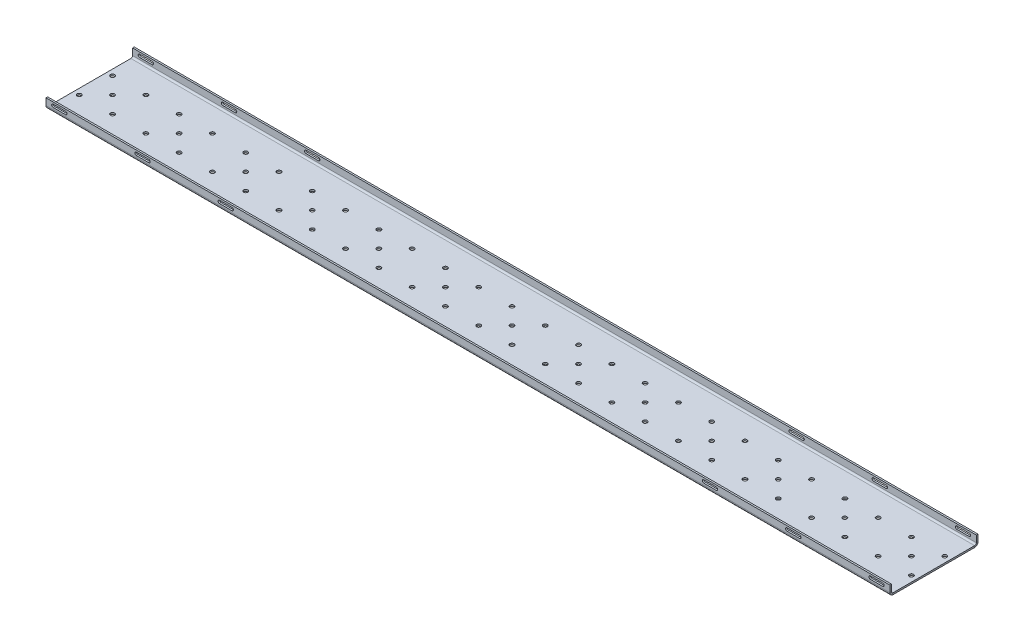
ISO-10303-21;
HEADER;
FILE_DESCRIPTION(('STEP AP214'),'2;1');
FILE_NAME('part.step','',(''),(''),'','','');
FILE_SCHEMA(('AUTOMOTIVE_DESIGN { 1 0 10303 214 1 1 1 1 }'));
ENDSEC;
DATA;
#1=APPLICATION_CONTEXT('core data for automotive mechanical design processes');
#2=APPLICATION_PROTOCOL_DEFINITION('international standard','automotive_design',2000,#1);
#3=PRODUCT_CONTEXT('',#1,'mechanical');
#4=PRODUCT('Part','Part','',(#3));
#5=PRODUCT_RELATED_PRODUCT_CATEGORY('part','',(#4));
#6=PRODUCT_DEFINITION_FORMATION('','',#4);
#7=PRODUCT_DEFINITION_CONTEXT('part definition',#1,'design');
#8=PRODUCT_DEFINITION('design','',#6,#7);
#9=PRODUCT_DEFINITION_SHAPE('','',#8);
#10=(LENGTH_UNIT() NAMED_UNIT(*) SI_UNIT(.MILLI.,.METRE.));
#11=(NAMED_UNIT(*) PLANE_ANGLE_UNIT() SI_UNIT($,.RADIAN.));
#12=(NAMED_UNIT(*) SI_UNIT($,.STERADIAN.) SOLID_ANGLE_UNIT());
#13=UNCERTAINTY_MEASURE_WITH_UNIT(LENGTH_MEASURE(1.E-05),#10,'distance_accuracy_value','');
#14=(GEOMETRIC_REPRESENTATION_CONTEXT(3) GLOBAL_UNCERTAINTY_ASSIGNED_CONTEXT((#13)) GLOBAL_UNIT_ASSIGNED_CONTEXT((#10,
#11,#12)) REPRESENTATION_CONTEXT('',''));
#15=CARTESIAN_POINT('',(0.,0.,0.));
#16=DIRECTION('',(0.,0.,1.));
#17=DIRECTION('',(1.,0.,0.));
#18=AXIS2_PLACEMENT_3D('',#15,#16,#17);
#19=CARTESIAN_POINT('',(0.,-2.,0.));
#20=DIRECTION('',(0.,-1.,0.));
#21=DIRECTION('',(0.,0.,-1.));
#22=AXIS2_PLACEMENT_3D('',#19,#20,#21);
#23=PLANE('',#22);
#24=CARTESIAN_POINT('',(-340.,-2.,-19.9999999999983));
#25=DIRECTION('',(0.,-1.,0.));
#26=DIRECTION('',(0.,0.,-1.));
#27=AXIS2_PLACEMENT_3D('',#24,#25,#26);
#28=CIRCLE('',#27,2.49999999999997);
#29=CARTESIAN_POINT('',(-340.,-2.,-22.4999999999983));
#30=VERTEX_POINT('',#29);
#31=EDGE_CURVE('E567',#30,#30,#28,.T.);
#32=ORIENTED_EDGE('',*,*,#31,.F.);
#33=EDGE_LOOP('',(#32));
#34=FACE_BOUND('',#33,.T.);
#35=CARTESIAN_POINT('',(-300.,-2.,-19.9999999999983));
#36=DIRECTION('',(0.,-1.,0.));
#37=DIRECTION('',(0.,0.,-1.));
#38=AXIS2_PLACEMENT_3D('',#35,#36,#37);
#39=CIRCLE('',#38,2.49999999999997);
#40=CARTESIAN_POINT('',(-300.,-2.,-22.4999999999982));
#41=VERTEX_POINT('',#40);
#42=EDGE_CURVE('E2786',#41,#41,#39,.T.);
#43=ORIENTED_EDGE('',*,*,#42,.F.);
#44=EDGE_LOOP('',(#43));
#45=FACE_BOUND('',#44,.T.);
#46=CARTESIAN_POINT('',(-340.,-2.,20.0000000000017));
#47=DIRECTION('',(0.,-1.,0.));
#48=DIRECTION('',(0.,0.,-1.));
#49=AXIS2_PLACEMENT_3D('',#46,#47,#48);
#50=CIRCLE('',#49,2.49999999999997);
#51=CARTESIAN_POINT('',(-340.,-2.,17.5000000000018));
#52=VERTEX_POINT('',#51);
#53=EDGE_CURVE('E2783',#52,#52,#50,.T.);
#54=ORIENTED_EDGE('',*,*,#53,.F.);
#55=EDGE_LOOP('',(#54));
#56=FACE_BOUND('',#55,.T.);
#57=CARTESIAN_POINT('',(-300.,-2.,20.0000000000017));
#58=DIRECTION('',(0.,-1.,0.));
#59=DIRECTION('',(0.,0.,-1.));
#60=AXIS2_PLACEMENT_3D('',#57,#58,#59);
#61=CIRCLE('',#60,2.49999999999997);
#62=CARTESIAN_POINT('',(-300.,-2.,17.5000000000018));
#63=VERTEX_POINT('',#62);
#64=EDGE_CURVE('E2780',#63,#63,#61,.T.);
#65=ORIENTED_EDGE('',*,*,#64,.F.);
#66=EDGE_LOOP('',(#65));
#67=FACE_BOUND('',#66,.T.);
#68=CARTESIAN_POINT('',(-420.,-2.,20.0000000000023));
#69=DIRECTION('',(0.,-1.,0.));
#70=DIRECTION('',(0.,0.,-1.));
#71=AXIS2_PLACEMENT_3D('',#68,#69,#70);
#72=CIRCLE('',#71,2.50000000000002);
#73=CARTESIAN_POINT('',(-420.,-2.,17.5000000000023));
#74=VERTEX_POINT('',#73);
#75=EDGE_CURVE('E2777',#74,#74,#72,.T.);
#76=ORIENTED_EDGE('',*,*,#75,.F.);
#77=EDGE_LOOP('',(#76));
#78=FACE_BOUND('',#77,.T.);
#79=CARTESIAN_POINT('',(-380.,-2.,-19.9999999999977));
#80=DIRECTION('',(0.,-1.,0.));
#81=DIRECTION('',(0.,0.,-1.));
#82=AXIS2_PLACEMENT_3D('',#79,#80,#81);
#83=CIRCLE('',#82,2.49999999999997);
#84=CARTESIAN_POINT('',(-380.,-2.,-22.4999999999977));
#85=VERTEX_POINT('',#84);
#86=EDGE_CURVE('E2774',#85,#85,#83,.T.);
#87=ORIENTED_EDGE('',*,*,#86,.F.);
#88=EDGE_LOOP('',(#87));
#89=FACE_BOUND('',#88,.T.);
#90=CARTESIAN_POINT('',(-420.,-2.,-19.9999999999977));
#91=DIRECTION('',(0.,-1.,0.));
#92=DIRECTION('',(0.,0.,-1.));
#93=AXIS2_PLACEMENT_3D('',#90,#91,#92);
#94=CIRCLE('',#93,2.50000000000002);
#95=CARTESIAN_POINT('',(-420.,-2.,-22.4999999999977));
#96=VERTEX_POINT('',#95);
#97=EDGE_CURVE('E2771',#96,#96,#94,.T.);
#98=ORIENTED_EDGE('',*,*,#97,.F.);
#99=EDGE_LOOP('',(#98));
#100=FACE_BOUND('',#99,.T.);
#101=CARTESIAN_POINT('',(-320.,-2.,1.71856058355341E-12));
#102=DIRECTION('',(0.,-1.,0.));
#103=DIRECTION('',(0.,0.,-1.));
#104=AXIS2_PLACEMENT_3D('',#101,#102,#103);
#105=CIRCLE('',#104,2.50000000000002);
#106=CARTESIAN_POINT('',(-320.,-2.,-2.4999999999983));
#107=VERTEX_POINT('',#106);
#108=EDGE_CURVE('E2768',#107,#107,#105,.T.);
#109=ORIENTED_EDGE('',*,*,#108,.F.);
#110=EDGE_LOOP('',(#109));
#111=FACE_BOUND('',#110,.T.);
#112=CARTESIAN_POINT('',(-180.,-2.,20.0000000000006));
#113=DIRECTION('',(0.,-1.,0.));
#114=DIRECTION('',(0.,0.,-1.));
#115=AXIS2_PLACEMENT_3D('',#112,#113,#114);
#116=CIRCLE('',#115,2.49999999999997);
#117=CARTESIAN_POINT('',(-180.,-2.,17.5000000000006));
#118=VERTEX_POINT('',#117);
#119=EDGE_CURVE('E2765',#118,#118,#116,.T.);
#120=ORIENTED_EDGE('',*,*,#119,.F.);
#121=EDGE_LOOP('',(#120));
#122=FACE_BOUND('',#121,.T.);
#123=CARTESIAN_POINT('',(-140.,-2.,20.0000000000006));
#124=DIRECTION('',(0.,-1.,0.));
#125=DIRECTION('',(0.,0.,-1.));
#126=AXIS2_PLACEMENT_3D('',#123,#124,#125);
#127=CIRCLE('',#126,2.49999999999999);
#128=CARTESIAN_POINT('',(-140.,-2.,17.5000000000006));
#129=VERTEX_POINT('',#128);
#130=EDGE_CURVE('E2762',#129,#129,#127,.T.);
#131=ORIENTED_EDGE('',*,*,#130,.F.);
#132=EDGE_LOOP('',(#131));
#133=FACE_BOUND('',#132,.T.);
#134=CARTESIAN_POINT('',(-160.,-2.,6.01286555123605E-13));
#135=DIRECTION('',(0.,-1.,0.));
#136=DIRECTION('',(0.,0.,-1.));
#137=AXIS2_PLACEMENT_3D('',#134,#135,#136);
#138=CIRCLE('',#137,2.5);
#139=CARTESIAN_POINT('',(-160.,-2.,-2.49999999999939));
#140=VERTEX_POINT('',#139);
#141=EDGE_CURVE('E2759',#140,#140,#138,.T.);
#142=ORIENTED_EDGE('',*,*,#141,.F.);
#143=EDGE_LOOP('',(#142));
#144=FACE_BOUND('',#143,.T.);
#145=CARTESIAN_POINT('',(-260.,-2.,-19.9999999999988));
#146=DIRECTION('',(0.,-1.,0.));
#147=DIRECTION('',(0.,0.,-1.));
#148=AXIS2_PLACEMENT_3D('',#145,#146,#147);
#149=CIRCLE('',#148,2.50000000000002);
#150=CARTESIAN_POINT('',(-260.,-2.,-22.4999999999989));
#151=VERTEX_POINT('',#150);
#152=EDGE_CURVE('E2756',#151,#151,#149,.T.);
#153=ORIENTED_EDGE('',*,*,#152,.F.);
#154=EDGE_LOOP('',(#153));
#155=FACE_BOUND('',#154,.T.);
#156=CARTESIAN_POINT('',(-240.,-2.,1.15992356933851E-12));
#157=DIRECTION('',(0.,-1.,0.));
#158=DIRECTION('',(0.,0.,-1.));
#159=AXIS2_PLACEMENT_3D('',#156,#157,#158);
#160=CIRCLE('',#159,2.5);
#161=CARTESIAN_POINT('',(-240.,-2.,-2.49999999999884));
#162=VERTEX_POINT('',#161);
#163=EDGE_CURVE('E2753',#162,#162,#160,.T.);
#164=ORIENTED_EDGE('',*,*,#163,.F.);
#165=EDGE_LOOP('',(#164));
#166=FACE_BOUND('',#165,.T.);
#167=CARTESIAN_POINT('',(-220.,-2.,20.0000000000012));
#168=DIRECTION('',(0.,-1.,0.));
#169=DIRECTION('',(0.,0.,-1.));
#170=AXIS2_PLACEMENT_3D('',#167,#168,#169);
#171=CIRCLE('',#170,2.49999999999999);
#172=CARTESIAN_POINT('',(-220.,-2.,17.5000000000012));
#173=VERTEX_POINT('',#172);
#174=EDGE_CURVE('E2750',#173,#173,#171,.T.);
#175=ORIENTED_EDGE('',*,*,#174,.F.);
#176=EDGE_LOOP('',(#175));
#177=FACE_BOUND('',#176,.T.);
#178=CARTESIAN_POINT('',(-260.,-2.,20.0000000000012));
#179=DIRECTION('',(0.,-1.,0.));
#180=DIRECTION('',(0.,0.,-1.));
#181=AXIS2_PLACEMENT_3D('',#178,#179,#180);
#182=CIRCLE('',#181,2.50000000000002);
#183=CARTESIAN_POINT('',(-260.,-2.,17.5000000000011));
#184=VERTEX_POINT('',#183);
#185=EDGE_CURVE('E2747',#184,#184,#182,.T.);
#186=ORIENTED_EDGE('',*,*,#185,.F.);
#187=EDGE_LOOP('',(#186));
#188=FACE_BOUND('',#187,.T.);
#189=CARTESIAN_POINT('',(-220.,-2.,-19.9999999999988));
#190=DIRECTION('',(0.,-1.,0.));
#191=DIRECTION('',(0.,0.,-1.));
#192=AXIS2_PLACEMENT_3D('',#189,#190,#191);
#193=CIRCLE('',#192,2.49999999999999);
#194=CARTESIAN_POINT('',(-220.,-2.,-22.4999999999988));
#195=VERTEX_POINT('',#194);
#196=EDGE_CURVE('E2744',#195,#195,#193,.T.);
#197=ORIENTED_EDGE('',*,*,#196,.F.);
#198=EDGE_LOOP('',(#197));
#199=FACE_BOUND('',#198,.T.);
#200=CARTESIAN_POINT('',(-20.,-2.,-20.));
#201=DIRECTION('',(0.,-1.,0.));
#202=DIRECTION('',(0.,0.,-1.));
#203=AXIS2_PLACEMENT_3D('',#200,#201,#202);
#204=CIRCLE('',#203,2.5);
#205=CARTESIAN_POINT('',(-20.,-2.,-22.5));
#206=VERTEX_POINT('',#205);
#207=EDGE_CURVE('E2741',#206,#206,#204,.T.);
#208=ORIENTED_EDGE('',*,*,#207,.F.);
#209=EDGE_LOOP('',(#208));
#210=FACE_BOUND('',#209,.T.);
#211=CARTESIAN_POINT('',(20.,-2.,-20.));
#212=DIRECTION('',(0.,-1.,0.));
#213=DIRECTION('',(0.,0.,-1.));
#214=AXIS2_PLACEMENT_3D('',#211,#212,#213);
#215=CIRCLE('',#214,2.5);
#216=CARTESIAN_POINT('',(20.,-2.,-22.5));
#217=VERTEX_POINT('',#216);
#218=EDGE_CURVE('E2738',#217,#217,#215,.T.);
#219=ORIENTED_EDGE('',*,*,#218,.F.);
#220=EDGE_LOOP('',(#219));
#221=FACE_BOUND('',#220,.T.);
#222=CARTESIAN_POINT('',(20.,-2.,20.));
#223=DIRECTION('',(0.,-1.,0.));
#224=DIRECTION('',(0.,0.,-1.));
#225=AXIS2_PLACEMENT_3D('',#222,#223,#224);
#226=CIRCLE('',#225,2.5);
#227=CARTESIAN_POINT('',(20.,-2.,17.5));
#228=VERTEX_POINT('',#227);
#229=EDGE_CURVE('E2735',#228,#228,#226,.T.);
#230=ORIENTED_EDGE('',*,*,#229,.F.);
#231=EDGE_LOOP('',(#230));
#232=FACE_BOUND('',#231,.T.);
#233=CARTESIAN_POINT('',(-20.,-2.,20.));
#234=DIRECTION('',(0.,-1.,0.));
#235=DIRECTION('',(0.,0.,-1.));
#236=AXIS2_PLACEMENT_3D('',#233,#234,#235);
#237=CIRCLE('',#236,2.5);
#238=CARTESIAN_POINT('',(-20.,-2.,17.5));
#239=VERTEX_POINT('',#238);
#240=EDGE_CURVE('E2732',#239,#239,#237,.T.);
#241=ORIENTED_EDGE('',*,*,#240,.F.);
#242=EDGE_LOOP('',(#241));
#243=FACE_BOUND('',#242,.T.);
#244=CARTESIAN_POINT('',(-100.,-2.,-20.));
#245=DIRECTION('',(0.,-1.,0.));
#246=DIRECTION('',(0.,0.,-1.));
#247=AXIS2_PLACEMENT_3D('',#244,#245,#246);
#248=CIRCLE('',#247,2.5);
#249=CARTESIAN_POINT('',(-100.,-2.,-22.5));
#250=VERTEX_POINT('',#249);
#251=EDGE_CURVE('E2729',#250,#250,#248,.T.);
#252=ORIENTED_EDGE('',*,*,#251,.F.);
#253=EDGE_LOOP('',(#252));
#254=FACE_BOUND('',#253,.T.);
#255=CARTESIAN_POINT('',(-60.,-2.,-20.));
#256=DIRECTION('',(0.,-1.,0.));
#257=DIRECTION('',(0.,0.,-1.));
#258=AXIS2_PLACEMENT_3D('',#255,#256,#257);
#259=CIRCLE('',#258,2.49999999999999);
#260=CARTESIAN_POINT('',(-60.,-2.,-22.5));
#261=VERTEX_POINT('',#260);
#262=EDGE_CURVE('E2726',#261,#261,#259,.T.);
#263=ORIENTED_EDGE('',*,*,#262,.F.);
#264=EDGE_LOOP('',(#263));
#265=FACE_BOUND('',#264,.T.);
#266=CARTESIAN_POINT('',(-100.,-2.,20.));
#267=DIRECTION('',(0.,-1.,0.));
#268=DIRECTION('',(0.,0.,-1.));
#269=AXIS2_PLACEMENT_3D('',#266,#267,#268);
#270=CIRCLE('',#269,2.5);
#271=CARTESIAN_POINT('',(-100.,-2.,17.5));
#272=VERTEX_POINT('',#271);
#273=EDGE_CURVE('E2723',#272,#272,#270,.T.);
#274=ORIENTED_EDGE('',*,*,#273,.F.);
#275=EDGE_LOOP('',(#274));
#276=FACE_BOUND('',#275,.T.);
#277=CARTESIAN_POINT('',(-60.,-2.,20.));
#278=DIRECTION('',(0.,-1.,0.));
#279=DIRECTION('',(0.,0.,-1.));
#280=AXIS2_PLACEMENT_3D('',#277,#278,#279);
#281=CIRCLE('',#280,2.49999999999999);
#282=CARTESIAN_POINT('',(-60.,-2.,17.5));
#283=VERTEX_POINT('',#282);
#284=EDGE_CURVE('E2720',#283,#283,#281,.T.);
#285=ORIENTED_EDGE('',*,*,#284,.F.);
#286=EDGE_LOOP('',(#285));
#287=FACE_BOUND('',#286,.T.);
#288=CARTESIAN_POINT('',(-80.,-2.,0.));
#289=DIRECTION('',(0.,-1.,0.));
#290=DIRECTION('',(0.,0.,-1.));
#291=AXIS2_PLACEMENT_3D('',#288,#289,#290);
#292=CIRCLE('',#291,2.50000000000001);
#293=CARTESIAN_POINT('',(-80.,-2.,-2.49999999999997));
#294=VERTEX_POINT('',#293);
#295=EDGE_CURVE('E2717',#294,#294,#292,.T.);
#296=ORIENTED_EDGE('',*,*,#295,.F.);
#297=EDGE_LOOP('',(#296));
#298=FACE_BOUND('',#297,.T.);
#299=CARTESIAN_POINT('',(80.,-2.,0.));
#300=DIRECTION('',(0.,-1.,0.));
#301=DIRECTION('',(0.,0.,-1.));
#302=AXIS2_PLACEMENT_3D('',#299,#300,#301);
#303=CIRCLE('',#302,2.50000000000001);
#304=CARTESIAN_POINT('',(80.,-2.,-2.49999999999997));
#305=VERTEX_POINT('',#304);
#306=EDGE_CURVE('E2714',#305,#305,#303,.T.);
#307=ORIENTED_EDGE('',*,*,#306,.F.);
#308=EDGE_LOOP('',(#307));
#309=FACE_BOUND('',#308,.T.);
#310=CARTESIAN_POINT('',(60.,-2.,20.));
#311=DIRECTION('',(0.,-1.,0.));
#312=DIRECTION('',(0.,0.,-1.));
#313=AXIS2_PLACEMENT_3D('',#310,#311,#312);
#314=CIRCLE('',#313,2.49999999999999);
#315=CARTESIAN_POINT('',(60.,-2.,17.5));
#316=VERTEX_POINT('',#315);
#317=EDGE_CURVE('E2711',#316,#316,#314,.T.);
#318=ORIENTED_EDGE('',*,*,#317,.F.);
#319=EDGE_LOOP('',(#318));
#320=FACE_BOUND('',#319,.T.);
#321=CARTESIAN_POINT('',(100.,-2.,20.));
#322=DIRECTION('',(0.,-1.,0.));
#323=DIRECTION('',(0.,0.,-1.));
#324=AXIS2_PLACEMENT_3D('',#321,#322,#323);
#325=CIRCLE('',#324,2.5);
#326=CARTESIAN_POINT('',(100.,-2.,17.5));
#327=VERTEX_POINT('',#326);
#328=EDGE_CURVE('E2708',#327,#327,#325,.T.);
#329=ORIENTED_EDGE('',*,*,#328,.F.);
#330=EDGE_LOOP('',(#329));
#331=FACE_BOUND('',#330,.T.);
#332=CARTESIAN_POINT('',(60.,-2.,-20.));
#333=DIRECTION('',(0.,-1.,0.));
#334=DIRECTION('',(0.,0.,-1.));
#335=AXIS2_PLACEMENT_3D('',#332,#333,#334);
#336=CIRCLE('',#335,2.49999999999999);
#337=CARTESIAN_POINT('',(60.,-2.,-22.5));
#338=VERTEX_POINT('',#337);
#339=EDGE_CURVE('E2705',#338,#338,#336,.T.);
#340=ORIENTED_EDGE('',*,*,#339,.F.);
#341=EDGE_LOOP('',(#340));
#342=FACE_BOUND('',#341,.T.);
#343=CARTESIAN_POINT('',(100.,-2.,-20.));
#344=DIRECTION('',(0.,-1.,0.));
#345=DIRECTION('',(0.,0.,-1.));
#346=AXIS2_PLACEMENT_3D('',#343,#344,#345);
#347=CIRCLE('',#346,2.5);
#348=CARTESIAN_POINT('',(100.,-2.,-22.5));
#349=VERTEX_POINT('',#348);
#350=EDGE_CURVE('E2702',#349,#349,#347,.T.);
#351=ORIENTED_EDGE('',*,*,#350,.F.);
#352=EDGE_LOOP('',(#351));
#353=FACE_BOUND('',#352,.T.);
#354=CARTESIAN_POINT('',(-180.,-2.,-19.9999999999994));
#355=DIRECTION('',(0.,-1.,0.));
#356=DIRECTION('',(0.,0.,-1.));
#357=AXIS2_PLACEMENT_3D('',#354,#355,#356);
#358=CIRCLE('',#357,2.49999999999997);
#359=CARTESIAN_POINT('',(-180.,-2.,-22.4999999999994));
#360=VERTEX_POINT('',#359);
#361=EDGE_CURVE('E2699',#360,#360,#358,.T.);
#362=ORIENTED_EDGE('',*,*,#361,.F.);
#363=EDGE_LOOP('',(#362));
#364=FACE_BOUND('',#363,.T.);
#365=CARTESIAN_POINT('',(-140.,-2.,-19.9999999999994));
#366=DIRECTION('',(0.,-1.,0.));
#367=DIRECTION('',(0.,0.,-1.));
#368=AXIS2_PLACEMENT_3D('',#365,#366,#367);
#369=CIRCLE('',#368,2.49999999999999);
#370=CARTESIAN_POINT('',(-140.,-2.,-22.4999999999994));
#371=VERTEX_POINT('',#370);
#372=EDGE_CURVE('E2696',#371,#371,#369,.T.);
#373=ORIENTED_EDGE('',*,*,#372,.F.);
#374=EDGE_LOOP('',(#373));
#375=FACE_BOUND('',#374,.T.);
#376=CARTESIAN_POINT('',(220.,-2.,20.0000000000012));
#377=DIRECTION('',(0.,-1.,0.));
#378=DIRECTION('',(0.,0.,-1.));
#379=AXIS2_PLACEMENT_3D('',#376,#377,#378);
#380=CIRCLE('',#379,2.49999999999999);
#381=CARTESIAN_POINT('',(220.,-2.,17.5000000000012));
#382=VERTEX_POINT('',#381);
#383=EDGE_CURVE('E2693',#382,#382,#380,.T.);
#384=ORIENTED_EDGE('',*,*,#383,.F.);
#385=EDGE_LOOP('',(#384));
#386=FACE_BOUND('',#385,.T.);
#387=CARTESIAN_POINT('',(240.,-2.,1.15992356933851E-12));
#388=DIRECTION('',(0.,-1.,0.));
#389=DIRECTION('',(0.,0.,-1.));
#390=AXIS2_PLACEMENT_3D('',#387,#388,#389);
#391=CIRCLE('',#390,2.5);
#392=CARTESIAN_POINT('',(240.,-2.,-2.49999999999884));
#393=VERTEX_POINT('',#392);
#394=EDGE_CURVE('E2690',#393,#393,#391,.T.);
#395=ORIENTED_EDGE('',*,*,#394,.F.);
#396=EDGE_LOOP('',(#395));
#397=FACE_BOUND('',#396,.T.);
#398=CARTESIAN_POINT('',(340.,-2.,-19.9999999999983));
#399=DIRECTION('',(0.,-1.,0.));
#400=DIRECTION('',(0.,0.,-1.));
#401=AXIS2_PLACEMENT_3D('',#398,#399,#400);
#402=CIRCLE('',#401,2.49999999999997);
#403=CARTESIAN_POINT('',(340.,-2.,-22.4999999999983));
#404=VERTEX_POINT('',#403);
#405=EDGE_CURVE('E2687',#404,#404,#402,.T.);
#406=ORIENTED_EDGE('',*,*,#405,.F.);
#407=EDGE_LOOP('',(#406));
#408=FACE_BOUND('',#407,.T.);
#409=CARTESIAN_POINT('',(300.,-2.,-19.9999999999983));
#410=DIRECTION('',(0.,-1.,0.));
#411=DIRECTION('',(0.,0.,-1.));
#412=AXIS2_PLACEMENT_3D('',#409,#410,#411);
#413=CIRCLE('',#412,2.49999999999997);
#414=CARTESIAN_POINT('',(300.,-2.,-22.4999999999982));
#415=VERTEX_POINT('',#414);
#416=EDGE_CURVE('E2684',#415,#415,#413,.T.);
#417=ORIENTED_EDGE('',*,*,#416,.F.);
#418=EDGE_LOOP('',(#417));
#419=FACE_BOUND('',#418,.T.);
#420=CARTESIAN_POINT('',(340.,-2.,20.0000000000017));
#421=DIRECTION('',(0.,-1.,0.));
#422=DIRECTION('',(0.,0.,-1.));
#423=AXIS2_PLACEMENT_3D('',#420,#421,#422);
#424=CIRCLE('',#423,2.49999999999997);
#425=CARTESIAN_POINT('',(340.,-2.,17.5000000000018));
#426=VERTEX_POINT('',#425);
#427=EDGE_CURVE('E2681',#426,#426,#424,.T.);
#428=ORIENTED_EDGE('',*,*,#427,.F.);
#429=EDGE_LOOP('',(#428));
#430=FACE_BOUND('',#429,.T.);
#431=CARTESIAN_POINT('',(300.,-2.,20.0000000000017));
#432=DIRECTION('',(0.,-1.,0.));
#433=DIRECTION('',(0.,0.,-1.));
#434=AXIS2_PLACEMENT_3D('',#431,#432,#433);
#435=CIRCLE('',#434,2.49999999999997);
#436=CARTESIAN_POINT('',(300.,-2.,17.5000000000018));
#437=VERTEX_POINT('',#436);
#438=EDGE_CURVE('E2678',#437,#437,#435,.T.);
#439=ORIENTED_EDGE('',*,*,#438,.F.);
#440=EDGE_LOOP('',(#439));
#441=FACE_BOUND('',#440,.T.);
#442=CARTESIAN_POINT('',(320.,-2.,1.71856058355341E-12));
#443=DIRECTION('',(0.,-1.,0.));
#444=DIRECTION('',(0.,0.,-1.));
#445=AXIS2_PLACEMENT_3D('',#442,#443,#444);
#446=CIRCLE('',#445,2.50000000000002);
#447=CARTESIAN_POINT('',(320.,-2.,-2.4999999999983));
#448=VERTEX_POINT('',#447);
#449=EDGE_CURVE('E2675',#448,#448,#446,.T.);
#450=ORIENTED_EDGE('',*,*,#449,.F.);
#451=EDGE_LOOP('',(#450));
#452=FACE_BOUND('',#451,.T.);
#453=CARTESIAN_POINT('',(420.,-2.,-19.9999999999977));
#454=DIRECTION('',(0.,-1.,0.));
#455=DIRECTION('',(0.,0.,-1.));
#456=AXIS2_PLACEMENT_3D('',#453,#454,#455);
#457=CIRCLE('',#456,2.50000000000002);
#458=CARTESIAN_POINT('',(420.,-2.,-22.4999999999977));
#459=VERTEX_POINT('',#458);
#460=EDGE_CURVE('E2672',#459,#459,#457,.T.);
#461=ORIENTED_EDGE('',*,*,#460,.F.);
#462=EDGE_LOOP('',(#461));
#463=FACE_BOUND('',#462,.T.);
#464=CARTESIAN_POINT('',(180.,-2.,-19.9999999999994));
#465=DIRECTION('',(0.,-1.,0.));
#466=DIRECTION('',(0.,0.,-1.));
#467=AXIS2_PLACEMENT_3D('',#464,#465,#466);
#468=CIRCLE('',#467,2.49999999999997);
#469=CARTESIAN_POINT('',(180.,-2.,-22.4999999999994));
#470=VERTEX_POINT('',#469);
#471=EDGE_CURVE('E2669',#470,#470,#468,.T.);
#472=ORIENTED_EDGE('',*,*,#471,.F.);
#473=EDGE_LOOP('',(#472));
#474=FACE_BOUND('',#473,.T.);
#475=CARTESIAN_POINT('',(140.,-2.,-19.9999999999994));
#476=DIRECTION('',(0.,-1.,0.));
#477=DIRECTION('',(0.,0.,-1.));
#478=AXIS2_PLACEMENT_3D('',#475,#476,#477);
#479=CIRCLE('',#478,2.49999999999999);
#480=CARTESIAN_POINT('',(140.,-2.,-22.4999999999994));
#481=VERTEX_POINT('',#480);
#482=EDGE_CURVE('E2666',#481,#481,#479,.T.);
#483=ORIENTED_EDGE('',*,*,#482,.F.);
#484=EDGE_LOOP('',(#483));
#485=FACE_BOUND('',#484,.T.);
#486=CARTESIAN_POINT('',(180.,-2.,20.0000000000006));
#487=DIRECTION('',(0.,-1.,0.));
#488=DIRECTION('',(0.,0.,-1.));
#489=AXIS2_PLACEMENT_3D('',#486,#487,#488);
#490=CIRCLE('',#489,2.49999999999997);
#491=CARTESIAN_POINT('',(180.,-2.,17.5000000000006));
#492=VERTEX_POINT('',#491);
#493=EDGE_CURVE('E2663',#492,#492,#490,.T.);
#494=ORIENTED_EDGE('',*,*,#493,.F.);
#495=EDGE_LOOP('',(#494));
#496=FACE_BOUND('',#495,.T.);
#497=CARTESIAN_POINT('',(140.,-2.,20.0000000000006));
#498=DIRECTION('',(0.,-1.,0.));
#499=DIRECTION('',(0.,0.,-1.));
#500=AXIS2_PLACEMENT_3D('',#497,#498,#499);
#501=CIRCLE('',#500,2.49999999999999);
#502=CARTESIAN_POINT('',(140.,-2.,17.5000000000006));
#503=VERTEX_POINT('',#502);
#504=EDGE_CURVE('E2660',#503,#503,#501,.T.);
#505=ORIENTED_EDGE('',*,*,#504,.F.);
#506=EDGE_LOOP('',(#505));
#507=FACE_BOUND('',#506,.T.);
#508=CARTESIAN_POINT('',(260.,-2.,20.0000000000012));
#509=DIRECTION('',(0.,-1.,0.));
#510=DIRECTION('',(0.,0.,-1.));
#511=AXIS2_PLACEMENT_3D('',#508,#509,#510);
#512=CIRCLE('',#511,2.50000000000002);
#513=CARTESIAN_POINT('',(260.,-2.,17.5000000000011));
#514=VERTEX_POINT('',#513);
#515=EDGE_CURVE('E2657',#514,#514,#512,.T.);
#516=ORIENTED_EDGE('',*,*,#515,.F.);
#517=EDGE_LOOP('',(#516));
#518=FACE_BOUND('',#517,.T.);
#519=CARTESIAN_POINT('',(220.,-2.,-19.9999999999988));
#520=DIRECTION('',(0.,-1.,0.));
#521=DIRECTION('',(0.,0.,-1.));
#522=AXIS2_PLACEMENT_3D('',#519,#520,#521);
#523=CIRCLE('',#522,2.49999999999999);
#524=CARTESIAN_POINT('',(220.,-2.,-22.4999999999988));
#525=VERTEX_POINT('',#524);
#526=EDGE_CURVE('E2654',#525,#525,#523,.T.);
#527=ORIENTED_EDGE('',*,*,#526,.F.);
#528=EDGE_LOOP('',(#527));
#529=FACE_BOUND('',#528,.T.);
#530=CARTESIAN_POINT('',(260.,-2.,-19.9999999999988));
#531=DIRECTION('',(0.,-1.,0.));
#532=DIRECTION('',(0.,0.,-1.));
#533=AXIS2_PLACEMENT_3D('',#530,#531,#532);
#534=CIRCLE('',#533,2.50000000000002);
#535=CARTESIAN_POINT('',(260.,-2.,-22.4999999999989));
#536=VERTEX_POINT('',#535);
#537=EDGE_CURVE('E2651',#536,#536,#534,.T.);
#538=ORIENTED_EDGE('',*,*,#537,.F.);
#539=EDGE_LOOP('',(#538));
#540=FACE_BOUND('',#539,.T.);
#541=CARTESIAN_POINT('',(160.,-2.,6.01286555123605E-13));
#542=DIRECTION('',(0.,-1.,0.));
#543=DIRECTION('',(0.,0.,-1.));
#544=AXIS2_PLACEMENT_3D('',#541,#542,#543);
#545=CIRCLE('',#544,2.5);
#546=CARTESIAN_POINT('',(160.,-2.,-2.49999999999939));
#547=VERTEX_POINT('',#546);
#548=EDGE_CURVE('E2648',#547,#547,#545,.T.);
#549=ORIENTED_EDGE('',*,*,#548,.F.);
#550=EDGE_LOOP('',(#549));
#551=FACE_BOUND('',#550,.T.);
#552=CARTESIAN_POINT('',(480.,-2.,2.83583461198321E-12));
#553=DIRECTION('',(0.,-1.,0.));
#554=DIRECTION('',(0.,0.,-1.));
#555=AXIS2_PLACEMENT_3D('',#552,#553,#554);
#556=CIRCLE('',#555,2.50000000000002);
#557=CARTESIAN_POINT('',(480.,-2.,-2.49999999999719));
#558=VERTEX_POINT('',#557);
#559=EDGE_CURVE('E2645',#558,#558,#556,.T.);
#560=ORIENTED_EDGE('',*,*,#559,.F.);
#561=EDGE_LOOP('',(#560));
#562=FACE_BOUND('',#561,.T.);
#563=CARTESIAN_POINT('',(-480.,-2.,2.83583461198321E-12));
#564=DIRECTION('',(0.,-1.,0.));
#565=DIRECTION('',(0.,0.,-1.));
#566=AXIS2_PLACEMENT_3D('',#563,#564,#565);
#567=CIRCLE('',#566,2.50000000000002);
#568=CARTESIAN_POINT('',(-480.,-2.,-2.49999999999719));
#569=VERTEX_POINT('',#568);
#570=EDGE_CURVE('E2642',#569,#569,#567,.T.);
#571=ORIENTED_EDGE('',*,*,#570,.F.);
#572=EDGE_LOOP('',(#571));
#573=FACE_BOUND('',#572,.T.);
#574=CARTESIAN_POINT('',(-460.,-2.,20.0000000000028));
#575=DIRECTION('',(0.,-1.,0.));
#576=DIRECTION('',(0.,0.,-1.));
#577=AXIS2_PLACEMENT_3D('',#574,#575,#576);
#578=CIRCLE('',#577,2.49999999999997);
#579=CARTESIAN_POINT('',(-460.,-2.,17.5000000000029));
#580=VERTEX_POINT('',#579);
#581=EDGE_CURVE('E2639',#580,#580,#578,.T.);
#582=ORIENTED_EDGE('',*,*,#581,.F.);
#583=EDGE_LOOP('',(#582));
#584=FACE_BOUND('',#583,.T.);
#585=CARTESIAN_POINT('',(-500.,-2.,20.0000000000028));
#586=DIRECTION('',(0.,-1.,0.));
#587=DIRECTION('',(0.,0.,-1.));
#588=AXIS2_PLACEMENT_3D('',#585,#586,#587);
#589=CIRCLE('',#588,2.49999999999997);
#590=CARTESIAN_POINT('',(-500.,-2.,17.5000000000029));
#591=VERTEX_POINT('',#590);
#592=EDGE_CURVE('E2636',#591,#591,#589,.T.);
#593=ORIENTED_EDGE('',*,*,#592,.F.);
#594=EDGE_LOOP('',(#593));
#595=FACE_BOUND('',#594,.T.);
#596=CARTESIAN_POINT('',(-460.,-2.,-19.9999999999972));
#597=DIRECTION('',(0.,-1.,0.));
#598=DIRECTION('',(0.,0.,-1.));
#599=AXIS2_PLACEMENT_3D('',#596,#597,#598);
#600=CIRCLE('',#599,2.49999999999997);
#601=CARTESIAN_POINT('',(-460.,-2.,-22.4999999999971));
#602=VERTEX_POINT('',#601);
#603=EDGE_CURVE('E2633',#602,#602,#600,.T.);
#604=ORIENTED_EDGE('',*,*,#603,.F.);
#605=EDGE_LOOP('',(#604));
#606=FACE_BOUND('',#605,.T.);
#607=CARTESIAN_POINT('',(-500.,-2.,-19.9999999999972));
#608=DIRECTION('',(0.,-1.,0.));
#609=DIRECTION('',(0.,0.,-1.));
#610=AXIS2_PLACEMENT_3D('',#607,#608,#609);
#611=CIRCLE('',#610,2.49999999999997);
#612=CARTESIAN_POINT('',(-500.,-2.,-22.4999999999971));
#613=VERTEX_POINT('',#612);
#614=EDGE_CURVE('E2630',#613,#613,#611,.T.);
#615=ORIENTED_EDGE('',*,*,#614,.F.);
#616=EDGE_LOOP('',(#615));
#617=FACE_BOUND('',#616,.T.);
#618=CARTESIAN_POINT('',(-400.,-2.,2.27719759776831E-12));
#619=DIRECTION('',(0.,-1.,0.));
#620=DIRECTION('',(0.,0.,-1.));
#621=AXIS2_PLACEMENT_3D('',#618,#619,#620);
#622=CIRCLE('',#621,2.50000000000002);
#623=CARTESIAN_POINT('',(-400.,-2.,-2.49999999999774));
#624=VERTEX_POINT('',#623);
#625=EDGE_CURVE('E2627',#624,#624,#622,.T.);
#626=ORIENTED_EDGE('',*,*,#625,.F.);
#627=EDGE_LOOP('',(#626));
#628=FACE_BOUND('',#627,.T.);
#629=CARTESIAN_POINT('',(-380.,-2.,20.0000000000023));
#630=DIRECTION('',(0.,-1.,0.));
#631=DIRECTION('',(0.,0.,-1.));
#632=AXIS2_PLACEMENT_3D('',#629,#630,#631);
#633=CIRCLE('',#632,2.49999999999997);
#634=CARTESIAN_POINT('',(-380.,-2.,17.5000000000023));
#635=VERTEX_POINT('',#634);
#636=EDGE_CURVE('E2624',#635,#635,#633,.T.);
#637=ORIENTED_EDGE('',*,*,#636,.F.);
#638=EDGE_LOOP('',(#637));
#639=FACE_BOUND('',#638,.T.);
#640=CARTESIAN_POINT('',(460.,-2.,20.0000000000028));
#641=DIRECTION('',(0.,-1.,0.));
#642=DIRECTION('',(0.,0.,-1.));
#643=AXIS2_PLACEMENT_3D('',#640,#641,#642);
#644=CIRCLE('',#643,2.49999999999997);
#645=CARTESIAN_POINT('',(460.,-2.,17.5000000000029));
#646=VERTEX_POINT('',#645);
#647=EDGE_CURVE('E2621',#646,#646,#644,.T.);
#648=ORIENTED_EDGE('',*,*,#647,.F.);
#649=EDGE_LOOP('',(#648));
#650=FACE_BOUND('',#649,.T.);
#651=CARTESIAN_POINT('',(500.,-2.,20.0000000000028));
#652=DIRECTION('',(0.,-1.,0.));
#653=DIRECTION('',(0.,0.,-1.));
#654=AXIS2_PLACEMENT_3D('',#651,#652,#653);
#655=CIRCLE('',#654,2.49999999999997);
#656=CARTESIAN_POINT('',(500.,-2.,17.5000000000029));
#657=VERTEX_POINT('',#656);
#658=EDGE_CURVE('E2618',#657,#657,#655,.T.);
#659=ORIENTED_EDGE('',*,*,#658,.F.);
#660=EDGE_LOOP('',(#659));
#661=FACE_BOUND('',#660,.T.);
#662=CARTESIAN_POINT('',(460.,-2.,-19.9999999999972));
#663=DIRECTION('',(0.,-1.,0.));
#664=DIRECTION('',(0.,0.,-1.));
#665=AXIS2_PLACEMENT_3D('',#662,#663,#664);
#666=CIRCLE('',#665,2.49999999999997);
#667=CARTESIAN_POINT('',(460.,-2.,-22.4999999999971));
#668=VERTEX_POINT('',#667);
#669=EDGE_CURVE('E2615',#668,#668,#666,.T.);
#670=ORIENTED_EDGE('',*,*,#669,.F.);
#671=EDGE_LOOP('',(#670));
#672=FACE_BOUND('',#671,.T.);
#673=CARTESIAN_POINT('',(500.,-2.,-19.9999999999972));
#674=DIRECTION('',(0.,-1.,0.));
#675=DIRECTION('',(0.,0.,-1.));
#676=AXIS2_PLACEMENT_3D('',#673,#674,#675);
#677=CIRCLE('',#676,2.49999999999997);
#678=CARTESIAN_POINT('',(500.,-2.,-22.4999999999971));
#679=VERTEX_POINT('',#678);
#680=EDGE_CURVE('E2612',#679,#679,#677,.T.);
#681=ORIENTED_EDGE('',*,*,#680,.F.);
#682=EDGE_LOOP('',(#681));
#683=FACE_BOUND('',#682,.T.);
#684=CARTESIAN_POINT('',(380.,-2.,-19.9999999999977));
#685=DIRECTION('',(0.,-1.,0.));
#686=DIRECTION('',(0.,0.,-1.));
#687=AXIS2_PLACEMENT_3D('',#684,#685,#686);
#688=CIRCLE('',#687,2.49999999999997);
#689=CARTESIAN_POINT('',(380.,-2.,-22.4999999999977));
#690=VERTEX_POINT('',#689);
#691=EDGE_CURVE('E2609',#690,#690,#688,.T.);
#692=ORIENTED_EDGE('',*,*,#691,.F.);
#693=EDGE_LOOP('',(#692));
#694=FACE_BOUND('',#693,.T.);
#695=CARTESIAN_POINT('',(420.,-2.,20.0000000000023));
#696=DIRECTION('',(0.,-1.,0.));
#697=DIRECTION('',(0.,0.,-1.));
#698=AXIS2_PLACEMENT_3D('',#695,#696,#697);
#699=CIRCLE('',#698,2.50000000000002);
#700=CARTESIAN_POINT('',(420.,-2.,17.5000000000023));
#701=VERTEX_POINT('',#700);
#702=EDGE_CURVE('E2606',#701,#701,#699,.T.);
#703=ORIENTED_EDGE('',*,*,#702,.F.);
#704=EDGE_LOOP('',(#703));
#705=FACE_BOUND('',#704,.T.);
#706=CARTESIAN_POINT('',(380.,-2.,20.0000000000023));
#707=DIRECTION('',(0.,-1.,0.));
#708=DIRECTION('',(0.,0.,-1.));
#709=AXIS2_PLACEMENT_3D('',#706,#707,#708);
#710=CIRCLE('',#709,2.49999999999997);
#711=CARTESIAN_POINT('',(380.,-2.,17.5000000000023));
#712=VERTEX_POINT('',#711);
#713=EDGE_CURVE('E2603',#712,#712,#710,.T.);
#714=ORIENTED_EDGE('',*,*,#713,.F.);
#715=EDGE_LOOP('',(#714));
#716=FACE_BOUND('',#715,.T.);
#717=CARTESIAN_POINT('',(400.,-2.,2.27719759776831E-12));
#718=DIRECTION('',(0.,-1.,0.));
#719=DIRECTION('',(0.,0.,-1.));
#720=AXIS2_PLACEMENT_3D('',#717,#718,#719);
#721=CIRCLE('',#720,2.50000000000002);
#722=CARTESIAN_POINT('',(400.,-2.,-2.49999999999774));
#723=VERTEX_POINT('',#722);
#724=EDGE_CURVE('E2600',#723,#723,#721,.T.);
#725=ORIENTED_EDGE('',*,*,#724,.F.);
#726=EDGE_LOOP('',(#725));
#727=FACE_BOUND('',#726,.T.);
#728=CARTESIAN_POINT('',(0.,-2.,0.));
#729=DIRECTION('',(0.,-1.,0.));
#730=DIRECTION('',(0.,0.,-1.));
#731=AXIS2_PLACEMENT_3D('',#728,#729,#730);
#732=CIRCLE('',#731,2.5);
#733=CARTESIAN_POINT('',(0.,-2.,-2.5));
#734=VERTEX_POINT('',#733);
#735=EDGE_CURVE('E2597',#734,#734,#732,.T.);
#736=ORIENTED_EDGE('',*,*,#735,.F.);
#737=EDGE_LOOP('',(#736));
#738=FACE_BOUND('',#737,.T.);
#739=DIRECTION('',(0.,0.,1.));
#740=VECTOR('',#739,1.);
#741=CARTESIAN_POINT('',(-507.,-2.,51.));
#742=LINE('',#741,#740);
#743=CARTESIAN_POINT('',(-507.,-2.00000000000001,-49.));
#744=VERTEX_POINT('',#743);
#745=CARTESIAN_POINT('',(-507.,-2.,49.));
#746=VERTEX_POINT('',#745);
#747=EDGE_CURVE('E822',#744,#746,#742,.T.);
#748=ORIENTED_EDGE('',*,*,#747,.F.);
#749=DIRECTION('',(-1.,0.,0.));
#750=VECTOR('',#749,1.);
#751=CARTESIAN_POINT('',(-507.,-2.00000000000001,-49.));
#752=LINE('',#751,#750);
#753=CARTESIAN_POINT('',(507.,-2.,-49.));
#754=VERTEX_POINT('',#753);
#755=EDGE_CURVE('E743',#744,#754,#752,.F.);
#756=ORIENTED_EDGE('',*,*,#755,.T.);
#757=DIRECTION('',(0.,0.,-1.));
#758=VECTOR('',#757,1.);
#759=CARTESIAN_POINT('',(507.,-2.,51.));
#760=LINE('',#759,#758);
#761=CARTESIAN_POINT('',(507.,-2.00000000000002,49.));
#762=VERTEX_POINT('',#761);
#763=EDGE_CURVE('E819',#762,#754,#760,.T.);
#764=ORIENTED_EDGE('',*,*,#763,.F.);
#765=DIRECTION('',(1.,0.,0.));
#766=VECTOR('',#765,1.);
#767=CARTESIAN_POINT('',(507.,-2.00000000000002,49.));
#768=LINE('',#767,#766);
#769=EDGE_CURVE('E796',#762,#746,#768,.F.);
#770=ORIENTED_EDGE('',*,*,#769,.T.);
#771=EDGE_LOOP('',(#748,#756,#764,#770));
#772=FACE_BOUND('',#771,.T.);
#773=ADVANCED_FACE('F55',(#34,#45,#56,#67,#78,#89,#100,#111,#122,#133,#144,#155,#166,#177,#188,
#199,#210,#221,#232,#243,#254,#265,#276,#287,#298,#309,#320,#331,#342,#353,#364,#375,#386,#397,
#408,#419,#430,#441,#452,#463,#474,#485,#496,#507,#518,#529,#540,#551,#562,#573,#584,#595,#606,
#617,#628,#639,#650,#661,#672,#683,#694,#705,#716,#727,#738,#772),#23,.T.);
#774=CARTESIAN_POINT('',(0.,0.,0.));
#775=DIRECTION('',(0.,-1.,0.));
#776=DIRECTION('',(0.,0.,-1.));
#777=AXIS2_PLACEMENT_3D('',#774,#775,#776);
#778=PLANE('',#777);
#779=CARTESIAN_POINT('',(-340.,0.,-19.9999999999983));
#780=DIRECTION('',(0.,1.,0.));
#781=DIRECTION('',(0.,0.,1.));
#782=AXIS2_PLACEMENT_3D('',#779,#780,#781);
#783=CIRCLE('',#782,2.49999999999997);
#784=CARTESIAN_POINT('',(-340.,0.,-17.4999999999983));
#785=VERTEX_POINT('',#784);
#786=EDGE_CURVE('E2525',#785,#785,#783,.T.);
#787=ORIENTED_EDGE('',*,*,#786,.F.);
#788=EDGE_LOOP('',(#787));
#789=FACE_BOUND('',#788,.T.);
#790=CARTESIAN_POINT('',(-300.,0.,-19.9999999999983));
#791=DIRECTION('',(0.,1.,0.));
#792=DIRECTION('',(0.,0.,1.));
#793=AXIS2_PLACEMENT_3D('',#790,#791,#792);
#794=CIRCLE('',#793,2.49999999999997);
#795=CARTESIAN_POINT('',(-300.,0.,-17.4999999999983));
#796=VERTEX_POINT('',#795);
#797=EDGE_CURVE('E2527',#796,#796,#794,.T.);
#798=ORIENTED_EDGE('',*,*,#797,.F.);
#799=EDGE_LOOP('',(#798));
#800=FACE_BOUND('',#799,.T.);
#801=CARTESIAN_POINT('',(-340.,0.,20.0000000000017));
#802=DIRECTION('',(0.,1.,0.));
#803=DIRECTION('',(0.,0.,1.));
#804=AXIS2_PLACEMENT_3D('',#801,#802,#803);
#805=CIRCLE('',#804,2.49999999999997);
#806=CARTESIAN_POINT('',(-340.,0.,22.5000000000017));
#807=VERTEX_POINT('',#806);
#808=EDGE_CURVE('E2533',#807,#807,#805,.T.);
#809=ORIENTED_EDGE('',*,*,#808,.F.);
#810=EDGE_LOOP('',(#809));
#811=FACE_BOUND('',#810,.T.);
#812=CARTESIAN_POINT('',(-300.,0.,20.0000000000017));
#813=DIRECTION('',(0.,1.,0.));
#814=DIRECTION('',(0.,0.,1.));
#815=AXIS2_PLACEMENT_3D('',#812,#813,#814);
#816=CIRCLE('',#815,2.49999999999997);
#817=CARTESIAN_POINT('',(-300.,0.,22.5000000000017));
#818=VERTEX_POINT('',#817);
#819=EDGE_CURVE('E2541',#818,#818,#816,.T.);
#820=ORIENTED_EDGE('',*,*,#819,.F.);
#821=EDGE_LOOP('',(#820));
#822=FACE_BOUND('',#821,.T.);
#823=CARTESIAN_POINT('',(-420.,0.,20.0000000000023));
#824=DIRECTION('',(0.,1.,0.));
#825=DIRECTION('',(0.,0.,1.));
#826=AXIS2_PLACEMENT_3D('',#823,#824,#825);
#827=CIRCLE('',#826,2.50000000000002);
#828=CARTESIAN_POINT('',(-420.,0.,22.5000000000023));
#829=VERTEX_POINT('',#828);
#830=EDGE_CURVE('E2979',#829,#829,#827,.T.);
#831=ORIENTED_EDGE('',*,*,#830,.F.);
#832=EDGE_LOOP('',(#831));
#833=FACE_BOUND('',#832,.T.);
#834=CARTESIAN_POINT('',(-380.,0.,-19.9999999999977));
#835=DIRECTION('',(0.,1.,0.));
#836=DIRECTION('',(0.,0.,1.));
#837=AXIS2_PLACEMENT_3D('',#834,#835,#836);
#838=CIRCLE('',#837,2.49999999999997);
#839=CARTESIAN_POINT('',(-380.,0.,-17.4999999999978));
#840=VERTEX_POINT('',#839);
#841=EDGE_CURVE('E3007',#840,#840,#838,.T.);
#842=ORIENTED_EDGE('',*,*,#841,.F.);
#843=EDGE_LOOP('',(#842));
#844=FACE_BOUND('',#843,.T.);
#845=CARTESIAN_POINT('',(-420.,0.,-19.9999999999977));
#846=DIRECTION('',(0.,1.,0.));
#847=DIRECTION('',(0.,0.,1.));
#848=AXIS2_PLACEMENT_3D('',#845,#846,#847);
#849=CIRCLE('',#848,2.50000000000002);
#850=CARTESIAN_POINT('',(-420.,0.,-17.4999999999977));
#851=VERTEX_POINT('',#850);
#852=EDGE_CURVE('E2536',#851,#851,#849,.T.);
#853=ORIENTED_EDGE('',*,*,#852,.F.);
#854=EDGE_LOOP('',(#853));
#855=FACE_BOUND('',#854,.T.);
#856=CARTESIAN_POINT('',(-320.,0.,1.71856058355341E-12));
#857=DIRECTION('',(0.,1.,0.));
#858=DIRECTION('',(0.,0.,1.));
#859=AXIS2_PLACEMENT_3D('',#856,#857,#858);
#860=CIRCLE('',#859,2.50000000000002);
#861=CARTESIAN_POINT('',(-320.,0.,2.50000000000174));
#862=VERTEX_POINT('',#861);
#863=EDGE_CURVE('E2544',#862,#862,#860,.T.);
#864=ORIENTED_EDGE('',*,*,#863,.F.);
#865=EDGE_LOOP('',(#864));
#866=FACE_BOUND('',#865,.T.);
#867=CARTESIAN_POINT('',(-180.,0.,20.0000000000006));
#868=DIRECTION('',(0.,1.,0.));
#869=DIRECTION('',(0.,0.,1.));
#870=AXIS2_PLACEMENT_3D('',#867,#868,#869);
#871=CIRCLE('',#870,2.49999999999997);
#872=CARTESIAN_POINT('',(-180.,0.,22.5000000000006));
#873=VERTEX_POINT('',#872);
#874=EDGE_CURVE('E2570',#873,#873,#871,.T.);
#875=ORIENTED_EDGE('',*,*,#874,.F.);
#876=EDGE_LOOP('',(#875));
#877=FACE_BOUND('',#876,.T.);
#878=CARTESIAN_POINT('',(-140.,0.,20.0000000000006));
#879=DIRECTION('',(0.,1.,0.));
#880=DIRECTION('',(0.,0.,1.));
#881=AXIS2_PLACEMENT_3D('',#878,#879,#880);
#882=CIRCLE('',#881,2.49999999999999);
#883=CARTESIAN_POINT('',(-140.,0.,22.5000000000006));
#884=VERTEX_POINT('',#883);
#885=EDGE_CURVE('E2999',#884,#884,#882,.T.);
#886=ORIENTED_EDGE('',*,*,#885,.F.);
#887=EDGE_LOOP('',(#886));
#888=FACE_BOUND('',#887,.T.);
#889=CARTESIAN_POINT('',(-160.,0.,6.01286555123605E-13));
#890=DIRECTION('',(0.,1.,0.));
#891=DIRECTION('',(0.,0.,1.));
#892=AXIS2_PLACEMENT_3D('',#889,#890,#891);
#893=CIRCLE('',#892,2.5);
#894=CARTESIAN_POINT('',(-160.,0.,2.5000000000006));
#895=VERTEX_POINT('',#894);
#896=EDGE_CURVE('E3002',#895,#895,#893,.T.);
#897=ORIENTED_EDGE('',*,*,#896,.F.);
#898=EDGE_LOOP('',(#897));
#899=FACE_BOUND('',#898,.T.);
#900=CARTESIAN_POINT('',(-260.,0.,-19.9999999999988));
#901=DIRECTION('',(0.,1.,0.));
#902=DIRECTION('',(0.,0.,1.));
#903=AXIS2_PLACEMENT_3D('',#900,#901,#902);
#904=CIRCLE('',#903,2.50000000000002);
#905=CARTESIAN_POINT('',(-260.,0.,-17.4999999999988));
#906=VERTEX_POINT('',#905);
#907=EDGE_CURVE('E2994',#906,#906,#904,.T.);
#908=ORIENTED_EDGE('',*,*,#907,.F.);
#909=EDGE_LOOP('',(#908));
#910=FACE_BOUND('',#909,.T.);
#911=CARTESIAN_POINT('',(-240.,0.,1.15992356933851E-12));
#912=DIRECTION('',(0.,1.,0.));
#913=DIRECTION('',(0.,0.,1.));
#914=AXIS2_PLACEMENT_3D('',#911,#912,#913);
#915=CIRCLE('',#914,2.5);
#916=CARTESIAN_POINT('',(-240.,0.,2.50000000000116));
#917=VERTEX_POINT('',#916);
#918=EDGE_CURVE('E2526',#917,#917,#915,.T.);
#919=ORIENTED_EDGE('',*,*,#918,.F.);
#920=EDGE_LOOP('',(#919));
#921=FACE_BOUND('',#920,.T.);
#922=CARTESIAN_POINT('',(-220.,0.,20.0000000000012));
#923=DIRECTION('',(0.,1.,0.));
#924=DIRECTION('',(0.,0.,1.));
#925=AXIS2_PLACEMENT_3D('',#922,#923,#924);
#926=CIRCLE('',#925,2.49999999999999);
#927=CARTESIAN_POINT('',(-220.,0.,22.5000000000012));
#928=VERTEX_POINT('',#927);
#929=EDGE_CURVE('E2530',#928,#928,#926,.T.);
#930=ORIENTED_EDGE('',*,*,#929,.F.);
#931=EDGE_LOOP('',(#930));
#932=FACE_BOUND('',#931,.T.);
#933=CARTESIAN_POINT('',(-260.,0.,20.0000000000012));
#934=DIRECTION('',(0.,1.,0.));
#935=DIRECTION('',(0.,0.,1.));
#936=AXIS2_PLACEMENT_3D('',#933,#934,#935);
#937=CIRCLE('',#936,2.50000000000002);
#938=CARTESIAN_POINT('',(-260.,0.,22.5000000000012));
#939=VERTEX_POINT('',#938);
#940=EDGE_CURVE('E2989',#939,#939,#937,.T.);
#941=ORIENTED_EDGE('',*,*,#940,.F.);
#942=EDGE_LOOP('',(#941));
#943=FACE_BOUND('',#942,.T.);
#944=CARTESIAN_POINT('',(-220.,0.,-19.9999999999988));
#945=DIRECTION('',(0.,1.,0.));
#946=DIRECTION('',(0.,0.,1.));
#947=AXIS2_PLACEMENT_3D('',#944,#945,#946);
#948=CIRCLE('',#947,2.49999999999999);
#949=CARTESIAN_POINT('',(-220.,0.,-17.4999999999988));
#950=VERTEX_POINT('',#949);
#951=EDGE_CURVE('E2991',#950,#950,#948,.T.);
#952=ORIENTED_EDGE('',*,*,#951,.F.);
#953=EDGE_LOOP('',(#952));
#954=FACE_BOUND('',#953,.T.);
#955=CARTESIAN_POINT('',(-20.,0.,-20.));
#956=DIRECTION('',(0.,1.,0.));
#957=DIRECTION('',(0.,0.,1.));
#958=AXIS2_PLACEMENT_3D('',#955,#956,#957);
#959=CIRCLE('',#958,2.5);
#960=CARTESIAN_POINT('',(-20.,0.,-17.5));
#961=VERTEX_POINT('',#960);
#962=EDGE_CURVE('E2571',#961,#961,#959,.T.);
#963=ORIENTED_EDGE('',*,*,#962,.F.);
#964=EDGE_LOOP('',(#963));
#965=FACE_BOUND('',#964,.T.);
#966=CARTESIAN_POINT('',(20.,0.,-20.));
#967=DIRECTION('',(0.,1.,0.));
#968=DIRECTION('',(0.,0.,1.));
#969=AXIS2_PLACEMENT_3D('',#966,#967,#968);
#970=CIRCLE('',#969,2.5);
#971=CARTESIAN_POINT('',(20.,0.,-17.5));
#972=VERTEX_POINT('',#971);
#973=EDGE_CURVE('E2575',#972,#972,#970,.T.);
#974=ORIENTED_EDGE('',*,*,#973,.F.);
#975=EDGE_LOOP('',(#974));
#976=FACE_BOUND('',#975,.T.);
#977=CARTESIAN_POINT('',(20.,0.,20.));
#978=DIRECTION('',(0.,1.,0.));
#979=DIRECTION('',(0.,0.,1.));
#980=AXIS2_PLACEMENT_3D('',#977,#978,#979);
#981=CIRCLE('',#980,2.5);
#982=CARTESIAN_POINT('',(20.,0.,22.5));
#983=VERTEX_POINT('',#982);
#984=EDGE_CURVE('E2578',#983,#983,#981,.T.);
#985=ORIENTED_EDGE('',*,*,#984,.F.);
#986=EDGE_LOOP('',(#985));
#987=FACE_BOUND('',#986,.T.);
#988=CARTESIAN_POINT('',(-20.,0.,20.));
#989=DIRECTION('',(0.,1.,0.));
#990=DIRECTION('',(0.,0.,1.));
#991=AXIS2_PLACEMENT_3D('',#988,#989,#990);
#992=CIRCLE('',#991,2.5);
#993=CARTESIAN_POINT('',(-20.,0.,22.5));
#994=VERTEX_POINT('',#993);
#995=EDGE_CURVE('E2581',#994,#994,#992,.T.);
#996=ORIENTED_EDGE('',*,*,#995,.F.);
#997=EDGE_LOOP('',(#996));
#998=FACE_BOUND('',#997,.T.);
#999=CARTESIAN_POINT('',(-100.,0.,-20.));
#1000=DIRECTION('',(0.,1.,0.));
#1001=DIRECTION('',(0.,0.,1.));
#1002=AXIS2_PLACEMENT_3D('',#999,#1000,#1001);
#1003=CIRCLE('',#1002,2.5);
#1004=CARTESIAN_POINT('',(-100.,0.,-17.5));
#1005=VERTEX_POINT('',#1004);
#1006=EDGE_CURVE('E2584',#1005,#1005,#1003,.T.);
#1007=ORIENTED_EDGE('',*,*,#1006,.F.);
#1008=EDGE_LOOP('',(#1007));
#1009=FACE_BOUND('',#1008,.T.);
#1010=CARTESIAN_POINT('',(-60.,0.,-20.));
#1011=DIRECTION('',(0.,1.,0.));
#1012=DIRECTION('',(0.,0.,1.));
#1013=AXIS2_PLACEMENT_3D('',#1010,#1011,#1012);
#1014=CIRCLE('',#1013,2.49999999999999);
#1015=CARTESIAN_POINT('',(-60.,0.,-17.5));
#1016=VERTEX_POINT('',#1015);
#1017=EDGE_CURVE('E2587',#1016,#1016,#1014,.T.);
#1018=ORIENTED_EDGE('',*,*,#1017,.F.);
#1019=EDGE_LOOP('',(#1018));
#1020=FACE_BOUND('',#1019,.T.);
#1021=CARTESIAN_POINT('',(-100.,0.,20.));
#1022=DIRECTION('',(0.,1.,0.));
#1023=DIRECTION('',(0.,0.,1.));
#1024=AXIS2_PLACEMENT_3D('',#1021,#1022,#1023);
#1025=CIRCLE('',#1024,2.5);
#1026=CARTESIAN_POINT('',(-100.,0.,22.5));
#1027=VERTEX_POINT('',#1026);
#1028=EDGE_CURVE('E2590',#1027,#1027,#1025,.T.);
#1029=ORIENTED_EDGE('',*,*,#1028,.F.);
#1030=EDGE_LOOP('',(#1029));
#1031=FACE_BOUND('',#1030,.T.);
#1032=CARTESIAN_POINT('',(-60.,0.,20.));
#1033=DIRECTION('',(0.,1.,0.));
#1034=DIRECTION('',(0.,0.,1.));
#1035=AXIS2_PLACEMENT_3D('',#1032,#1033,#1034);
#1036=CIRCLE('',#1035,2.49999999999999);
#1037=CARTESIAN_POINT('',(-60.,0.,22.5));
#1038=VERTEX_POINT('',#1037);
#1039=EDGE_CURVE('E2548',#1038,#1038,#1036,.T.);
#1040=ORIENTED_EDGE('',*,*,#1039,.F.);
#1041=EDGE_LOOP('',(#1040));
#1042=FACE_BOUND('',#1041,.T.);
#1043=CARTESIAN_POINT('',(-80.,0.,0.));
#1044=DIRECTION('',(0.,1.,0.));
#1045=DIRECTION('',(0.,0.,1.));
#1046=AXIS2_PLACEMENT_3D('',#1043,#1044,#1045);
#1047=CIRCLE('',#1046,2.50000000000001);
#1048=CARTESIAN_POINT('',(-80.,0.,2.50000000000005));
#1049=VERTEX_POINT('',#1048);
#1050=EDGE_CURVE('E2545',#1049,#1049,#1047,.T.);
#1051=ORIENTED_EDGE('',*,*,#1050,.F.);
#1052=EDGE_LOOP('',(#1051));
#1053=FACE_BOUND('',#1052,.T.);
#1054=CARTESIAN_POINT('',(80.,0.,0.));
#1055=DIRECTION('',(0.,1.,0.));
#1056=DIRECTION('',(0.,0.,-1.));
#1057=AXIS2_PLACEMENT_3D('',#1054,#1055,#1056);
#1058=CIRCLE('',#1057,2.50000000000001);
#1059=CARTESIAN_POINT('',(80.,0.,-2.49999999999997));
#1060=VERTEX_POINT('',#1059);
#1061=EDGE_CURVE('E2549',#1060,#1060,#1058,.T.);
#1062=ORIENTED_EDGE('',*,*,#1061,.F.);
#1063=EDGE_LOOP('',(#1062));
#1064=FACE_BOUND('',#1063,.T.);
#1065=CARTESIAN_POINT('',(60.,0.,20.));
#1066=DIRECTION('',(0.,1.,0.));
#1067=DIRECTION('',(0.,0.,-1.));
#1068=AXIS2_PLACEMENT_3D('',#1065,#1066,#1067);
#1069=CIRCLE('',#1068,2.49999999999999);
#1070=CARTESIAN_POINT('',(60.,0.,17.5));
#1071=VERTEX_POINT('',#1070);
#1072=EDGE_CURVE('E2552',#1071,#1071,#1069,.T.);
#1073=ORIENTED_EDGE('',*,*,#1072,.F.);
#1074=EDGE_LOOP('',(#1073));
#1075=FACE_BOUND('',#1074,.T.);
#1076=CARTESIAN_POINT('',(100.,0.,20.));
#1077=DIRECTION('',(0.,1.,0.));
#1078=DIRECTION('',(0.,0.,-1.));
#1079=AXIS2_PLACEMENT_3D('',#1076,#1077,#1078);
#1080=CIRCLE('',#1079,2.5);
#1081=CARTESIAN_POINT('',(100.,0.,17.5));
#1082=VERTEX_POINT('',#1081);
#1083=EDGE_CURVE('E2555',#1082,#1082,#1080,.T.);
#1084=ORIENTED_EDGE('',*,*,#1083,.F.);
#1085=EDGE_LOOP('',(#1084));
#1086=FACE_BOUND('',#1085,.T.);
#1087=CARTESIAN_POINT('',(60.,0.,-20.));
#1088=DIRECTION('',(0.,1.,0.));
#1089=DIRECTION('',(0.,0.,-1.));
#1090=AXIS2_PLACEMENT_3D('',#1087,#1088,#1089);
#1091=CIRCLE('',#1090,2.49999999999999);
#1092=CARTESIAN_POINT('',(60.,0.,-22.5));
#1093=VERTEX_POINT('',#1092);
#1094=EDGE_CURVE('E2558',#1093,#1093,#1091,.T.);
#1095=ORIENTED_EDGE('',*,*,#1094,.F.);
#1096=EDGE_LOOP('',(#1095));
#1097=FACE_BOUND('',#1096,.T.);
#1098=CARTESIAN_POINT('',(100.,0.,-20.));
#1099=DIRECTION('',(0.,1.,0.));
#1100=DIRECTION('',(0.,0.,-1.));
#1101=AXIS2_PLACEMENT_3D('',#1098,#1099,#1100);
#1102=CIRCLE('',#1101,2.5);
#1103=CARTESIAN_POINT('',(100.,0.,-22.5));
#1104=VERTEX_POINT('',#1103);
#1105=EDGE_CURVE('E2561',#1104,#1104,#1102,.T.);
#1106=ORIENTED_EDGE('',*,*,#1105,.F.);
#1107=EDGE_LOOP('',(#1106));
#1108=FACE_BOUND('',#1107,.T.);
#1109=CARTESIAN_POINT('',(-180.,0.,-19.9999999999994));
#1110=DIRECTION('',(0.,1.,0.));
#1111=DIRECTION('',(0.,0.,1.));
#1112=AXIS2_PLACEMENT_3D('',#1109,#1110,#1111);
#1113=CIRCLE('',#1112,2.49999999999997);
#1114=CARTESIAN_POINT('',(-180.,0.,-17.4999999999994));
#1115=VERTEX_POINT('',#1114);
#1116=EDGE_CURVE('E2564',#1115,#1115,#1113,.T.);
#1117=ORIENTED_EDGE('',*,*,#1116,.F.);
#1118=EDGE_LOOP('',(#1117));
#1119=FACE_BOUND('',#1118,.T.);
#1120=CARTESIAN_POINT('',(-140.,0.,-19.9999999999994));
#1121=DIRECTION('',(0.,1.,0.));
#1122=DIRECTION('',(0.,0.,1.));
#1123=AXIS2_PLACEMENT_3D('',#1120,#1121,#1122);
#1124=CIRCLE('',#1123,2.49999999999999);
#1125=CARTESIAN_POINT('',(-140.,0.,-17.4999999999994));
#1126=VERTEX_POINT('',#1125);
#1127=EDGE_CURVE('E2567',#1126,#1126,#1124,.T.);
#1128=ORIENTED_EDGE('',*,*,#1127,.F.);
#1129=EDGE_LOOP('',(#1128));
#1130=FACE_BOUND('',#1129,.T.);
#1131=CARTESIAN_POINT('',(220.,0.,20.0000000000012));
#1132=DIRECTION('',(0.,1.,0.));
#1133=DIRECTION('',(0.,0.,-1.));
#1134=AXIS2_PLACEMENT_3D('',#1131,#1132,#1133);
#1135=CIRCLE('',#1134,2.49999999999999);
#1136=CARTESIAN_POINT('',(220.,0.,17.5000000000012));
#1137=VERTEX_POINT('',#1136);
#1138=EDGE_CURVE('E3071',#1137,#1137,#1135,.T.);
#1139=ORIENTED_EDGE('',*,*,#1138,.F.);
#1140=EDGE_LOOP('',(#1139));
#1141=FACE_BOUND('',#1140,.T.);
#1142=CARTESIAN_POINT('',(240.,0.,1.15992356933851E-12));
#1143=DIRECTION('',(0.,1.,0.));
#1144=DIRECTION('',(0.,0.,-1.));
#1145=AXIS2_PLACEMENT_3D('',#1142,#1143,#1144);
#1146=CIRCLE('',#1145,2.5);
#1147=CARTESIAN_POINT('',(240.,0.,-2.49999999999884));
#1148=VERTEX_POINT('',#1147);
#1149=EDGE_CURVE('E3075',#1148,#1148,#1146,.T.);
#1150=ORIENTED_EDGE('',*,*,#1149,.F.);
#1151=EDGE_LOOP('',(#1150));
#1152=FACE_BOUND('',#1151,.T.);
#1153=CARTESIAN_POINT('',(340.,0.,-19.9999999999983));
#1154=DIRECTION('',(0.,1.,0.));
#1155=DIRECTION('',(0.,0.,-1.));
#1156=AXIS2_PLACEMENT_3D('',#1153,#1154,#1155);
#1157=CIRCLE('',#1156,2.49999999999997);
#1158=CARTESIAN_POINT('',(340.,0.,-22.4999999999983));
#1159=VERTEX_POINT('',#1158);
#1160=EDGE_CURVE('E3079',#1159,#1159,#1157,.T.);
#1161=ORIENTED_EDGE('',*,*,#1160,.F.);
#1162=EDGE_LOOP('',(#1161));
#1163=FACE_BOUND('',#1162,.T.);
#1164=CARTESIAN_POINT('',(300.,0.,-19.9999999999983));
#1165=DIRECTION('',(0.,1.,0.));
#1166=DIRECTION('',(0.,0.,-1.));
#1167=AXIS2_PLACEMENT_3D('',#1164,#1165,#1166);
#1168=CIRCLE('',#1167,2.49999999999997);
#1169=CARTESIAN_POINT('',(300.,0.,-22.4999999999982));
#1170=VERTEX_POINT('',#1169);
#1171=EDGE_CURVE('E3083',#1170,#1170,#1168,.T.);
#1172=ORIENTED_EDGE('',*,*,#1171,.F.);
#1173=EDGE_LOOP('',(#1172));
#1174=FACE_BOUND('',#1173,.T.);
#1175=CARTESIAN_POINT('',(340.,0.,20.0000000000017));
#1176=DIRECTION('',(0.,1.,0.));
#1177=DIRECTION('',(0.,0.,-1.));
#1178=AXIS2_PLACEMENT_3D('',#1175,#1176,#1177);
#1179=CIRCLE('',#1178,2.49999999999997);
#1180=CARTESIAN_POINT('',(340.,0.,17.5000000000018));
#1181=VERTEX_POINT('',#1180);
#1182=EDGE_CURVE('E3087',#1181,#1181,#1179,.T.);
#1183=ORIENTED_EDGE('',*,*,#1182,.F.);
#1184=EDGE_LOOP('',(#1183));
#1185=FACE_BOUND('',#1184,.T.);
#1186=CARTESIAN_POINT('',(300.,0.,20.0000000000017));
#1187=DIRECTION('',(0.,1.,0.));
#1188=DIRECTION('',(0.,0.,-1.));
#1189=AXIS2_PLACEMENT_3D('',#1186,#1187,#1188);
#1190=CIRCLE('',#1189,2.49999999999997);
#1191=CARTESIAN_POINT('',(300.,0.,17.5000000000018));
#1192=VERTEX_POINT('',#1191);
#1193=EDGE_CURVE('E3091',#1192,#1192,#1190,.T.);
#1194=ORIENTED_EDGE('',*,*,#1193,.F.);
#1195=EDGE_LOOP('',(#1194));
#1196=FACE_BOUND('',#1195,.T.);
#1197=CARTESIAN_POINT('',(320.,0.,1.71856058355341E-12));
#1198=DIRECTION('',(0.,1.,0.));
#1199=DIRECTION('',(0.,0.,-1.));
#1200=AXIS2_PLACEMENT_3D('',#1197,#1198,#1199);
#1201=CIRCLE('',#1200,2.50000000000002);
#1202=CARTESIAN_POINT('',(320.,0.,-2.4999999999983));
#1203=VERTEX_POINT('',#1202);
#1204=EDGE_CURVE('E3095',#1203,#1203,#1201,.T.);
#1205=ORIENTED_EDGE('',*,*,#1204,.F.);
#1206=EDGE_LOOP('',(#1205));
#1207=FACE_BOUND('',#1206,.T.);
#1208=CARTESIAN_POINT('',(420.,0.,-19.9999999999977));
#1209=DIRECTION('',(0.,1.,0.));
#1210=DIRECTION('',(0.,0.,-1.));
#1211=AXIS2_PLACEMENT_3D('',#1208,#1209,#1210);
#1212=CIRCLE('',#1211,2.50000000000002);
#1213=CARTESIAN_POINT('',(420.,0.,-22.4999999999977));
#1214=VERTEX_POINT('',#1213);
#1215=EDGE_CURVE('E3099',#1214,#1214,#1212,.T.);
#1216=ORIENTED_EDGE('',*,*,#1215,.F.);
#1217=EDGE_LOOP('',(#1216));
#1218=FACE_BOUND('',#1217,.T.);
#1219=CARTESIAN_POINT('',(180.,0.,-19.9999999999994));
#1220=DIRECTION('',(0.,1.,0.));
#1221=DIRECTION('',(0.,0.,-1.));
#1222=AXIS2_PLACEMENT_3D('',#1219,#1220,#1221);
#1223=CIRCLE('',#1222,2.49999999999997);
#1224=CARTESIAN_POINT('',(180.,0.,-22.4999999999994));
#1225=VERTEX_POINT('',#1224);
#1226=EDGE_CURVE('E3103',#1225,#1225,#1223,.T.);
#1227=ORIENTED_EDGE('',*,*,#1226,.F.);
#1228=EDGE_LOOP('',(#1227));
#1229=FACE_BOUND('',#1228,.T.);
#1230=CARTESIAN_POINT('',(140.,0.,-19.9999999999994));
#1231=DIRECTION('',(0.,1.,0.));
#1232=DIRECTION('',(0.,0.,-1.));
#1233=AXIS2_PLACEMENT_3D('',#1230,#1231,#1232);
#1234=CIRCLE('',#1233,2.49999999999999);
#1235=CARTESIAN_POINT('',(140.,0.,-22.4999999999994));
#1236=VERTEX_POINT('',#1235);
#1237=EDGE_CURVE('E3107',#1236,#1236,#1234,.T.);
#1238=ORIENTED_EDGE('',*,*,#1237,.F.);
#1239=EDGE_LOOP('',(#1238));
#1240=FACE_BOUND('',#1239,.T.);
#1241=CARTESIAN_POINT('',(180.,0.,20.0000000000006));
#1242=DIRECTION('',(0.,1.,0.));
#1243=DIRECTION('',(0.,0.,-1.));
#1244=AXIS2_PLACEMENT_3D('',#1241,#1242,#1243);
#1245=CIRCLE('',#1244,2.49999999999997);
#1246=CARTESIAN_POINT('',(180.,0.,17.5000000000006));
#1247=VERTEX_POINT('',#1246);
#1248=EDGE_CURVE('E3111',#1247,#1247,#1245,.T.);
#1249=ORIENTED_EDGE('',*,*,#1248,.F.);
#1250=EDGE_LOOP('',(#1249));
#1251=FACE_BOUND('',#1250,.T.);
#1252=CARTESIAN_POINT('',(140.,0.,20.0000000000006));
#1253=DIRECTION('',(0.,1.,0.));
#1254=DIRECTION('',(0.,0.,-1.));
#1255=AXIS2_PLACEMENT_3D('',#1252,#1253,#1254);
#1256=CIRCLE('',#1255,2.49999999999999);
#1257=CARTESIAN_POINT('',(140.,0.,17.5000000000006));
#1258=VERTEX_POINT('',#1257);
#1259=EDGE_CURVE('E3115',#1258,#1258,#1256,.T.);
#1260=ORIENTED_EDGE('',*,*,#1259,.F.);
#1261=EDGE_LOOP('',(#1260));
#1262=FACE_BOUND('',#1261,.T.);
#1263=CARTESIAN_POINT('',(260.,0.,20.0000000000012));
#1264=DIRECTION('',(0.,1.,0.));
#1265=DIRECTION('',(0.,0.,-1.));
#1266=AXIS2_PLACEMENT_3D('',#1263,#1264,#1265);
#1267=CIRCLE('',#1266,2.50000000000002);
#1268=CARTESIAN_POINT('',(260.,0.,17.5000000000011));
#1269=VERTEX_POINT('',#1268);
#1270=EDGE_CURVE('E3119',#1269,#1269,#1267,.T.);
#1271=ORIENTED_EDGE('',*,*,#1270,.F.);
#1272=EDGE_LOOP('',(#1271));
#1273=FACE_BOUND('',#1272,.T.);
#1274=CARTESIAN_POINT('',(220.,0.,-19.9999999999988));
#1275=DIRECTION('',(0.,1.,0.));
#1276=DIRECTION('',(0.,0.,-1.));
#1277=AXIS2_PLACEMENT_3D('',#1274,#1275,#1276);
#1278=CIRCLE('',#1277,2.49999999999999);
#1279=CARTESIAN_POINT('',(220.,0.,-22.4999999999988));
#1280=VERTEX_POINT('',#1279);
#1281=EDGE_CURVE('E3123',#1280,#1280,#1278,.T.);
#1282=ORIENTED_EDGE('',*,*,#1281,.F.);
#1283=EDGE_LOOP('',(#1282));
#1284=FACE_BOUND('',#1283,.T.);
#1285=CARTESIAN_POINT('',(260.,0.,-19.9999999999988));
#1286=DIRECTION('',(0.,1.,0.));
#1287=DIRECTION('',(0.,0.,-1.));
#1288=AXIS2_PLACEMENT_3D('',#1285,#1286,#1287);
#1289=CIRCLE('',#1288,2.50000000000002);
#1290=CARTESIAN_POINT('',(260.,0.,-22.4999999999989));
#1291=VERTEX_POINT('',#1290);
#1292=EDGE_CURVE('E3127',#1291,#1291,#1289,.T.);
#1293=ORIENTED_EDGE('',*,*,#1292,.F.);
#1294=EDGE_LOOP('',(#1293));
#1295=FACE_BOUND('',#1294,.T.);
#1296=CARTESIAN_POINT('',(160.,0.,6.01286555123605E-13));
#1297=DIRECTION('',(0.,1.,0.));
#1298=DIRECTION('',(0.,0.,-1.));
#1299=AXIS2_PLACEMENT_3D('',#1296,#1297,#1298);
#1300=CIRCLE('',#1299,2.5);
#1301=CARTESIAN_POINT('',(160.,0.,-2.49999999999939));
#1302=VERTEX_POINT('',#1301);
#1303=EDGE_CURVE('E3131',#1302,#1302,#1300,.T.);
#1304=ORIENTED_EDGE('',*,*,#1303,.F.);
#1305=EDGE_LOOP('',(#1304));
#1306=FACE_BOUND('',#1305,.T.);
#1307=CARTESIAN_POINT('',(480.,0.,2.83583461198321E-12));
#1308=DIRECTION('',(0.,1.,0.));
#1309=DIRECTION('',(0.,0.,-1.));
#1310=AXIS2_PLACEMENT_3D('',#1307,#1308,#1309);
#1311=CIRCLE('',#1310,2.50000000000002);
#1312=CARTESIAN_POINT('',(480.,0.,-2.49999999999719));
#1313=VERTEX_POINT('',#1312);
#1314=EDGE_CURVE('E2972',#1313,#1313,#1311,.T.);
#1315=ORIENTED_EDGE('',*,*,#1314,.F.);
#1316=EDGE_LOOP('',(#1315));
#1317=FACE_BOUND('',#1316,.T.);
#1318=CARTESIAN_POINT('',(-480.,0.,2.83583461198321E-12));
#1319=DIRECTION('',(0.,1.,0.));
#1320=DIRECTION('',(0.,0.,1.));
#1321=AXIS2_PLACEMENT_3D('',#1318,#1319,#1320);
#1322=CIRCLE('',#1321,2.50000000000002);
#1323=CARTESIAN_POINT('',(-480.,0.,2.50000000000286));
#1324=VERTEX_POINT('',#1323);
#1325=EDGE_CURVE('E2969',#1324,#1324,#1322,.T.);
#1326=ORIENTED_EDGE('',*,*,#1325,.F.);
#1327=EDGE_LOOP('',(#1326));
#1328=FACE_BOUND('',#1327,.T.);
#1329=CARTESIAN_POINT('',(-460.,0.,20.0000000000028));
#1330=DIRECTION('',(0.,1.,0.));
#1331=DIRECTION('',(0.,0.,1.));
#1332=AXIS2_PLACEMENT_3D('',#1329,#1330,#1331);
#1333=CIRCLE('',#1332,2.49999999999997);
#1334=CARTESIAN_POINT('',(-460.,0.,22.5000000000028));
#1335=VERTEX_POINT('',#1334);
#1336=EDGE_CURVE('E2966',#1335,#1335,#1333,.T.);
#1337=ORIENTED_EDGE('',*,*,#1336,.F.);
#1338=EDGE_LOOP('',(#1337));
#1339=FACE_BOUND('',#1338,.T.);
#1340=CARTESIAN_POINT('',(-500.,0.,20.0000000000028));
#1341=DIRECTION('',(0.,1.,0.));
#1342=DIRECTION('',(0.,0.,1.));
#1343=AXIS2_PLACEMENT_3D('',#1340,#1341,#1342);
#1344=CIRCLE('',#1343,2.49999999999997);
#1345=CARTESIAN_POINT('',(-500.,0.,22.5000000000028));
#1346=VERTEX_POINT('',#1345);
#1347=EDGE_CURVE('E2962',#1346,#1346,#1344,.T.);
#1348=ORIENTED_EDGE('',*,*,#1347,.F.);
#1349=EDGE_LOOP('',(#1348));
#1350=FACE_BOUND('',#1349,.T.);
#1351=CARTESIAN_POINT('',(-460.,0.,-19.9999999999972));
#1352=DIRECTION('',(0.,1.,0.));
#1353=DIRECTION('',(0.,0.,1.));
#1354=AXIS2_PLACEMENT_3D('',#1351,#1352,#1353);
#1355=CIRCLE('',#1354,2.49999999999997);
#1356=CARTESIAN_POINT('',(-460.,0.,-17.4999999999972));
#1357=VERTEX_POINT('',#1356);
#1358=EDGE_CURVE('E2965',#1357,#1357,#1355,.T.);
#1359=ORIENTED_EDGE('',*,*,#1358,.F.);
#1360=EDGE_LOOP('',(#1359));
#1361=FACE_BOUND('',#1360,.T.);
#1362=CARTESIAN_POINT('',(-500.,0.,-19.9999999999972));
#1363=DIRECTION('',(0.,1.,0.));
#1364=DIRECTION('',(0.,0.,1.));
#1365=AXIS2_PLACEMENT_3D('',#1362,#1363,#1364);
#1366=CIRCLE('',#1365,2.49999999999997);
#1367=CARTESIAN_POINT('',(-500.,0.,-17.4999999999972));
#1368=VERTEX_POINT('',#1367);
#1369=EDGE_CURVE('E2983',#1368,#1368,#1366,.T.);
#1370=ORIENTED_EDGE('',*,*,#1369,.F.);
#1371=EDGE_LOOP('',(#1370));
#1372=FACE_BOUND('',#1371,.T.);
#1373=CARTESIAN_POINT('',(-400.,0.,2.27719759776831E-12));
#1374=DIRECTION('',(0.,1.,0.));
#1375=DIRECTION('',(0.,0.,1.));
#1376=AXIS2_PLACEMENT_3D('',#1373,#1374,#1375);
#1377=CIRCLE('',#1376,2.50000000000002);
#1378=CARTESIAN_POINT('',(-400.,0.,2.5000000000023));
#1379=VERTEX_POINT('',#1378);
#1380=EDGE_CURVE('E2980',#1379,#1379,#1377,.T.);
#1381=ORIENTED_EDGE('',*,*,#1380,.F.);
#1382=EDGE_LOOP('',(#1381));
#1383=FACE_BOUND('',#1382,.T.);
#1384=CARTESIAN_POINT('',(-380.,0.,20.0000000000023));
#1385=DIRECTION('',(0.,1.,0.));
#1386=DIRECTION('',(0.,0.,1.));
#1387=AXIS2_PLACEMENT_3D('',#1384,#1385,#1386);
#1388=CIRCLE('',#1387,2.49999999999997);
#1389=CARTESIAN_POINT('',(-380.,0.,22.5000000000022));
#1390=VERTEX_POINT('',#1389);
#1391=EDGE_CURVE('E2976',#1390,#1390,#1388,.T.);
#1392=ORIENTED_EDGE('',*,*,#1391,.F.);
#1393=EDGE_LOOP('',(#1392));
#1394=FACE_BOUND('',#1393,.T.);
#1395=CARTESIAN_POINT('',(460.,0.,20.0000000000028));
#1396=DIRECTION('',(0.,1.,0.));
#1397=DIRECTION('',(0.,0.,-1.));
#1398=AXIS2_PLACEMENT_3D('',#1395,#1396,#1397);
#1399=CIRCLE('',#1398,2.49999999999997);
#1400=CARTESIAN_POINT('',(460.,0.,17.5000000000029));
#1401=VERTEX_POINT('',#1400);
#1402=EDGE_CURVE('E2975',#1401,#1401,#1399,.T.);
#1403=ORIENTED_EDGE('',*,*,#1402,.F.);
#1404=EDGE_LOOP('',(#1403));
#1405=FACE_BOUND('',#1404,.T.);
#1406=CARTESIAN_POINT('',(500.,0.,20.0000000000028));
#1407=DIRECTION('',(0.,1.,0.));
#1408=DIRECTION('',(0.,0.,-1.));
#1409=AXIS2_PLACEMENT_3D('',#1406,#1407,#1408);
#1410=CIRCLE('',#1409,2.49999999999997);
#1411=CARTESIAN_POINT('',(500.,0.,17.5000000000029));
#1412=VERTEX_POINT('',#1411);
#1413=EDGE_CURVE('E3154',#1412,#1412,#1410,.T.);
#1414=ORIENTED_EDGE('',*,*,#1413,.F.);
#1415=EDGE_LOOP('',(#1414));
#1416=FACE_BOUND('',#1415,.T.);
#1417=CARTESIAN_POINT('',(460.,0.,-19.9999999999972));
#1418=DIRECTION('',(0.,1.,0.));
#1419=DIRECTION('',(0.,0.,-1.));
#1420=AXIS2_PLACEMENT_3D('',#1417,#1418,#1419);
#1421=CIRCLE('',#1420,2.49999999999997);
#1422=CARTESIAN_POINT('',(460.,0.,-22.4999999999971));
#1423=VERTEX_POINT('',#1422);
#1424=EDGE_CURVE('E2953',#1423,#1423,#1421,.T.);
#1425=ORIENTED_EDGE('',*,*,#1424,.F.);
#1426=EDGE_LOOP('',(#1425));
#1427=FACE_BOUND('',#1426,.T.);
#1428=CARTESIAN_POINT('',(500.,0.,-19.9999999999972));
#1429=DIRECTION('',(0.,1.,0.));
#1430=DIRECTION('',(0.,0.,-1.));
#1431=AXIS2_PLACEMENT_3D('',#1428,#1429,#1430);
#1432=CIRCLE('',#1431,2.49999999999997);
#1433=CARTESIAN_POINT('',(500.,0.,-22.4999999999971));
#1434=VERTEX_POINT('',#1433);
#1435=EDGE_CURVE('E2949',#1434,#1434,#1432,.T.);
#1436=ORIENTED_EDGE('',*,*,#1435,.F.);
#1437=EDGE_LOOP('',(#1436));
#1438=FACE_BOUND('',#1437,.T.);
#1439=CARTESIAN_POINT('',(380.,0.,-19.9999999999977));
#1440=DIRECTION('',(0.,1.,0.));
#1441=DIRECTION('',(0.,0.,-1.));
#1442=AXIS2_PLACEMENT_3D('',#1439,#1440,#1441);
#1443=CIRCLE('',#1442,2.49999999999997);
#1444=CARTESIAN_POINT('',(380.,0.,-22.4999999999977));
#1445=VERTEX_POINT('',#1444);
#1446=EDGE_CURVE('E2959',#1445,#1445,#1443,.T.);
#1447=ORIENTED_EDGE('',*,*,#1446,.F.);
#1448=EDGE_LOOP('',(#1447));
#1449=FACE_BOUND('',#1448,.T.);
#1450=CARTESIAN_POINT('',(420.,0.,20.0000000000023));
#1451=DIRECTION('',(0.,1.,0.));
#1452=DIRECTION('',(0.,0.,-1.));
#1453=AXIS2_PLACEMENT_3D('',#1450,#1451,#1452);
#1454=CIRCLE('',#1453,2.50000000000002);
#1455=CARTESIAN_POINT('',(420.,0.,17.5000000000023));
#1456=VERTEX_POINT('',#1455);
#1457=EDGE_CURVE('E2956',#1456,#1456,#1454,.T.);
#1458=ORIENTED_EDGE('',*,*,#1457,.F.);
#1459=EDGE_LOOP('',(#1458));
#1460=FACE_BOUND('',#1459,.T.);
#1461=CARTESIAN_POINT('',(380.,0.,20.0000000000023));
#1462=DIRECTION('',(0.,1.,0.));
#1463=DIRECTION('',(0.,0.,-1.));
#1464=AXIS2_PLACEMENT_3D('',#1461,#1462,#1463);
#1465=CIRCLE('',#1464,2.49999999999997);
#1466=CARTESIAN_POINT('',(380.,0.,17.5000000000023));
#1467=VERTEX_POINT('',#1466);
#1468=EDGE_CURVE('E2950',#1467,#1467,#1465,.T.);
#1469=ORIENTED_EDGE('',*,*,#1468,.F.);
#1470=EDGE_LOOP('',(#1469));
#1471=FACE_BOUND('',#1470,.T.);
#1472=CARTESIAN_POINT('',(400.,0.,2.27719759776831E-12));
#1473=DIRECTION('',(0.,1.,0.));
#1474=DIRECTION('',(0.,0.,-1.));
#1475=AXIS2_PLACEMENT_3D('',#1472,#1473,#1474);
#1476=CIRCLE('',#1475,2.50000000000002);
#1477=CARTESIAN_POINT('',(400.,0.,-2.49999999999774));
#1478=VERTEX_POINT('',#1477);
#1479=EDGE_CURVE('E2947',#1478,#1478,#1476,.T.);
#1480=ORIENTED_EDGE('',*,*,#1479,.F.);
#1481=EDGE_LOOP('',(#1480));
#1482=FACE_BOUND('',#1481,.T.);
#1483=CARTESIAN_POINT('',(0.,0.,0.));
#1484=DIRECTION('',(0.,1.,0.));
#1485=DIRECTION('',(0.,0.,1.));
#1486=AXIS2_PLACEMENT_3D('',#1483,#1484,#1485);
#1487=CIRCLE('',#1486,2.5);
#1488=CARTESIAN_POINT('',(0.,0.,2.5));
#1489=VERTEX_POINT('',#1488);
#1490=EDGE_CURVE('E2574',#1489,#1489,#1487,.T.);
#1491=ORIENTED_EDGE('',*,*,#1490,.F.);
#1492=EDGE_LOOP('',(#1491));
#1493=FACE_BOUND('',#1492,.T.);
#1494=DIRECTION('',(-1.,0.,0.));
#1495=VECTOR('',#1494,1.);
#1496=CARTESIAN_POINT('',(-507.,0.,-49.));
#1497=LINE('',#1496,#1495);
#1498=CARTESIAN_POINT('',(-507.,0.,-49.));
#1499=VERTEX_POINT('',#1498);
#1500=CARTESIAN_POINT('',(507.,0.,-49.));
#1501=VERTEX_POINT('',#1500);
#1502=EDGE_CURVE('E756',#1499,#1501,#1497,.F.);
#1503=ORIENTED_EDGE('',*,*,#1502,.F.);
#1504=DIRECTION('',(0.,0.,1.));
#1505=VECTOR('',#1504,1.);
#1506=CARTESIAN_POINT('',(-507.,0.,51.));
#1507=LINE('',#1506,#1505);
#1508=CARTESIAN_POINT('',(-507.,0.,49.));
#1509=VERTEX_POINT('',#1508);
#1510=EDGE_CURVE('E823',#1499,#1509,#1507,.T.);
#1511=ORIENTED_EDGE('',*,*,#1510,.T.);
#1512=DIRECTION('',(1.,0.,0.));
#1513=VECTOR('',#1512,1.);
#1514=CARTESIAN_POINT('',(507.,0.,49.));
#1515=LINE('',#1514,#1513);
#1516=CARTESIAN_POINT('',(507.,0.,49.));
#1517=VERTEX_POINT('',#1516);
#1518=EDGE_CURVE('E809',#1517,#1509,#1515,.F.);
#1519=ORIENTED_EDGE('',*,*,#1518,.F.);
#1520=DIRECTION('',(0.,0.,-1.));
#1521=VECTOR('',#1520,1.);
#1522=CARTESIAN_POINT('',(507.,0.,51.));
#1523=LINE('',#1522,#1521);
#1524=EDGE_CURVE('E816',#1517,#1501,#1523,.T.);
#1525=ORIENTED_EDGE('',*,*,#1524,.T.);
#1526=EDGE_LOOP('',(#1503,#1511,#1519,#1525));
#1527=FACE_BOUND('',#1526,.T.);
#1528=ADVANCED_FACE('F945',(#789,#800,#811,#822,#833,#844,#855,#866,#877,#888,#899,#910,#921,
#932,#943,#954,#965,#976,#987,#998,#1009,#1020,#1031,#1042,#1053,#1064,#1075,#1086,#1097,#1108,
#1119,#1130,#1141,#1152,#1163,#1174,#1185,#1196,#1207,#1218,#1229,#1240,#1251,#1262,#1273,#1284,
#1295,#1306,#1317,#1328,#1339,#1350,#1361,#1372,#1383,#1394,#1405,#1416,#1427,#1438,#1449,#1460,
#1471,#1482,#1493,#1527),#778,.F.);
#1529=CARTESIAN_POINT('',(-507.,-2.,51.));
#1530=DIRECTION('',(-1.,0.,0.));
#1531=DIRECTION('',(0.,0.,1.));
#1532=AXIS2_PLACEMENT_3D('',#1529,#1530,#1531);
#1533=PLANE('',#1532);
#1534=ORIENTED_EDGE('',*,*,#1510,.F.);
#1535=DIRECTION('',(0.,-1.,0.));
#1536=VECTOR('',#1535,1.);
#1537=CARTESIAN_POINT('',(-507.,0.,-49.));
#1538=LINE('',#1537,#1536);
#1539=EDGE_CURVE('E750',#1499,#744,#1538,.T.);
#1540=ORIENTED_EDGE('',*,*,#1539,.T.);
#1541=ORIENTED_EDGE('',*,*,#747,.T.);
#1542=DIRECTION('',(0.,-1.,0.));
#1543=VECTOR('',#1542,1.);
#1544=CARTESIAN_POINT('',(-507.,0.,49.));
#1545=LINE('',#1544,#1543);
#1546=EDGE_CURVE('E813',#1509,#746,#1545,.T.);
#1547=ORIENTED_EDGE('',*,*,#1546,.F.);
#1548=EDGE_LOOP('',(#1534,#1540,#1541,#1547));
#1549=FACE_BOUND('',#1548,.T.);
#1550=ADVANCED_FACE('F951',(#1549),#1533,.T.);
#1551=CARTESIAN_POINT('',(507.,-2.,51.));
#1552=DIRECTION('',(1.,0.,0.));
#1553=DIRECTION('',(0.,0.,-1.));
#1554=AXIS2_PLACEMENT_3D('',#1551,#1552,#1553);
#1555=PLANE('',#1554);
#1556=DIRECTION('',(0.,-1.,0.));
#1557=VECTOR('',#1556,1.);
#1558=CARTESIAN_POINT('',(507.,0.,-49.));
#1559=LINE('',#1558,#1557);
#1560=EDGE_CURVE('E760',#1501,#754,#1559,.T.);
#1561=ORIENTED_EDGE('',*,*,#1560,.F.);
#1562=ORIENTED_EDGE('',*,*,#1524,.F.);
#1563=DIRECTION('',(0.,-1.,0.));
#1564=VECTOR('',#1563,1.);
#1565=CARTESIAN_POINT('',(507.,0.,49.));
#1566=LINE('',#1565,#1564);
#1567=EDGE_CURVE('E803',#1517,#762,#1566,.T.);
#1568=ORIENTED_EDGE('',*,*,#1567,.T.);
#1569=ORIENTED_EDGE('',*,*,#763,.T.);
#1570=EDGE_LOOP('',(#1561,#1562,#1568,#1569));
#1571=FACE_BOUND('',#1570,.T.);
#1572=ADVANCED_FACE('F57',(#1571),#1555,.T.);
#1573=CARTESIAN_POINT('',(-507.,1.99999999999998,49.));
#1574=DIRECTION('',(-1.,0.,0.));
#1575=DIRECTION('',(0.,0.,1.));
#1576=AXIS2_PLACEMENT_3D('',#1573,#1574,#1575);
#1577=PLANE('',#1576);
#1578=DIRECTION('',(0.,0.,1.));
#1579=VECTOR('',#1578,1.);
#1580=CARTESIAN_POINT('',(-507.,1.99999999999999,51.));
#1581=LINE('',#1580,#1579);
#1582=CARTESIAN_POINT('',(-507.,1.99999999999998,51.));
#1583=VERTEX_POINT('',#1582);
#1584=CARTESIAN_POINT('',(-507.,1.99999999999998,53.));
#1585=VERTEX_POINT('',#1584);
#1586=EDGE_CURVE('E763',#1583,#1585,#1581,.T.);
#1587=ORIENTED_EDGE('',*,*,#1586,.F.);
#1588=CARTESIAN_POINT('',(-507.,1.99999999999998,49.));
#1589=DIRECTION('',(1.,0.,0.));
#1590=DIRECTION('',(0.,0.,-1.));
#1591=AXIS2_PLACEMENT_3D('',#1588,#1589,#1590);
#1592=CIRCLE('',#1591,2.);
#1593=EDGE_CURVE('E806',#1509,#1583,#1592,.F.);
#1594=ORIENTED_EDGE('',*,*,#1593,.F.);
#1595=ORIENTED_EDGE('',*,*,#1546,.T.);
#1596=CARTESIAN_POINT('',(-507.,1.99999999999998,49.));
#1597=DIRECTION('',(1.,0.,0.));
#1598=DIRECTION('',(0.,0.,-1.));
#1599=AXIS2_PLACEMENT_3D('',#1596,#1597,#1598);
#1600=CIRCLE('',#1599,4.);
#1601=EDGE_CURVE('E799',#746,#1585,#1600,.F.);
#1602=ORIENTED_EDGE('',*,*,#1601,.T.);
#1603=EDGE_LOOP('',(#1587,#1594,#1595,#1602));
#1604=FACE_BOUND('',#1603,.T.);
#1605=ADVANCED_FACE('F964',(#1604),#1577,.T.);
#1606=CARTESIAN_POINT('',(507.,1.99999999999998,49.));
#1607=DIRECTION('',(-1.,0.,0.));
#1608=DIRECTION('',(0.,0.,1.));
#1609=AXIS2_PLACEMENT_3D('',#1606,#1607,#1608);
#1610=PLANE('',#1609);
#1611=CARTESIAN_POINT('',(507.,1.99999999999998,49.));
#1612=DIRECTION('',(1.,0.,0.));
#1613=DIRECTION('',(0.,0.,-1.));
#1614=AXIS2_PLACEMENT_3D('',#1611,#1612,#1613);
#1615=CIRCLE('',#1614,2.);
#1616=CARTESIAN_POINT('',(507.,1.99999999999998,51.));
#1617=VERTEX_POINT('',#1616);
#1618=EDGE_CURVE('E795',#1617,#1517,#1615,.T.);
#1619=ORIENTED_EDGE('',*,*,#1618,.F.);
#1620=DIRECTION('',(0.,0.,1.));
#1621=VECTOR('',#1620,1.);
#1622=CARTESIAN_POINT('',(507.,1.99999999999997,51.));
#1623=LINE('',#1622,#1621);
#1624=CARTESIAN_POINT('',(507.,1.99999999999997,53.));
#1625=VERTEX_POINT('',#1624);
#1626=EDGE_CURVE('E768',#1617,#1625,#1623,.T.);
#1627=ORIENTED_EDGE('',*,*,#1626,.T.);
#1628=CARTESIAN_POINT('',(507.,1.99999999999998,49.));
#1629=DIRECTION('',(1.,0.,0.));
#1630=DIRECTION('',(0.,0.,-1.));
#1631=AXIS2_PLACEMENT_3D('',#1628,#1629,#1630);
#1632=CIRCLE('',#1631,4.);
#1633=EDGE_CURVE('E800',#1625,#762,#1632,.T.);
#1634=ORIENTED_EDGE('',*,*,#1633,.T.);
#1635=ORIENTED_EDGE('',*,*,#1567,.F.);
#1636=EDGE_LOOP('',(#1619,#1627,#1634,#1635));
#1637=FACE_BOUND('',#1636,.T.);
#1638=ADVANCED_FACE('F957',(#1637),#1610,.F.);
#1639=CARTESIAN_POINT('',(507.,1.99999999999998,49.));
#1640=DIRECTION('',(1.,0.,0.));
#1641=DIRECTION('',(0.,0.,1.));
#1642=AXIS2_PLACEMENT_3D('',#1639,#1640,#1641);
#1643=CYLINDRICAL_SURFACE('',#1642,4.);
#1644=ORIENTED_EDGE('',*,*,#769,.F.);
#1645=ORIENTED_EDGE('',*,*,#1633,.F.);
#1646=DIRECTION('',(-1.,0.,0.));
#1647=VECTOR('',#1646,1.);
#1648=CARTESIAN_POINT('',(0.,1.99999999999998,53.));
#1649=LINE('',#1648,#1647);
#1650=EDGE_CURVE('E771',#1625,#1585,#1649,.T.);
#1651=ORIENTED_EDGE('',*,*,#1650,.T.);
#1652=ORIENTED_EDGE('',*,*,#1601,.F.);
#1653=EDGE_LOOP('',(#1644,#1645,#1651,#1652));
#1654=FACE_BOUND('',#1653,.T.);
#1655=ADVANCED_FACE('F1006',(#1654),#1643,.T.);
#1656=CARTESIAN_POINT('',(507.,1.99999999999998,49.));
#1657=DIRECTION('',(1.,0.,0.));
#1658=DIRECTION('',(0.,0.,1.));
#1659=AXIS2_PLACEMENT_3D('',#1656,#1657,#1658);
#1660=CYLINDRICAL_SURFACE('',#1659,2.);
#1661=ORIENTED_EDGE('',*,*,#1518,.T.);
#1662=ORIENTED_EDGE('',*,*,#1593,.T.);
#1663=DIRECTION('',(1.,0.,0.));
#1664=VECTOR('',#1663,1.);
#1665=CARTESIAN_POINT('',(-507.,1.99999999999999,51.));
#1666=LINE('',#1665,#1664);
#1667=EDGE_CURVE('E766',#1583,#1617,#1666,.T.);
#1668=ORIENTED_EDGE('',*,*,#1667,.T.);
#1669=ORIENTED_EDGE('',*,*,#1618,.T.);
#1670=EDGE_LOOP('',(#1661,#1662,#1668,#1669));
#1671=FACE_BOUND('',#1670,.T.);
#1672=ADVANCED_FACE('F1004',(#1671),#1660,.F.);
#1673=CARTESIAN_POINT('',(-507.,0.,53.));
#1674=DIRECTION('',(1.,0.,0.));
#1675=DIRECTION('',(0.,0.,-1.));
#1676=AXIS2_PLACEMENT_3D('',#1673,#1674,#1675);
#1677=PLANE('',#1676);
#1678=ORIENTED_EDGE('',*,*,#1586,.T.);
#1679=DIRECTION('',(0.,-1.,0.));
#1680=VECTOR('',#1679,1.);
#1681=CARTESIAN_POINT('',(-507.,0.,53.));
#1682=LINE('',#1681,#1680);
#1683=CARTESIAN_POINT('',(-507.,10.,53.));
#1684=VERTEX_POINT('',#1683);
#1685=EDGE_CURVE('E776',#1684,#1585,#1682,.T.);
#1686=ORIENTED_EDGE('',*,*,#1685,.F.);
#1687=DIRECTION('',(0.,0.,-1.));
#1688=VECTOR('',#1687,1.);
#1689=CARTESIAN_POINT('',(-507.,10.,53.));
#1690=LINE('',#1689,#1688);
#1691=CARTESIAN_POINT('',(-507.,10.,51.));
#1692=VERTEX_POINT('',#1691);
#1693=EDGE_CURVE('E784',#1684,#1692,#1690,.T.);
#1694=ORIENTED_EDGE('',*,*,#1693,.T.);
#1695=DIRECTION('',(0.,-1.,0.));
#1696=VECTOR('',#1695,1.);
#1697=CARTESIAN_POINT('',(-507.,0.,51.));
#1698=LINE('',#1697,#1696);
#1699=EDGE_CURVE('E775',#1692,#1583,#1698,.T.);
#1700=ORIENTED_EDGE('',*,*,#1699,.T.);
#1701=EDGE_LOOP('',(#1678,#1686,#1694,#1700));
#1702=FACE_BOUND('',#1701,.T.);
#1703=ADVANCED_FACE('F1000',(#1702),#1677,.F.);
#1704=CARTESIAN_POINT('',(507.,10.,53.));
#1705=DIRECTION('',(-1.,0.,0.));
#1706=DIRECTION('',(0.,0.,1.));
#1707=AXIS2_PLACEMENT_3D('',#1704,#1705,#1706);
#1708=PLANE('',#1707);
#1709=ORIENTED_EDGE('',*,*,#1626,.F.);
#1710=DIRECTION('',(0.,1.,0.));
#1711=VECTOR('',#1710,1.);
#1712=CARTESIAN_POINT('',(507.,10.,51.));
#1713=LINE('',#1712,#1711);
#1714=CARTESIAN_POINT('',(507.,10.,51.));
#1715=VERTEX_POINT('',#1714);
#1716=EDGE_CURVE('E787',#1617,#1715,#1713,.T.);
#1717=ORIENTED_EDGE('',*,*,#1716,.T.);
#1718=DIRECTION('',(0.,0.,-1.));
#1719=VECTOR('',#1718,1.);
#1720=CARTESIAN_POINT('',(507.,10.,53.));
#1721=LINE('',#1720,#1719);
#1722=CARTESIAN_POINT('',(507.,10.,53.));
#1723=VERTEX_POINT('',#1722);
#1724=EDGE_CURVE('E792',#1723,#1715,#1721,.T.);
#1725=ORIENTED_EDGE('',*,*,#1724,.F.);
#1726=DIRECTION('',(0.,1.,0.));
#1727=VECTOR('',#1726,1.);
#1728=CARTESIAN_POINT('',(507.,10.,53.));
#1729=LINE('',#1728,#1727);
#1730=EDGE_CURVE('E779',#1625,#1723,#1729,.T.);
#1731=ORIENTED_EDGE('',*,*,#1730,.F.);
#1732=EDGE_LOOP('',(#1709,#1717,#1725,#1731));
#1733=FACE_BOUND('',#1732,.T.);
#1734=ADVANCED_FACE('F991',(#1733),#1708,.F.);
#1735=CARTESIAN_POINT('',(0.,0.,53.));
#1736=DIRECTION('',(0.,0.,-1.));
#1737=DIRECTION('',(-1.,0.,0.));
#1738=AXIS2_PLACEMENT_3D('',#1735,#1736,#1737);
#1739=PLANE('',#1738);
#1740=DIRECTION('',(1.,0.,0.));
#1741=VECTOR('',#1740,1.);
#1742=CARTESIAN_POINT('',(-498.5,4.24999999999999,53.));
#1743=LINE('',#1742,#1741);
#1744=CARTESIAN_POINT('',(-498.5,4.24999999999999,53.));
#1745=VERTEX_POINT('',#1744);
#1746=CARTESIAN_POINT('',(-483.5,4.24999999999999,53.));
#1747=VERTEX_POINT('',#1746);
#1748=EDGE_CURVE('E449',#1745,#1747,#1743,.T.);
#1749=ORIENTED_EDGE('',*,*,#1748,.F.);
#1750=CARTESIAN_POINT('',(-498.5,5.99999999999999,53.));
#1751=DIRECTION('',(0.,0.,1.));
#1752=DIRECTION('',(1.,0.,0.));
#1753=AXIS2_PLACEMENT_3D('',#1750,#1751,#1752);
#1754=CIRCLE('',#1753,1.75);
#1755=CARTESIAN_POINT('',(-498.5,7.74999999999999,53.));
#1756=VERTEX_POINT('',#1755);
#1757=EDGE_CURVE('E70',#1756,#1745,#1754,.T.);
#1758=ORIENTED_EDGE('',*,*,#1757,.F.);
#1759=DIRECTION('',(-1.,0.,0.));
#1760=VECTOR('',#1759,1.);
#1761=CARTESIAN_POINT('',(-498.5,7.74999999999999,53.));
#1762=LINE('',#1761,#1760);
#1763=CARTESIAN_POINT('',(-483.5,7.74999999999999,53.));
#1764=VERTEX_POINT('',#1763);
#1765=EDGE_CURVE('E457',#1764,#1756,#1762,.T.);
#1766=ORIENTED_EDGE('',*,*,#1765,.F.);
#1767=CARTESIAN_POINT('',(-483.5,5.99999999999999,53.));
#1768=DIRECTION('',(0.,0.,1.));
#1769=DIRECTION('',(1.,0.,0.));
#1770=AXIS2_PLACEMENT_3D('',#1767,#1768,#1769);
#1771=CIRCLE('',#1770,1.75);
#1772=EDGE_CURVE('E439',#1747,#1764,#1771,.T.);
#1773=ORIENTED_EDGE('',*,*,#1772,.F.);
#1774=EDGE_LOOP('',(#1749,#1758,#1766,#1773));
#1775=FACE_BOUND('',#1774,.T.);
#1776=DIRECTION('',(-1.,0.,0.));
#1777=VECTOR('',#1776,1.);
#1778=CARTESIAN_POINT('',(398.5,7.74999999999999,53.));
#1779=LINE('',#1778,#1777);
#1780=CARTESIAN_POINT('',(398.5,7.74999999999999,53.));
#1781=VERTEX_POINT('',#1780);
#1782=CARTESIAN_POINT('',(383.5,7.74999999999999,53.));
#1783=VERTEX_POINT('',#1782);
#1784=EDGE_CURVE('E495',#1781,#1783,#1779,.T.);
#1785=ORIENTED_EDGE('',*,*,#1784,.F.);
#1786=CARTESIAN_POINT('',(398.5,5.99999999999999,53.));
#1787=DIRECTION('',(0.,0.,1.));
#1788=DIRECTION('',(-1.,0.,0.));
#1789=AXIS2_PLACEMENT_3D('',#1786,#1787,#1788);
#1790=CIRCLE('',#1789,1.75);
#1791=CARTESIAN_POINT('',(398.5,4.24999999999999,53.));
#1792=VERTEX_POINT('',#1791);
#1793=EDGE_CURVE('E78',#1792,#1781,#1790,.T.);
#1794=ORIENTED_EDGE('',*,*,#1793,.F.);
#1795=DIRECTION('',(1.,0.,0.));
#1796=VECTOR('',#1795,1.);
#1797=CARTESIAN_POINT('',(398.5,4.24999999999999,53.));
#1798=LINE('',#1797,#1796);
#1799=CARTESIAN_POINT('',(383.5,4.24999999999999,53.));
#1800=VERTEX_POINT('',#1799);
#1801=EDGE_CURVE('E502',#1800,#1792,#1798,.T.);
#1802=ORIENTED_EDGE('',*,*,#1801,.F.);
#1803=CARTESIAN_POINT('',(383.5,5.99999999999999,53.));
#1804=DIRECTION('',(0.,0.,1.));
#1805=DIRECTION('',(-1.,0.,0.));
#1806=AXIS2_PLACEMENT_3D('',#1803,#1804,#1805);
#1807=CIRCLE('',#1806,1.75);
#1808=EDGE_CURVE('E499',#1783,#1800,#1807,.T.);
#1809=ORIENTED_EDGE('',*,*,#1808,.F.);
#1810=EDGE_LOOP('',(#1785,#1794,#1802,#1809));
#1811=FACE_BOUND('',#1810,.T.);
#1812=DIRECTION('',(1.,0.,0.));
#1813=VECTOR('',#1812,1.);
#1814=CARTESIAN_POINT('',(-298.5,4.25000000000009,53.));
#1815=LINE('',#1814,#1813);
#1816=CARTESIAN_POINT('',(-298.5,4.25000000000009,53.));
#1817=VERTEX_POINT('',#1816);
#1818=CARTESIAN_POINT('',(-283.5,4.25000000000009,53.));
#1819=VERTEX_POINT('',#1818);
#1820=EDGE_CURVE('E471',#1817,#1819,#1815,.T.);
#1821=ORIENTED_EDGE('',*,*,#1820,.F.);
#1822=CARTESIAN_POINT('',(-298.5,5.99999999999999,53.));
#1823=DIRECTION('',(0.,0.,1.));
#1824=DIRECTION('',(1.,0.,0.));
#1825=AXIS2_PLACEMENT_3D('',#1822,#1823,#1824);
#1826=CIRCLE('',#1825,1.7499999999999);
#1827=CARTESIAN_POINT('',(-298.5,7.74999999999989,53.));
#1828=VERTEX_POINT('',#1827);
#1829=EDGE_CURVE('E469',#1828,#1817,#1826,.T.);
#1830=ORIENTED_EDGE('',*,*,#1829,.F.);
#1831=DIRECTION('',(-1.,0.,0.));
#1832=VECTOR('',#1831,1.);
#1833=CARTESIAN_POINT('',(-298.5,7.74999999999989,53.));
#1834=LINE('',#1833,#1832);
#1835=CARTESIAN_POINT('',(-283.5,7.7499999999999,53.));
#1836=VERTEX_POINT('',#1835);
#1837=EDGE_CURVE('E478',#1836,#1828,#1834,.T.);
#1838=ORIENTED_EDGE('',*,*,#1837,.F.);
#1839=CARTESIAN_POINT('',(-283.5,5.99999999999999,53.));
#1840=DIRECTION('',(0.,0.,1.));
#1841=DIRECTION('',(1.,0.,0.));
#1842=AXIS2_PLACEMENT_3D('',#1839,#1840,#1841);
#1843=CIRCLE('',#1842,1.7499999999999);
#1844=EDGE_CURVE('E475',#1819,#1836,#1843,.T.);
#1845=ORIENTED_EDGE('',*,*,#1844,.F.);
#1846=EDGE_LOOP('',(#1821,#1830,#1838,#1845));
#1847=FACE_BOUND('',#1846,.T.);
#1848=DIRECTION('',(-1.,0.,0.));
#1849=VECTOR('',#1848,1.);
#1850=CARTESIAN_POINT('',(298.5,7.74999999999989,53.));
#1851=LINE('',#1850,#1849);
#1852=CARTESIAN_POINT('',(298.5,7.74999999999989,53.));
#1853=VERTEX_POINT('',#1852);
#1854=CARTESIAN_POINT('',(283.5,7.7499999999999,53.));
#1855=VERTEX_POINT('',#1854);
#1856=EDGE_CURVE('E543',#1853,#1855,#1851,.T.);
#1857=ORIENTED_EDGE('',*,*,#1856,.F.);
#1858=CARTESIAN_POINT('',(298.5,5.99999999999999,53.));
#1859=DIRECTION('',(0.,0.,1.));
#1860=DIRECTION('',(-1.,0.,0.));
#1861=AXIS2_PLACEMENT_3D('',#1858,#1859,#1860);
#1862=CIRCLE('',#1861,1.7499999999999);
#1863=CARTESIAN_POINT('',(298.5,4.25000000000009,53.));
#1864=VERTEX_POINT('',#1863);
#1865=EDGE_CURVE('E541',#1864,#1853,#1862,.T.);
#1866=ORIENTED_EDGE('',*,*,#1865,.F.);
#1867=DIRECTION('',(1.,0.,0.));
#1868=VECTOR('',#1867,1.);
#1869=CARTESIAN_POINT('',(298.5,4.25000000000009,53.));
#1870=LINE('',#1869,#1868);
#1871=CARTESIAN_POINT('',(283.5,4.25000000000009,53.));
#1872=VERTEX_POINT('',#1871);
#1873=EDGE_CURVE('E549',#1872,#1864,#1870,.T.);
#1874=ORIENTED_EDGE('',*,*,#1873,.F.);
#1875=CARTESIAN_POINT('',(283.5,5.99999999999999,53.));
#1876=DIRECTION('',(0.,0.,1.));
#1877=DIRECTION('',(-1.,0.,0.));
#1878=AXIS2_PLACEMENT_3D('',#1875,#1876,#1877);
#1879=CIRCLE('',#1878,1.7499999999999);
#1880=EDGE_CURVE('E546',#1855,#1872,#1879,.T.);
#1881=ORIENTED_EDGE('',*,*,#1880,.F.);
#1882=EDGE_LOOP('',(#1857,#1866,#1874,#1881));
#1883=FACE_BOUND('',#1882,.T.);
#1884=DIRECTION('',(1.,0.,0.));
#1885=VECTOR('',#1884,1.);
#1886=CARTESIAN_POINT('',(-398.5,4.24999999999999,53.));
#1887=LINE('',#1886,#1885);
#1888=CARTESIAN_POINT('',(-398.5,4.24999999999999,53.));
#1889=VERTEX_POINT('',#1888);
#1890=CARTESIAN_POINT('',(-383.5,4.24999999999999,53.));
#1891=VERTEX_POINT('',#1890);
#1892=EDGE_CURVE('E518',#1889,#1891,#1887,.T.);
#1893=ORIENTED_EDGE('',*,*,#1892,.F.);
#1894=CARTESIAN_POINT('',(-398.5,5.99999999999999,53.));
#1895=DIRECTION('',(0.,0.,1.));
#1896=DIRECTION('',(1.,0.,0.));
#1897=AXIS2_PLACEMENT_3D('',#1894,#1895,#1896);
#1898=CIRCLE('',#1897,1.75);
#1899=CARTESIAN_POINT('',(-398.5,7.74999999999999,53.));
#1900=VERTEX_POINT('',#1899);
#1901=EDGE_CURVE('E516',#1900,#1889,#1898,.T.);
#1902=ORIENTED_EDGE('',*,*,#1901,.F.);
#1903=DIRECTION('',(-1.,0.,0.));
#1904=VECTOR('',#1903,1.);
#1905=CARTESIAN_POINT('',(-398.5,7.74999999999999,53.));
#1906=LINE('',#1905,#1904);
#1907=CARTESIAN_POINT('',(-383.5,7.74999999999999,53.));
#1908=VERTEX_POINT('',#1907);
#1909=EDGE_CURVE('E525',#1908,#1900,#1906,.T.);
#1910=ORIENTED_EDGE('',*,*,#1909,.F.);
#1911=CARTESIAN_POINT('',(-383.5,5.99999999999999,53.));
#1912=DIRECTION('',(0.,0.,1.));
#1913=DIRECTION('',(1.,0.,0.));
#1914=AXIS2_PLACEMENT_3D('',#1911,#1912,#1913);
#1915=CIRCLE('',#1914,1.75);
#1916=EDGE_CURVE('E522',#1891,#1908,#1915,.T.);
#1917=ORIENTED_EDGE('',*,*,#1916,.F.);
#1918=EDGE_LOOP('',(#1893,#1902,#1910,#1917));
#1919=FACE_BOUND('',#1918,.T.);
#1920=DIRECTION('',(-1.,0.,0.));
#1921=VECTOR('',#1920,1.);
#1922=CARTESIAN_POINT('',(498.5,7.74999999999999,53.));
#1923=LINE('',#1922,#1921);
#1924=CARTESIAN_POINT('',(498.5,7.74999999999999,53.));
#1925=VERTEX_POINT('',#1924);
#1926=CARTESIAN_POINT('',(483.5,7.74999999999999,53.));
#1927=VERTEX_POINT('',#1926);
#1928=EDGE_CURVE('E566',#1925,#1927,#1923,.T.);
#1929=ORIENTED_EDGE('',*,*,#1928,.F.);
#1930=CARTESIAN_POINT('',(498.5,5.99999999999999,53.));
#1931=DIRECTION('',(0.,0.,1.));
#1932=DIRECTION('',(-1.,0.,0.));
#1933=AXIS2_PLACEMENT_3D('',#1930,#1931,#1932);
#1934=CIRCLE('',#1933,1.75);
#1935=CARTESIAN_POINT('',(498.5,4.24999999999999,53.));
#1936=VERTEX_POINT('',#1935);
#1937=EDGE_CURVE('E564',#1936,#1925,#1934,.T.);
#1938=ORIENTED_EDGE('',*,*,#1937,.F.);
#1939=DIRECTION('',(1.,0.,0.));
#1940=VECTOR('',#1939,1.);
#1941=CARTESIAN_POINT('',(498.5,4.24999999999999,53.));
#1942=LINE('',#1941,#1940);
#1943=CARTESIAN_POINT('',(483.5,4.24999999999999,53.));
#1944=VERTEX_POINT('',#1943);
#1945=EDGE_CURVE('E573',#1944,#1936,#1942,.T.);
#1946=ORIENTED_EDGE('',*,*,#1945,.F.);
#1947=CARTESIAN_POINT('',(483.5,5.99999999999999,53.));
#1948=DIRECTION('',(0.,0.,1.));
#1949=DIRECTION('',(-1.,0.,0.));
#1950=AXIS2_PLACEMENT_3D('',#1947,#1948,#1949);
#1951=CIRCLE('',#1950,1.75);
#1952=EDGE_CURVE('E570',#1927,#1944,#1951,.T.);
#1953=ORIENTED_EDGE('',*,*,#1952,.F.);
#1954=EDGE_LOOP('',(#1929,#1938,#1946,#1953));
#1955=FACE_BOUND('',#1954,.T.);
#1956=ORIENTED_EDGE('',*,*,#1650,.F.);
#1957=ORIENTED_EDGE('',*,*,#1730,.T.);
#1958=DIRECTION('',(-1.,0.,0.));
#1959=VECTOR('',#1958,1.);
#1960=CARTESIAN_POINT('',(-507.,10.,53.));
#1961=LINE('',#1960,#1959);
#1962=EDGE_CURVE('E782',#1723,#1684,#1961,.T.);
#1963=ORIENTED_EDGE('',*,*,#1962,.T.);
#1964=ORIENTED_EDGE('',*,*,#1685,.T.);
#1965=EDGE_LOOP('',(#1956,#1957,#1963,#1964));
#1966=FACE_BOUND('',#1965,.T.);
#1967=ADVANCED_FACE('F454',(#1775,#1811,#1847,#1883,#1919,#1955,#1966),#1739,.F.);
#1968=CARTESIAN_POINT('',(0.,0.,51.));
#1969=DIRECTION('',(0.,0.,-1.));
#1970=DIRECTION('',(-1.,0.,0.));
#1971=AXIS2_PLACEMENT_3D('',#1968,#1969,#1970);
#1972=PLANE('',#1971);
#1973=CARTESIAN_POINT('',(-498.5,5.99999999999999,51.));
#1974=DIRECTION('',(0.,0.,-1.));
#1975=DIRECTION('',(-1.,0.,0.));
#1976=AXIS2_PLACEMENT_3D('',#1973,#1974,#1975);
#1977=CIRCLE('',#1976,1.75);
#1978=CARTESIAN_POINT('',(-498.5,4.24999999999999,51.));
#1979=VERTEX_POINT('',#1978);
#1980=CARTESIAN_POINT('',(-498.5,7.74999999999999,51.));
#1981=VERTEX_POINT('',#1980);
#1982=EDGE_CURVE('E710',#1979,#1981,#1977,.T.);
#1983=ORIENTED_EDGE('',*,*,#1982,.F.);
#1984=DIRECTION('',(-1.,0.,0.));
#1985=VECTOR('',#1984,1.);
#1986=CARTESIAN_POINT('',(0.,4.24999999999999,51.));
#1987=LINE('',#1986,#1985);
#1988=CARTESIAN_POINT('',(-483.5,4.24999999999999,51.));
#1989=VERTEX_POINT('',#1988);
#1990=EDGE_CURVE('E696',#1989,#1979,#1987,.T.);
#1991=ORIENTED_EDGE('',*,*,#1990,.F.);
#1992=CARTESIAN_POINT('',(-483.5,5.99999999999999,51.));
#1993=DIRECTION('',(0.,0.,-1.));
#1994=DIRECTION('',(-1.,0.,0.));
#1995=AXIS2_PLACEMENT_3D('',#1992,#1993,#1994);
#1996=CIRCLE('',#1995,1.75);
#1997=CARTESIAN_POINT('',(-483.5,7.74999999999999,51.));
#1998=VERTEX_POINT('',#1997);
#1999=EDGE_CURVE('E442',#1998,#1989,#1996,.T.);
#2000=ORIENTED_EDGE('',*,*,#1999,.F.);
#2001=DIRECTION('',(1.,0.,0.));
#2002=VECTOR('',#2001,1.);
#2003=CARTESIAN_POINT('',(0.,7.74999999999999,51.));
#2004=LINE('',#2003,#2002);
#2005=EDGE_CURVE('E705',#1981,#1998,#2004,.T.);
#2006=ORIENTED_EDGE('',*,*,#2005,.F.);
#2007=EDGE_LOOP('',(#1983,#1991,#2000,#2006));
#2008=FACE_BOUND('',#2007,.T.);
#2009=CARTESIAN_POINT('',(398.5,5.99999999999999,51.));
#2010=DIRECTION('',(0.,0.,-1.));
#2011=DIRECTION('',(-1.,0.,0.));
#2012=AXIS2_PLACEMENT_3D('',#2009,#2010,#2011);
#2013=CIRCLE('',#2012,1.75);
#2014=CARTESIAN_POINT('',(398.5,7.74999999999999,51.));
#2015=VERTEX_POINT('',#2014);
#2016=CARTESIAN_POINT('',(398.5,4.24999999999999,51.));
#2017=VERTEX_POINT('',#2016);
#2018=EDGE_CURVE('E691',#2015,#2017,#2013,.T.);
#2019=ORIENTED_EDGE('',*,*,#2018,.F.);
#2020=DIRECTION('',(1.,0.,0.));
#2021=VECTOR('',#2020,1.);
#2022=CARTESIAN_POINT('',(0.,7.74999999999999,51.));
#2023=LINE('',#2022,#2021);
#2024=CARTESIAN_POINT('',(383.5,7.74999999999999,51.));
#2025=VERTEX_POINT('',#2024);
#2026=EDGE_CURVE('E675',#2025,#2015,#2023,.T.);
#2027=ORIENTED_EDGE('',*,*,#2026,.F.);
#2028=CARTESIAN_POINT('',(383.5,5.99999999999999,51.));
#2029=DIRECTION('',(0.,0.,-1.));
#2030=DIRECTION('',(-1.,0.,0.));
#2031=AXIS2_PLACEMENT_3D('',#2028,#2029,#2030);
#2032=CIRCLE('',#2031,1.75);
#2033=CARTESIAN_POINT('',(383.5,4.24999999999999,51.));
#2034=VERTEX_POINT('',#2033);
#2035=EDGE_CURVE('E680',#2034,#2025,#2032,.T.);
#2036=ORIENTED_EDGE('',*,*,#2035,.F.);
#2037=DIRECTION('',(-1.,0.,0.));
#2038=VECTOR('',#2037,1.);
#2039=CARTESIAN_POINT('',(0.,4.24999999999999,51.));
#2040=LINE('',#2039,#2038);
#2041=EDGE_CURVE('E686',#2017,#2034,#2040,.T.);
#2042=ORIENTED_EDGE('',*,*,#2041,.F.);
#2043=EDGE_LOOP('',(#2019,#2027,#2036,#2042));
#2044=FACE_BOUND('',#2043,.T.);
#2045=CARTESIAN_POINT('',(-298.5,5.99999999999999,51.));
#2046=DIRECTION('',(0.,0.,-1.));
#2047=DIRECTION('',(-1.,0.,0.));
#2048=AXIS2_PLACEMENT_3D('',#2045,#2046,#2047);
#2049=CIRCLE('',#2048,1.7499999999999);
#2050=CARTESIAN_POINT('',(-298.5,4.25000000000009,51.));
#2051=VERTEX_POINT('',#2050);
#2052=CARTESIAN_POINT('',(-298.5,7.74999999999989,51.));
#2053=VERTEX_POINT('',#2052);
#2054=EDGE_CURVE('E670',#2051,#2053,#2049,.T.);
#2055=ORIENTED_EDGE('',*,*,#2054,.F.);
#2056=DIRECTION('',(-1.,0.,0.));
#2057=VECTOR('',#2056,1.);
#2058=CARTESIAN_POINT('',(0.,4.25000000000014,51.));
#2059=LINE('',#2058,#2057);
#2060=CARTESIAN_POINT('',(-283.5,4.25000000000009,51.));
#2061=VERTEX_POINT('',#2060);
#2062=EDGE_CURVE('E654',#2061,#2051,#2059,.T.);
#2063=ORIENTED_EDGE('',*,*,#2062,.F.);
#2064=CARTESIAN_POINT('',(-283.5,5.99999999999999,51.));
#2065=DIRECTION('',(0.,0.,-1.));
#2066=DIRECTION('',(-1.,0.,0.));
#2067=AXIS2_PLACEMENT_3D('',#2064,#2065,#2066);
#2068=CIRCLE('',#2067,1.7499999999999);
#2069=CARTESIAN_POINT('',(-283.5,7.7499999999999,51.));
#2070=VERTEX_POINT('',#2069);
#2071=EDGE_CURVE('E659',#2070,#2061,#2068,.T.);
#2072=ORIENTED_EDGE('',*,*,#2071,.F.);
#2073=DIRECTION('',(1.,0.,0.));
#2074=VECTOR('',#2073,1.);
#2075=CARTESIAN_POINT('',(0.,7.74999999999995,51.));
#2076=LINE('',#2075,#2074);
#2077=EDGE_CURVE('E665',#2053,#2070,#2076,.T.);
#2078=ORIENTED_EDGE('',*,*,#2077,.F.);
#2079=EDGE_LOOP('',(#2055,#2063,#2072,#2078));
#2080=FACE_BOUND('',#2079,.T.);
#2081=CARTESIAN_POINT('',(298.5,5.99999999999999,51.));
#2082=DIRECTION('',(0.,0.,-1.));
#2083=DIRECTION('',(-1.,0.,0.));
#2084=AXIS2_PLACEMENT_3D('',#2081,#2082,#2083);
#2085=CIRCLE('',#2084,1.7499999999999);
#2086=CARTESIAN_POINT('',(298.5,7.74999999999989,51.));
#2087=VERTEX_POINT('',#2086);
#2088=CARTESIAN_POINT('',(298.5,4.25000000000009,51.));
#2089=VERTEX_POINT('',#2088);
#2090=EDGE_CURVE('E649',#2087,#2089,#2085,.T.);
#2091=ORIENTED_EDGE('',*,*,#2090,.F.);
#2092=DIRECTION('',(1.,0.,0.));
#2093=VECTOR('',#2092,1.);
#2094=CARTESIAN_POINT('',(0.,7.74999999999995,51.));
#2095=LINE('',#2094,#2093);
#2096=CARTESIAN_POINT('',(283.5,7.7499999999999,51.));
#2097=VERTEX_POINT('',#2096);
#2098=EDGE_CURVE('E633',#2097,#2087,#2095,.T.);
#2099=ORIENTED_EDGE('',*,*,#2098,.F.);
#2100=CARTESIAN_POINT('',(283.5,5.99999999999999,51.));
#2101=DIRECTION('',(0.,0.,-1.));
#2102=DIRECTION('',(-1.,0.,0.));
#2103=AXIS2_PLACEMENT_3D('',#2100,#2101,#2102);
#2104=CIRCLE('',#2103,1.7499999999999);
#2105=CARTESIAN_POINT('',(283.5,4.25000000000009,51.));
#2106=VERTEX_POINT('',#2105);
#2107=EDGE_CURVE('E638',#2106,#2097,#2104,.T.);
#2108=ORIENTED_EDGE('',*,*,#2107,.F.);
#2109=DIRECTION('',(-1.,0.,0.));
#2110=VECTOR('',#2109,1.);
#2111=CARTESIAN_POINT('',(0.,4.25000000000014,51.));
#2112=LINE('',#2111,#2110);
#2113=EDGE_CURVE('E644',#2089,#2106,#2112,.T.);
#2114=ORIENTED_EDGE('',*,*,#2113,.F.);
#2115=EDGE_LOOP('',(#2091,#2099,#2108,#2114));
#2116=FACE_BOUND('',#2115,.T.);
#2117=CARTESIAN_POINT('',(-398.5,5.99999999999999,51.));
#2118=DIRECTION('',(0.,0.,-1.));
#2119=DIRECTION('',(-1.,0.,0.));
#2120=AXIS2_PLACEMENT_3D('',#2117,#2118,#2119);
#2121=CIRCLE('',#2120,1.75);
#2122=CARTESIAN_POINT('',(-398.5,4.24999999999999,51.));
#2123=VERTEX_POINT('',#2122);
#2124=CARTESIAN_POINT('',(-398.5,7.74999999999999,51.));
#2125=VERTEX_POINT('',#2124);
#2126=EDGE_CURVE('E628',#2123,#2125,#2121,.T.);
#2127=ORIENTED_EDGE('',*,*,#2126,.F.);
#2128=DIRECTION('',(-1.,0.,0.));
#2129=VECTOR('',#2128,1.);
#2130=CARTESIAN_POINT('',(0.,4.24999999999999,51.));
#2131=LINE('',#2130,#2129);
#2132=CARTESIAN_POINT('',(-383.5,4.24999999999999,51.));
#2133=VERTEX_POINT('',#2132);
#2134=EDGE_CURVE('E612',#2133,#2123,#2131,.T.);
#2135=ORIENTED_EDGE('',*,*,#2134,.F.);
#2136=CARTESIAN_POINT('',(-383.5,5.99999999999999,51.));
#2137=DIRECTION('',(0.,0.,-1.));
#2138=DIRECTION('',(-1.,0.,0.));
#2139=AXIS2_PLACEMENT_3D('',#2136,#2137,#2138);
#2140=CIRCLE('',#2139,1.75);
#2141=CARTESIAN_POINT('',(-383.5,7.74999999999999,51.));
#2142=VERTEX_POINT('',#2141);
#2143=EDGE_CURVE('E617',#2142,#2133,#2140,.T.);
#2144=ORIENTED_EDGE('',*,*,#2143,.F.);
#2145=DIRECTION('',(1.,0.,0.));
#2146=VECTOR('',#2145,1.);
#2147=CARTESIAN_POINT('',(0.,7.74999999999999,51.));
#2148=LINE('',#2147,#2146);
#2149=EDGE_CURVE('E623',#2125,#2142,#2148,.T.);
#2150=ORIENTED_EDGE('',*,*,#2149,.F.);
#2151=EDGE_LOOP('',(#2127,#2135,#2144,#2150));
#2152=FACE_BOUND('',#2151,.T.);
#2153=CARTESIAN_POINT('',(498.5,5.99999999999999,51.));
#2154=DIRECTION('',(0.,0.,-1.));
#2155=DIRECTION('',(-1.,0.,0.));
#2156=AXIS2_PLACEMENT_3D('',#2153,#2154,#2155);
#2157=CIRCLE('',#2156,1.75);
#2158=CARTESIAN_POINT('',(498.5,7.74999999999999,51.));
#2159=VERTEX_POINT('',#2158);
#2160=CARTESIAN_POINT('',(498.5,4.24999999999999,51.));
#2161=VERTEX_POINT('',#2160);
#2162=EDGE_CURVE('E607',#2159,#2161,#2157,.T.);
#2163=ORIENTED_EDGE('',*,*,#2162,.F.);
#2164=DIRECTION('',(1.,0.,0.));
#2165=VECTOR('',#2164,1.);
#2166=CARTESIAN_POINT('',(0.,7.74999999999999,51.));
#2167=LINE('',#2166,#2165);
#2168=CARTESIAN_POINT('',(483.5,7.74999999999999,51.));
#2169=VERTEX_POINT('',#2168);
#2170=EDGE_CURVE('E591',#2169,#2159,#2167,.T.);
#2171=ORIENTED_EDGE('',*,*,#2170,.F.);
#2172=CARTESIAN_POINT('',(483.5,5.99999999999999,51.));
#2173=DIRECTION('',(0.,0.,-1.));
#2174=DIRECTION('',(-1.,0.,0.));
#2175=AXIS2_PLACEMENT_3D('',#2172,#2173,#2174);
#2176=CIRCLE('',#2175,1.75);
#2177=CARTESIAN_POINT('',(483.5,4.24999999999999,51.));
#2178=VERTEX_POINT('',#2177);
#2179=EDGE_CURVE('E596',#2178,#2169,#2176,.T.);
#2180=ORIENTED_EDGE('',*,*,#2179,.F.);
#2181=DIRECTION('',(-1.,0.,0.));
#2182=VECTOR('',#2181,1.);
#2183=CARTESIAN_POINT('',(0.,4.24999999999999,51.));
#2184=LINE('',#2183,#2182);
#2185=EDGE_CURVE('E602',#2161,#2178,#2184,.T.);
#2186=ORIENTED_EDGE('',*,*,#2185,.F.);
#2187=EDGE_LOOP('',(#2163,#2171,#2180,#2186));
#2188=FACE_BOUND('',#2187,.T.);
#2189=ORIENTED_EDGE('',*,*,#1716,.F.);
#2190=ORIENTED_EDGE('',*,*,#1667,.F.);
#2191=ORIENTED_EDGE('',*,*,#1699,.F.);
#2192=DIRECTION('',(-1.,0.,0.));
#2193=VECTOR('',#2192,1.);
#2194=CARTESIAN_POINT('',(-507.,10.,51.));
#2195=LINE('',#2194,#2193);
#2196=EDGE_CURVE('E780',#1715,#1692,#2195,.T.);
#2197=ORIENTED_EDGE('',*,*,#2196,.F.);
#2198=EDGE_LOOP('',(#2189,#2190,#2191,#2197));
#2199=FACE_BOUND('',#2198,.T.);
#2200=ADVANCED_FACE('F990',(#2008,#2044,#2080,#2116,#2152,#2188,#2199),#1972,.T.);
#2201=CARTESIAN_POINT('',(-507.,10.,53.));
#2202=DIRECTION('',(0.,-1.,0.));
#2203=DIRECTION('',(0.,0.,-1.));
#2204=AXIS2_PLACEMENT_3D('',#2201,#2202,#2203);
#2205=PLANE('',#2204);
#2206=ORIENTED_EDGE('',*,*,#2196,.T.);
#2207=ORIENTED_EDGE('',*,*,#1693,.F.);
#2208=ORIENTED_EDGE('',*,*,#1962,.F.);
#2209=ORIENTED_EDGE('',*,*,#1724,.T.);
#2210=EDGE_LOOP('',(#2206,#2207,#2208,#2209));
#2211=FACE_BOUND('',#2210,.T.);
#2212=ADVANCED_FACE('F984',(#2211),#2205,.F.);
#2213=CARTESIAN_POINT('',(507.,1.99999999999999,-49.));
#2214=DIRECTION('',(1.,0.,0.));
#2215=DIRECTION('',(0.,0.,-1.));
#2216=AXIS2_PLACEMENT_3D('',#2213,#2214,#2215);
#2217=PLANE('',#2216);
#2218=DIRECTION('',(0.,0.,-1.));
#2219=VECTOR('',#2218,1.);
#2220=CARTESIAN_POINT('',(507.,1.99999999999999,-51.));
#2221=LINE('',#2220,#2219);
#2222=CARTESIAN_POINT('',(507.,1.99999999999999,-51.));
#2223=VERTEX_POINT('',#2222);
#2224=CARTESIAN_POINT('',(507.,1.99999999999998,-53.));
#2225=VERTEX_POINT('',#2224);
#2226=EDGE_CURVE('E712',#2223,#2225,#2221,.T.);
#2227=ORIENTED_EDGE('',*,*,#2226,.F.);
#2228=CARTESIAN_POINT('',(507.,1.99999999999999,-49.));
#2229=DIRECTION('',(-1.,0.,0.));
#2230=DIRECTION('',(0.,0.,1.));
#2231=AXIS2_PLACEMENT_3D('',#2228,#2229,#2230);
#2232=CIRCLE('',#2231,2.);
#2233=EDGE_CURVE('E753',#1501,#2223,#2232,.F.);
#2234=ORIENTED_EDGE('',*,*,#2233,.F.);
#2235=ORIENTED_EDGE('',*,*,#1560,.T.);
#2236=CARTESIAN_POINT('',(507.,1.99999999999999,-49.));
#2237=DIRECTION('',(-1.,0.,0.));
#2238=DIRECTION('',(0.,0.,1.));
#2239=AXIS2_PLACEMENT_3D('',#2236,#2237,#2238);
#2240=CIRCLE('',#2239,4.);
#2241=EDGE_CURVE('E746',#754,#2225,#2240,.F.);
#2242=ORIENTED_EDGE('',*,*,#2241,.T.);
#2243=EDGE_LOOP('',(#2227,#2234,#2235,#2242));
#2244=FACE_BOUND('',#2243,.T.);
#2245=ADVANCED_FACE('F929',(#2244),#2217,.T.);
#2246=CARTESIAN_POINT('',(-507.,1.99999999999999,-49.));
#2247=DIRECTION('',(1.,0.,0.));
#2248=DIRECTION('',(0.,0.,-1.));
#2249=AXIS2_PLACEMENT_3D('',#2246,#2247,#2248);
#2250=PLANE('',#2249);
#2251=CARTESIAN_POINT('',(-507.,1.99999999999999,-49.));
#2252=DIRECTION('',(-1.,0.,0.));
#2253=DIRECTION('',(0.,0.,1.));
#2254=AXIS2_PLACEMENT_3D('',#2251,#2252,#2253);
#2255=CIRCLE('',#2254,2.);
#2256=CARTESIAN_POINT('',(-507.,1.99999999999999,-51.));
#2257=VERTEX_POINT('',#2256);
#2258=EDGE_CURVE('E742',#2257,#1499,#2255,.T.);
#2259=ORIENTED_EDGE('',*,*,#2258,.F.);
#2260=DIRECTION('',(0.,0.,-1.));
#2261=VECTOR('',#2260,1.);
#2262=CARTESIAN_POINT('',(-507.,2.00000000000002,-51.));
#2263=LINE('',#2262,#2261);
#2264=CARTESIAN_POINT('',(-507.,2.00000000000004,-53.));
#2265=VERTEX_POINT('',#2264);
#2266=EDGE_CURVE('E715',#2257,#2265,#2263,.T.);
#2267=ORIENTED_EDGE('',*,*,#2266,.T.);
#2268=CARTESIAN_POINT('',(-507.,1.99999999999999,-49.));
#2269=DIRECTION('',(-1.,0.,0.));
#2270=DIRECTION('',(0.,0.,1.));
#2271=AXIS2_PLACEMENT_3D('',#2268,#2269,#2270);
#2272=CIRCLE('',#2271,4.);
#2273=EDGE_CURVE('E747',#2265,#744,#2272,.T.);
#2274=ORIENTED_EDGE('',*,*,#2273,.T.);
#2275=ORIENTED_EDGE('',*,*,#1539,.F.);
#2276=EDGE_LOOP('',(#2259,#2267,#2274,#2275));
#2277=FACE_BOUND('',#2276,.T.);
#2278=ADVANCED_FACE('F976',(#2277),#2250,.F.);
#2279=CARTESIAN_POINT('',(-507.,1.99999999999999,-49.));
#2280=DIRECTION('',(-1.,0.,0.));
#2281=DIRECTION('',(0.,0.,-1.));
#2282=AXIS2_PLACEMENT_3D('',#2279,#2280,#2281);
#2283=CYLINDRICAL_SURFACE('',#2282,4.);
#2284=ORIENTED_EDGE('',*,*,#755,.F.);
#2285=ORIENTED_EDGE('',*,*,#2273,.F.);
#2286=DIRECTION('',(1.,0.,0.));
#2287=VECTOR('',#2286,1.);
#2288=CARTESIAN_POINT('',(0.,2.00000000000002,-53.));
#2289=LINE('',#2288,#2287);
#2290=EDGE_CURVE('E718',#2265,#2225,#2289,.T.);
#2291=ORIENTED_EDGE('',*,*,#2290,.T.);
#2292=ORIENTED_EDGE('',*,*,#2241,.F.);
#2293=EDGE_LOOP('',(#2284,#2285,#2291,#2292));
#2294=FACE_BOUND('',#2293,.T.);
#2295=ADVANCED_FACE('F974',(#2294),#2283,.T.);
#2296=CARTESIAN_POINT('',(-507.,1.99999999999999,-49.));
#2297=DIRECTION('',(-1.,0.,0.));
#2298=DIRECTION('',(0.,0.,-1.));
#2299=AXIS2_PLACEMENT_3D('',#2296,#2297,#2298);
#2300=CYLINDRICAL_SURFACE('',#2299,2.);
#2301=ORIENTED_EDGE('',*,*,#1502,.T.);
#2302=ORIENTED_EDGE('',*,*,#2233,.T.);
#2303=DIRECTION('',(-1.,0.,0.));
#2304=VECTOR('',#2303,1.);
#2305=CARTESIAN_POINT('',(507.,1.99999999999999,-51.));
#2306=LINE('',#2305,#2304);
#2307=EDGE_CURVE('E713',#2223,#2257,#2306,.T.);
#2308=ORIENTED_EDGE('',*,*,#2307,.T.);
#2309=ORIENTED_EDGE('',*,*,#2258,.T.);
#2310=EDGE_LOOP('',(#2301,#2302,#2308,#2309));
#2311=FACE_BOUND('',#2310,.T.);
#2312=ADVANCED_FACE('F933',(#2311),#2300,.F.);
#2313=CARTESIAN_POINT('',(507.,0.,-53.));
#2314=DIRECTION('',(-1.,0.,0.));
#2315=DIRECTION('',(0.,0.,1.));
#2316=AXIS2_PLACEMENT_3D('',#2313,#2314,#2315);
#2317=PLANE('',#2316);
#2318=ORIENTED_EDGE('',*,*,#2226,.T.);
#2319=DIRECTION('',(0.,-1.,0.));
#2320=VECTOR('',#2319,1.);
#2321=CARTESIAN_POINT('',(507.,0.,-53.));
#2322=LINE('',#2321,#2320);
#2323=CARTESIAN_POINT('',(507.,9.99999999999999,-53.));
#2324=VERTEX_POINT('',#2323);
#2325=EDGE_CURVE('E723',#2324,#2225,#2322,.T.);
#2326=ORIENTED_EDGE('',*,*,#2325,.F.);
#2327=DIRECTION('',(0.,0.,1.));
#2328=VECTOR('',#2327,1.);
#2329=CARTESIAN_POINT('',(507.,9.99999999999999,-53.));
#2330=LINE('',#2329,#2328);
#2331=CARTESIAN_POINT('',(507.,10.,-51.));
#2332=VERTEX_POINT('',#2331);
#2333=EDGE_CURVE('E731',#2324,#2332,#2330,.T.);
#2334=ORIENTED_EDGE('',*,*,#2333,.T.);
#2335=DIRECTION('',(0.,-1.,0.));
#2336=VECTOR('',#2335,1.);
#2337=CARTESIAN_POINT('',(507.,0.,-51.));
#2338=LINE('',#2337,#2336);
#2339=EDGE_CURVE('E722',#2332,#2223,#2338,.T.);
#2340=ORIENTED_EDGE('',*,*,#2339,.T.);
#2341=EDGE_LOOP('',(#2318,#2326,#2334,#2340));
#2342=FACE_BOUND('',#2341,.T.);
#2343=ADVANCED_FACE('F926',(#2342),#2317,.F.);
#2344=CARTESIAN_POINT('',(-507.,9.99999999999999,-53.));
#2345=DIRECTION('',(1.,0.,0.));
#2346=DIRECTION('',(0.,0.,-1.));
#2347=AXIS2_PLACEMENT_3D('',#2344,#2345,#2346);
#2348=PLANE('',#2347);
#2349=ORIENTED_EDGE('',*,*,#2266,.F.);
#2350=DIRECTION('',(0.,1.,0.));
#2351=VECTOR('',#2350,1.);
#2352=CARTESIAN_POINT('',(-507.,10.,-51.));
#2353=LINE('',#2352,#2351);
#2354=CARTESIAN_POINT('',(-507.,10.,-51.));
#2355=VERTEX_POINT('',#2354);
#2356=EDGE_CURVE('E734',#2257,#2355,#2353,.T.);
#2357=ORIENTED_EDGE('',*,*,#2356,.T.);
#2358=DIRECTION('',(0.,0.,1.));
#2359=VECTOR('',#2358,1.);
#2360=CARTESIAN_POINT('',(-507.,9.99999999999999,-53.));
#2361=LINE('',#2360,#2359);
#2362=CARTESIAN_POINT('',(-507.,9.99999999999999,-53.));
#2363=VERTEX_POINT('',#2362);
#2364=EDGE_CURVE('E739',#2363,#2355,#2361,.T.);
#2365=ORIENTED_EDGE('',*,*,#2364,.F.);
#2366=DIRECTION('',(0.,1.,0.));
#2367=VECTOR('',#2366,1.);
#2368=CARTESIAN_POINT('',(-507.,9.99999999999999,-53.));
#2369=LINE('',#2368,#2367);
#2370=EDGE_CURVE('E726',#2265,#2363,#2369,.T.);
#2371=ORIENTED_EDGE('',*,*,#2370,.F.);
#2372=EDGE_LOOP('',(#2349,#2357,#2365,#2371));
#2373=FACE_BOUND('',#2372,.T.);
#2374=ADVANCED_FACE('F904',(#2373),#2348,.F.);
#2375=CARTESIAN_POINT('',(0.,-1.83924757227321E-13,-53.));
#2376=DIRECTION('',(0.,0.,1.));
#2377=DIRECTION('',(0.,-1.,0.));
#2378=AXIS2_PLACEMENT_3D('',#2375,#2376,#2377);
#2379=PLANE('',#2378);
#2380=DIRECTION('',(-1.,0.,0.));
#2381=VECTOR('',#2380,1.);
#2382=CARTESIAN_POINT('',(0.,7.74999999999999,-53.));
#2383=LINE('',#2382,#2381);
#2384=CARTESIAN_POINT('',(-483.5,7.74999999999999,-53.));
#2385=VERTEX_POINT('',#2384);
#2386=CARTESIAN_POINT('',(-498.5,7.74999999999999,-53.));
#2387=VERTEX_POINT('',#2386);
#2388=EDGE_CURVE('E702',#2385,#2387,#2383,.T.);
#2389=ORIENTED_EDGE('',*,*,#2388,.T.);
#2390=CARTESIAN_POINT('',(-498.5,5.99999999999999,-53.));
#2391=DIRECTION('',(0.,0.,1.));
#2392=DIRECTION('',(0.,-1.,0.));
#2393=AXIS2_PLACEMENT_3D('',#2390,#2391,#2392);
#2394=CIRCLE('',#2393,1.75);
#2395=CARTESIAN_POINT('',(-498.5,4.24999999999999,-53.));
#2396=VERTEX_POINT('',#2395);
#2397=EDGE_CURVE('E707',#2387,#2396,#2394,.T.);
#2398=ORIENTED_EDGE('',*,*,#2397,.T.);
#2399=DIRECTION('',(1.,0.,0.));
#2400=VECTOR('',#2399,1.);
#2401=CARTESIAN_POINT('',(0.,4.24999999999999,-53.));
#2402=LINE('',#2401,#2400);
#2403=CARTESIAN_POINT('',(-483.5,4.24999999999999,-53.));
#2404=VERTEX_POINT('',#2403);
#2405=EDGE_CURVE('E693',#2396,#2404,#2402,.T.);
#2406=ORIENTED_EDGE('',*,*,#2405,.T.);
#2407=CARTESIAN_POINT('',(-483.5,5.99999999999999,-53.));
#2408=DIRECTION('',(0.,0.,1.));
#2409=DIRECTION('',(0.,-1.,0.));
#2410=AXIS2_PLACEMENT_3D('',#2407,#2408,#2409);
#2411=CIRCLE('',#2410,1.75);
#2412=EDGE_CURVE('E698',#2404,#2385,#2411,.T.);
#2413=ORIENTED_EDGE('',*,*,#2412,.T.);
#2414=EDGE_LOOP('',(#2389,#2398,#2406,#2413));
#2415=FACE_BOUND('',#2414,.T.);
#2416=DIRECTION('',(1.,0.,0.));
#2417=VECTOR('',#2416,1.);
#2418=CARTESIAN_POINT('',(0.,4.24999999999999,-53.));
#2419=LINE('',#2418,#2417);
#2420=CARTESIAN_POINT('',(383.5,4.24999999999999,-53.));
#2421=VERTEX_POINT('',#2420);
#2422=CARTESIAN_POINT('',(398.5,4.24999999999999,-53.));
#2423=VERTEX_POINT('',#2422);
#2424=EDGE_CURVE('E683',#2421,#2423,#2419,.T.);
#2425=ORIENTED_EDGE('',*,*,#2424,.T.);
#2426=CARTESIAN_POINT('',(398.5,5.99999999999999,-53.));
#2427=DIRECTION('',(0.,0.,1.));
#2428=DIRECTION('',(0.,-1.,0.));
#2429=AXIS2_PLACEMENT_3D('',#2426,#2427,#2428);
#2430=CIRCLE('',#2429,1.75);
#2431=CARTESIAN_POINT('',(398.5,7.74999999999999,-53.));
#2432=VERTEX_POINT('',#2431);
#2433=EDGE_CURVE('E688',#2423,#2432,#2430,.T.);
#2434=ORIENTED_EDGE('',*,*,#2433,.T.);
#2435=DIRECTION('',(-1.,0.,0.));
#2436=VECTOR('',#2435,1.);
#2437=CARTESIAN_POINT('',(0.,7.74999999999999,-53.));
#2438=LINE('',#2437,#2436);
#2439=CARTESIAN_POINT('',(383.5,7.74999999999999,-53.));
#2440=VERTEX_POINT('',#2439);
#2441=EDGE_CURVE('E672',#2432,#2440,#2438,.T.);
#2442=ORIENTED_EDGE('',*,*,#2441,.T.);
#2443=CARTESIAN_POINT('',(383.5,5.99999999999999,-53.));
#2444=DIRECTION('',(0.,0.,1.));
#2445=DIRECTION('',(0.,-1.,0.));
#2446=AXIS2_PLACEMENT_3D('',#2443,#2444,#2445);
#2447=CIRCLE('',#2446,1.75);
#2448=EDGE_CURVE('E677',#2440,#2421,#2447,.T.);
#2449=ORIENTED_EDGE('',*,*,#2448,.T.);
#2450=EDGE_LOOP('',(#2425,#2434,#2442,#2449));
#2451=FACE_BOUND('',#2450,.T.);
#2452=DIRECTION('',(-1.,0.,0.));
#2453=VECTOR('',#2452,1.);
#2454=CARTESIAN_POINT('',(0.,7.74999999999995,-53.));
#2455=LINE('',#2454,#2453);
#2456=CARTESIAN_POINT('',(-283.5,7.7499999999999,-53.));
#2457=VERTEX_POINT('',#2456);
#2458=CARTESIAN_POINT('',(-298.5,7.74999999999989,-53.));
#2459=VERTEX_POINT('',#2458);
#2460=EDGE_CURVE('E662',#2457,#2459,#2455,.T.);
#2461=ORIENTED_EDGE('',*,*,#2460,.T.);
#2462=CARTESIAN_POINT('',(-298.5,5.99999999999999,-53.));
#2463=DIRECTION('',(0.,0.,1.));
#2464=DIRECTION('',(0.,-1.,0.));
#2465=AXIS2_PLACEMENT_3D('',#2462,#2463,#2464);
#2466=CIRCLE('',#2465,1.7499999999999);
#2467=CARTESIAN_POINT('',(-298.5,4.25000000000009,-53.));
#2468=VERTEX_POINT('',#2467);
#2469=EDGE_CURVE('E667',#2459,#2468,#2466,.T.);
#2470=ORIENTED_EDGE('',*,*,#2469,.T.);
#2471=DIRECTION('',(1.,0.,0.));
#2472=VECTOR('',#2471,1.);
#2473=CARTESIAN_POINT('',(0.,4.25000000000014,-53.));
#2474=LINE('',#2473,#2472);
#2475=CARTESIAN_POINT('',(-283.5,4.25000000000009,-53.));
#2476=VERTEX_POINT('',#2475);
#2477=EDGE_CURVE('E651',#2468,#2476,#2474,.T.);
#2478=ORIENTED_EDGE('',*,*,#2477,.T.);
#2479=CARTESIAN_POINT('',(-283.5,5.99999999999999,-53.));
#2480=DIRECTION('',(0.,0.,1.));
#2481=DIRECTION('',(0.,-1.,0.));
#2482=AXIS2_PLACEMENT_3D('',#2479,#2480,#2481);
#2483=CIRCLE('',#2482,1.7499999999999);
#2484=EDGE_CURVE('E656',#2476,#2457,#2483,.T.);
#2485=ORIENTED_EDGE('',*,*,#2484,.T.);
#2486=EDGE_LOOP('',(#2461,#2470,#2478,#2485));
#2487=FACE_BOUND('',#2486,.T.);
#2488=DIRECTION('',(1.,0.,0.));
#2489=VECTOR('',#2488,1.);
#2490=CARTESIAN_POINT('',(0.,4.25000000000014,-53.));
#2491=LINE('',#2490,#2489);
#2492=CARTESIAN_POINT('',(283.5,4.25000000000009,-53.));
#2493=VERTEX_POINT('',#2492);
#2494=CARTESIAN_POINT('',(298.5,4.25000000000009,-53.));
#2495=VERTEX_POINT('',#2494);
#2496=EDGE_CURVE('E641',#2493,#2495,#2491,.T.);
#2497=ORIENTED_EDGE('',*,*,#2496,.T.);
#2498=CARTESIAN_POINT('',(298.5,5.99999999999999,-53.));
#2499=DIRECTION('',(0.,0.,1.));
#2500=DIRECTION('',(0.,-1.,0.));
#2501=AXIS2_PLACEMENT_3D('',#2498,#2499,#2500);
#2502=CIRCLE('',#2501,1.7499999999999);
#2503=CARTESIAN_POINT('',(298.5,7.74999999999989,-53.));
#2504=VERTEX_POINT('',#2503);
#2505=EDGE_CURVE('E646',#2495,#2504,#2502,.T.);
#2506=ORIENTED_EDGE('',*,*,#2505,.T.);
#2507=DIRECTION('',(-1.,0.,0.));
#2508=VECTOR('',#2507,1.);
#2509=CARTESIAN_POINT('',(0.,7.74999999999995,-53.));
#2510=LINE('',#2509,#2508);
#2511=CARTESIAN_POINT('',(283.5,7.7499999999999,-53.));
#2512=VERTEX_POINT('',#2511);
#2513=EDGE_CURVE('E630',#2504,#2512,#2510,.T.);
#2514=ORIENTED_EDGE('',*,*,#2513,.T.);
#2515=CARTESIAN_POINT('',(283.5,5.99999999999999,-53.));
#2516=DIRECTION('',(0.,0.,1.));
#2517=DIRECTION('',(0.,-1.,0.));
#2518=AXIS2_PLACEMENT_3D('',#2515,#2516,#2517);
#2519=CIRCLE('',#2518,1.7499999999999);
#2520=EDGE_CURVE('E635',#2512,#2493,#2519,.T.);
#2521=ORIENTED_EDGE('',*,*,#2520,.T.);
#2522=EDGE_LOOP('',(#2497,#2506,#2514,#2521));
#2523=FACE_BOUND('',#2522,.T.);
#2524=DIRECTION('',(-1.,0.,0.));
#2525=VECTOR('',#2524,1.);
#2526=CARTESIAN_POINT('',(0.,7.74999999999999,-53.));
#2527=LINE('',#2526,#2525);
#2528=CARTESIAN_POINT('',(-383.5,7.74999999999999,-53.));
#2529=VERTEX_POINT('',#2528);
#2530=CARTESIAN_POINT('',(-398.5,7.74999999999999,-53.));
#2531=VERTEX_POINT('',#2530);
#2532=EDGE_CURVE('E620',#2529,#2531,#2527,.T.);
#2533=ORIENTED_EDGE('',*,*,#2532,.T.);
#2534=CARTESIAN_POINT('',(-398.5,5.99999999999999,-53.));
#2535=DIRECTION('',(0.,0.,1.));
#2536=DIRECTION('',(0.,-1.,0.));
#2537=AXIS2_PLACEMENT_3D('',#2534,#2535,#2536);
#2538=CIRCLE('',#2537,1.75);
#2539=CARTESIAN_POINT('',(-398.5,4.24999999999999,-53.));
#2540=VERTEX_POINT('',#2539);
#2541=EDGE_CURVE('E625',#2531,#2540,#2538,.T.);
#2542=ORIENTED_EDGE('',*,*,#2541,.T.);
#2543=DIRECTION('',(1.,0.,0.));
#2544=VECTOR('',#2543,1.);
#2545=CARTESIAN_POINT('',(0.,4.24999999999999,-53.));
#2546=LINE('',#2545,#2544);
#2547=CARTESIAN_POINT('',(-383.5,4.24999999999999,-53.));
#2548=VERTEX_POINT('',#2547);
#2549=EDGE_CURVE('E609',#2540,#2548,#2546,.T.);
#2550=ORIENTED_EDGE('',*,*,#2549,.T.);
#2551=CARTESIAN_POINT('',(-383.5,5.99999999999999,-53.));
#2552=DIRECTION('',(0.,0.,1.));
#2553=DIRECTION('',(0.,-1.,0.));
#2554=AXIS2_PLACEMENT_3D('',#2551,#2552,#2553);
#2555=CIRCLE('',#2554,1.75);
#2556=EDGE_CURVE('E614',#2548,#2529,#2555,.T.);
#2557=ORIENTED_EDGE('',*,*,#2556,.T.);
#2558=EDGE_LOOP('',(#2533,#2542,#2550,#2557));
#2559=FACE_BOUND('',#2558,.T.);
#2560=DIRECTION('',(1.,0.,0.));
#2561=VECTOR('',#2560,1.);
#2562=CARTESIAN_POINT('',(0.,4.24999999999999,-53.));
#2563=LINE('',#2562,#2561);
#2564=CARTESIAN_POINT('',(483.5,4.24999999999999,-53.));
#2565=VERTEX_POINT('',#2564);
#2566=CARTESIAN_POINT('',(498.5,4.24999999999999,-53.));
#2567=VERTEX_POINT('',#2566);
#2568=EDGE_CURVE('E599',#2565,#2567,#2563,.T.);
#2569=ORIENTED_EDGE('',*,*,#2568,.T.);
#2570=CARTESIAN_POINT('',(498.5,5.99999999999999,-53.));
#2571=DIRECTION('',(0.,0.,1.));
#2572=DIRECTION('',(0.,-1.,0.));
#2573=AXIS2_PLACEMENT_3D('',#2570,#2571,#2572);
#2574=CIRCLE('',#2573,1.75);
#2575=CARTESIAN_POINT('',(498.5,7.74999999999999,-53.));
#2576=VERTEX_POINT('',#2575);
#2577=EDGE_CURVE('E604',#2567,#2576,#2574,.T.);
#2578=ORIENTED_EDGE('',*,*,#2577,.T.);
#2579=DIRECTION('',(-1.,0.,0.));
#2580=VECTOR('',#2579,1.);
#2581=CARTESIAN_POINT('',(0.,7.74999999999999,-53.));
#2582=LINE('',#2581,#2580);
#2583=CARTESIAN_POINT('',(483.5,7.74999999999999,-53.));
#2584=VERTEX_POINT('',#2583);
#2585=EDGE_CURVE('E588',#2576,#2584,#2582,.T.);
#2586=ORIENTED_EDGE('',*,*,#2585,.T.);
#2587=CARTESIAN_POINT('',(483.5,5.99999999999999,-53.));
#2588=DIRECTION('',(0.,0.,1.));
#2589=DIRECTION('',(0.,-1.,0.));
#2590=AXIS2_PLACEMENT_3D('',#2587,#2588,#2589);
#2591=CIRCLE('',#2590,1.75);
#2592=EDGE_CURVE('E593',#2584,#2565,#2591,.T.);
#2593=ORIENTED_EDGE('',*,*,#2592,.T.);
#2594=EDGE_LOOP('',(#2569,#2578,#2586,#2593));
#2595=FACE_BOUND('',#2594,.T.);
#2596=ORIENTED_EDGE('',*,*,#2290,.F.);
#2597=ORIENTED_EDGE('',*,*,#2370,.T.);
#2598=DIRECTION('',(1.,0.,0.));
#2599=VECTOR('',#2598,1.);
#2600=CARTESIAN_POINT('',(507.,9.99999999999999,-53.));
#2601=LINE('',#2600,#2599);
#2602=EDGE_CURVE('E729',#2363,#2324,#2601,.T.);
#2603=ORIENTED_EDGE('',*,*,#2602,.T.);
#2604=ORIENTED_EDGE('',*,*,#2325,.T.);
#2605=EDGE_LOOP('',(#2596,#2597,#2603,#2604));
#2606=FACE_BOUND('',#2605,.T.);
#2607=ADVANCED_FACE('F901',(#2415,#2451,#2487,#2523,#2559,#2595,#2606),#2379,.F.);
#2608=CARTESIAN_POINT('',(0.,-1.76941794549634E-13,-51.));
#2609=DIRECTION('',(0.,0.,1.));
#2610=DIRECTION('',(0.,-1.,0.));
#2611=AXIS2_PLACEMENT_3D('',#2608,#2609,#2610);
#2612=PLANE('',#2611);
#2613=CARTESIAN_POINT('',(-498.5,5.99999999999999,-51.));
#2614=DIRECTION('',(0.,0.,1.));
#2615=DIRECTION('',(0.,-1.,0.));
#2616=AXIS2_PLACEMENT_3D('',#2613,#2614,#2615);
#2617=CIRCLE('',#2616,1.75);
#2618=CARTESIAN_POINT('',(-498.5,7.74999999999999,-51.));
#2619=VERTEX_POINT('',#2618);
#2620=CARTESIAN_POINT('',(-498.5,4.24999999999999,-51.));
#2621=VERTEX_POINT('',#2620);
#2622=EDGE_CURVE('E13',#2619,#2621,#2617,.T.);
#2623=ORIENTED_EDGE('',*,*,#2622,.F.);
#2624=DIRECTION('',(-1.,0.,0.));
#2625=VECTOR('',#2624,1.);
#2626=CARTESIAN_POINT('',(0.,7.74999999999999,-51.));
#2627=LINE('',#2626,#2625);
#2628=CARTESIAN_POINT('',(-483.5,7.74999999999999,-51.));
#2629=VERTEX_POINT('',#2628);
#2630=EDGE_CURVE('E63',#2629,#2619,#2627,.T.);
#2631=ORIENTED_EDGE('',*,*,#2630,.F.);
#2632=CARTESIAN_POINT('',(-483.5,5.99999999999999,-51.));
#2633=DIRECTION('',(0.,0.,1.));
#2634=DIRECTION('',(0.,-1.,0.));
#2635=AXIS2_PLACEMENT_3D('',#2632,#2633,#2634);
#2636=CIRCLE('',#2635,1.75);
#2637=CARTESIAN_POINT('',(-483.5,4.24999999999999,-51.));
#2638=VERTEX_POINT('',#2637);
#2639=EDGE_CURVE('E877',#2638,#2629,#2636,.T.);
#2640=ORIENTED_EDGE('',*,*,#2639,.F.);
#2641=DIRECTION('',(1.,0.,0.));
#2642=VECTOR('',#2641,1.);
#2643=CARTESIAN_POINT('',(0.,4.24999999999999,-51.));
#2644=LINE('',#2643,#2642);
#2645=EDGE_CURVE('E875',#2621,#2638,#2644,.T.);
#2646=ORIENTED_EDGE('',*,*,#2645,.F.);
#2647=EDGE_LOOP('',(#2623,#2631,#2640,#2646));
#2648=FACE_BOUND('',#2647,.T.);
#2649=CARTESIAN_POINT('',(398.5,5.99999999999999,-51.));
#2650=DIRECTION('',(0.,0.,1.));
#2651=DIRECTION('',(0.,-1.,0.));
#2652=AXIS2_PLACEMENT_3D('',#2649,#2650,#2651);
#2653=CIRCLE('',#2652,1.75);
#2654=CARTESIAN_POINT('',(398.5,4.24999999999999,-51.));
#2655=VERTEX_POINT('',#2654);
#2656=CARTESIAN_POINT('',(398.5,7.74999999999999,-51.));
#2657=VERTEX_POINT('',#2656);
#2658=EDGE_CURVE('E872',#2655,#2657,#2653,.T.);
#2659=ORIENTED_EDGE('',*,*,#2658,.F.);
#2660=DIRECTION('',(1.,0.,0.));
#2661=VECTOR('',#2660,1.);
#2662=CARTESIAN_POINT('',(0.,4.24999999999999,-51.));
#2663=LINE('',#2662,#2661);
#2664=CARTESIAN_POINT('',(383.5,4.24999999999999,-51.));
#2665=VERTEX_POINT('',#2664);
#2666=EDGE_CURVE('E870',#2665,#2655,#2663,.T.);
#2667=ORIENTED_EDGE('',*,*,#2666,.F.);
#2668=CARTESIAN_POINT('',(383.5,5.99999999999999,-51.));
#2669=DIRECTION('',(0.,0.,1.));
#2670=DIRECTION('',(0.,-1.,0.));
#2671=AXIS2_PLACEMENT_3D('',#2668,#2669,#2670);
#2672=CIRCLE('',#2671,1.75);
#2673=CARTESIAN_POINT('',(383.5,7.74999999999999,-51.));
#2674=VERTEX_POINT('',#2673);
#2675=EDGE_CURVE('E868',#2674,#2665,#2672,.T.);
#2676=ORIENTED_EDGE('',*,*,#2675,.F.);
#2677=DIRECTION('',(-1.,0.,0.));
#2678=VECTOR('',#2677,1.);
#2679=CARTESIAN_POINT('',(0.,7.74999999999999,-51.));
#2680=LINE('',#2679,#2678);
#2681=EDGE_CURVE('E866',#2657,#2674,#2680,.T.);
#2682=ORIENTED_EDGE('',*,*,#2681,.F.);
#2683=EDGE_LOOP('',(#2659,#2667,#2676,#2682));
#2684=FACE_BOUND('',#2683,.T.);
#2685=CARTESIAN_POINT('',(-298.5,5.99999999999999,-51.));
#2686=DIRECTION('',(0.,0.,1.));
#2687=DIRECTION('',(0.,-1.,0.));
#2688=AXIS2_PLACEMENT_3D('',#2685,#2686,#2687);
#2689=CIRCLE('',#2688,1.7499999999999);
#2690=CARTESIAN_POINT('',(-298.5,7.74999999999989,-51.));
#2691=VERTEX_POINT('',#2690);
#2692=CARTESIAN_POINT('',(-298.5,4.25000000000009,-51.));
#2693=VERTEX_POINT('',#2692);
#2694=EDGE_CURVE('E863',#2691,#2693,#2689,.T.);
#2695=ORIENTED_EDGE('',*,*,#2694,.F.);
#2696=DIRECTION('',(-1.,0.,0.));
#2697=VECTOR('',#2696,1.);
#2698=CARTESIAN_POINT('',(0.,7.74999999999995,-51.));
#2699=LINE('',#2698,#2697);
#2700=CARTESIAN_POINT('',(-283.5,7.7499999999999,-51.));
#2701=VERTEX_POINT('',#2700);
#2702=EDGE_CURVE('E861',#2701,#2691,#2699,.T.);
#2703=ORIENTED_EDGE('',*,*,#2702,.F.);
#2704=CARTESIAN_POINT('',(-283.5,5.99999999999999,-51.));
#2705=DIRECTION('',(0.,0.,1.));
#2706=DIRECTION('',(0.,-1.,0.));
#2707=AXIS2_PLACEMENT_3D('',#2704,#2705,#2706);
#2708=CIRCLE('',#2707,1.7499999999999);
#2709=CARTESIAN_POINT('',(-283.5,4.25000000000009,-51.));
#2710=VERTEX_POINT('',#2709);
#2711=EDGE_CURVE('E859',#2710,#2701,#2708,.T.);
#2712=ORIENTED_EDGE('',*,*,#2711,.F.);
#2713=DIRECTION('',(1.,0.,0.));
#2714=VECTOR('',#2713,1.);
#2715=CARTESIAN_POINT('',(0.,4.25000000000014,-51.));
#2716=LINE('',#2715,#2714);
#2717=EDGE_CURVE('E857',#2693,#2710,#2716,.T.);
#2718=ORIENTED_EDGE('',*,*,#2717,.F.);
#2719=EDGE_LOOP('',(#2695,#2703,#2712,#2718));
#2720=FACE_BOUND('',#2719,.T.);
#2721=CARTESIAN_POINT('',(298.5,5.99999999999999,-51.));
#2722=DIRECTION('',(0.,0.,1.));
#2723=DIRECTION('',(0.,-1.,0.));
#2724=AXIS2_PLACEMENT_3D('',#2721,#2722,#2723);
#2725=CIRCLE('',#2724,1.7499999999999);
#2726=CARTESIAN_POINT('',(298.5,4.25000000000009,-51.));
#2727=VERTEX_POINT('',#2726);
#2728=CARTESIAN_POINT('',(298.5,7.74999999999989,-51.));
#2729=VERTEX_POINT('',#2728);
#2730=EDGE_CURVE('E854',#2727,#2729,#2725,.T.);
#2731=ORIENTED_EDGE('',*,*,#2730,.F.);
#2732=DIRECTION('',(1.,0.,0.));
#2733=VECTOR('',#2732,1.);
#2734=CARTESIAN_POINT('',(0.,4.25000000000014,-51.));
#2735=LINE('',#2734,#2733);
#2736=CARTESIAN_POINT('',(283.5,4.25000000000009,-51.));
#2737=VERTEX_POINT('',#2736);
#2738=EDGE_CURVE('E852',#2737,#2727,#2735,.T.);
#2739=ORIENTED_EDGE('',*,*,#2738,.F.);
#2740=CARTESIAN_POINT('',(283.5,5.99999999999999,-51.));
#2741=DIRECTION('',(0.,0.,1.));
#2742=DIRECTION('',(0.,-1.,0.));
#2743=AXIS2_PLACEMENT_3D('',#2740,#2741,#2742);
#2744=CIRCLE('',#2743,1.7499999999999);
#2745=CARTESIAN_POINT('',(283.5,7.7499999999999,-51.));
#2746=VERTEX_POINT('',#2745);
#2747=EDGE_CURVE('E850',#2746,#2737,#2744,.T.);
#2748=ORIENTED_EDGE('',*,*,#2747,.F.);
#2749=DIRECTION('',(-1.,0.,0.));
#2750=VECTOR('',#2749,1.);
#2751=CARTESIAN_POINT('',(0.,7.74999999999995,-51.));
#2752=LINE('',#2751,#2750);
#2753=EDGE_CURVE('E848',#2729,#2746,#2752,.T.);
#2754=ORIENTED_EDGE('',*,*,#2753,.F.);
#2755=EDGE_LOOP('',(#2731,#2739,#2748,#2754));
#2756=FACE_BOUND('',#2755,.T.);
#2757=CARTESIAN_POINT('',(-398.5,5.99999999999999,-51.));
#2758=DIRECTION('',(0.,0.,1.));
#2759=DIRECTION('',(0.,-1.,0.));
#2760=AXIS2_PLACEMENT_3D('',#2757,#2758,#2759);
#2761=CIRCLE('',#2760,1.75);
#2762=CARTESIAN_POINT('',(-398.5,7.74999999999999,-51.));
#2763=VERTEX_POINT('',#2762);
#2764=CARTESIAN_POINT('',(-398.5,4.24999999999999,-51.));
#2765=VERTEX_POINT('',#2764);
#2766=EDGE_CURVE('E845',#2763,#2765,#2761,.T.);
#2767=ORIENTED_EDGE('',*,*,#2766,.F.);
#2768=DIRECTION('',(-1.,0.,0.));
#2769=VECTOR('',#2768,1.);
#2770=CARTESIAN_POINT('',(0.,7.74999999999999,-51.));
#2771=LINE('',#2770,#2769);
#2772=CARTESIAN_POINT('',(-383.5,7.74999999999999,-51.));
#2773=VERTEX_POINT('',#2772);
#2774=EDGE_CURVE('E843',#2773,#2763,#2771,.T.);
#2775=ORIENTED_EDGE('',*,*,#2774,.F.);
#2776=CARTESIAN_POINT('',(-383.5,5.99999999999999,-51.));
#2777=DIRECTION('',(0.,0.,1.));
#2778=DIRECTION('',(0.,-1.,0.));
#2779=AXIS2_PLACEMENT_3D('',#2776,#2777,#2778);
#2780=CIRCLE('',#2779,1.75);
#2781=CARTESIAN_POINT('',(-383.5,4.24999999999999,-51.));
#2782=VERTEX_POINT('',#2781);
#2783=EDGE_CURVE('E841',#2782,#2773,#2780,.T.);
#2784=ORIENTED_EDGE('',*,*,#2783,.F.);
#2785=DIRECTION('',(1.,0.,0.));
#2786=VECTOR('',#2785,1.);
#2787=CARTESIAN_POINT('',(0.,4.24999999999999,-51.));
#2788=LINE('',#2787,#2786);
#2789=EDGE_CURVE('E839',#2765,#2782,#2788,.T.);
#2790=ORIENTED_EDGE('',*,*,#2789,.F.);
#2791=EDGE_LOOP('',(#2767,#2775,#2784,#2790));
#2792=FACE_BOUND('',#2791,.T.);
#2793=CARTESIAN_POINT('',(498.5,5.99999999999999,-51.));
#2794=DIRECTION('',(0.,0.,1.));
#2795=DIRECTION('',(0.,-1.,0.));
#2796=AXIS2_PLACEMENT_3D('',#2793,#2794,#2795);
#2797=CIRCLE('',#2796,1.75);
#2798=CARTESIAN_POINT('',(498.5,4.24999999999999,-51.));
#2799=VERTEX_POINT('',#2798);
#2800=CARTESIAN_POINT('',(498.5,7.74999999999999,-51.));
#2801=VERTEX_POINT('',#2800);
#2802=EDGE_CURVE('E836',#2799,#2801,#2797,.T.);
#2803=ORIENTED_EDGE('',*,*,#2802,.F.);
#2804=DIRECTION('',(1.,0.,0.));
#2805=VECTOR('',#2804,1.);
#2806=CARTESIAN_POINT('',(0.,4.24999999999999,-51.));
#2807=LINE('',#2806,#2805);
#2808=CARTESIAN_POINT('',(483.5,4.24999999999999,-51.));
#2809=VERTEX_POINT('',#2808);
#2810=EDGE_CURVE('E834',#2809,#2799,#2807,.T.);
#2811=ORIENTED_EDGE('',*,*,#2810,.F.);
#2812=CARTESIAN_POINT('',(483.5,5.99999999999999,-51.));
#2813=DIRECTION('',(0.,0.,1.));
#2814=DIRECTION('',(0.,-1.,0.));
#2815=AXIS2_PLACEMENT_3D('',#2812,#2813,#2814);
#2816=CIRCLE('',#2815,1.75);
#2817=CARTESIAN_POINT('',(483.5,7.74999999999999,-51.));
#2818=VERTEX_POINT('',#2817);
#2819=EDGE_CURVE('E832',#2818,#2809,#2816,.T.);
#2820=ORIENTED_EDGE('',*,*,#2819,.F.);
#2821=DIRECTION('',(-1.,0.,0.));
#2822=VECTOR('',#2821,1.);
#2823=CARTESIAN_POINT('',(0.,7.74999999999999,-51.));
#2824=LINE('',#2823,#2822);
#2825=EDGE_CURVE('E826',#2801,#2818,#2824,.T.);
#2826=ORIENTED_EDGE('',*,*,#2825,.F.);
#2827=EDGE_LOOP('',(#2803,#2811,#2820,#2826));
#2828=FACE_BOUND('',#2827,.T.);
#2829=ORIENTED_EDGE('',*,*,#2356,.F.);
#2830=ORIENTED_EDGE('',*,*,#2307,.F.);
#2831=ORIENTED_EDGE('',*,*,#2339,.F.);
#2832=DIRECTION('',(1.,0.,0.));
#2833=VECTOR('',#2832,1.);
#2834=CARTESIAN_POINT('',(507.,10.,-51.));
#2835=LINE('',#2834,#2833);
#2836=EDGE_CURVE('E727',#2355,#2332,#2835,.T.);
#2837=ORIENTED_EDGE('',*,*,#2836,.F.);
#2838=EDGE_LOOP('',(#2829,#2830,#2831,#2837));
#2839=FACE_BOUND('',#2838,.T.);
#2840=ADVANCED_FACE('F892',(#2648,#2684,#2720,#2756,#2792,#2828,#2839),#2612,.T.);
#2841=CARTESIAN_POINT('',(507.,9.99999999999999,-53.));
#2842=DIRECTION('',(0.,-1.,0.));
#2843=DIRECTION('',(0.,0.,-1.));
#2844=AXIS2_PLACEMENT_3D('',#2841,#2842,#2843);
#2845=PLANE('',#2844);
#2846=ORIENTED_EDGE('',*,*,#2836,.T.);
#2847=ORIENTED_EDGE('',*,*,#2333,.F.);
#2848=ORIENTED_EDGE('',*,*,#2602,.F.);
#2849=ORIENTED_EDGE('',*,*,#2364,.T.);
#2850=EDGE_LOOP('',(#2846,#2847,#2848,#2849));
#2851=FACE_BOUND('',#2850,.T.);
#2852=ADVANCED_FACE('F923',(#2851),#2845,.F.);
#2853=CARTESIAN_POINT('',(498.5,7.74999999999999,-178.));
#2854=DIRECTION('',(0.,1.,0.));
#2855=DIRECTION('',(0.,0.,1.));
#2856=AXIS2_PLACEMENT_3D('',#2853,#2854,#2855);
#2857=PLANE('',#2856);
#2858=DIRECTION('',(0.,0.,1.));
#2859=VECTOR('',#2858,1.);
#2860=CARTESIAN_POINT('',(498.5,7.74999999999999,-178.));
#2861=LINE('',#2860,#2859);
#2862=EDGE_CURVE('E585',#2576,#2801,#2861,.T.);
#2863=ORIENTED_EDGE('',*,*,#2862,.T.);
#2864=ORIENTED_EDGE('',*,*,#2825,.T.);
#2865=DIRECTION('',(0.,0.,1.));
#2866=VECTOR('',#2865,1.);
#2867=CARTESIAN_POINT('',(483.5,7.74999999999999,-178.));
#2868=LINE('',#2867,#2866);
#2869=EDGE_CURVE('E582',#2584,#2818,#2868,.T.);
#2870=ORIENTED_EDGE('',*,*,#2869,.F.);
#2871=ORIENTED_EDGE('',*,*,#2585,.F.);
#2872=EDGE_LOOP('',(#2863,#2864,#2870,#2871));
#2873=FACE_BOUND('',#2872,.T.);
#2874=ADVANCED_FACE('F942',(#2873),#2857,.F.);
#2875=CARTESIAN_POINT('',(483.5,5.99999999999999,-178.));
#2876=DIRECTION('',(0.,0.,1.));
#2877=DIRECTION('',(1.,0.,0.));
#2878=AXIS2_PLACEMENT_3D('',#2875,#2876,#2877);
#2879=CYLINDRICAL_SURFACE('',#2878,1.75);
#2880=ORIENTED_EDGE('',*,*,#2869,.T.);
#2881=ORIENTED_EDGE('',*,*,#2819,.T.);
#2882=DIRECTION('',(0.,0.,1.));
#2883=VECTOR('',#2882,1.);
#2884=CARTESIAN_POINT('',(483.5,4.24999999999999,-178.));
#2885=LINE('',#2884,#2883);
#2886=EDGE_CURVE('E579',#2565,#2809,#2885,.T.);
#2887=ORIENTED_EDGE('',*,*,#2886,.F.);
#2888=ORIENTED_EDGE('',*,*,#2592,.F.);
#2889=EDGE_LOOP('',(#2880,#2881,#2887,#2888));
#2890=FACE_BOUND('',#2889,.T.);
#2891=ADVANCED_FACE('F1125',(#2890),#2879,.F.);
#2892=CARTESIAN_POINT('',(498.5,4.24999999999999,-178.));
#2893=DIRECTION('',(0.,-1.,0.));
#2894=DIRECTION('',(0.,0.,-1.));
#2895=AXIS2_PLACEMENT_3D('',#2892,#2893,#2894);
#2896=PLANE('',#2895);
#2897=ORIENTED_EDGE('',*,*,#2886,.T.);
#2898=ORIENTED_EDGE('',*,*,#2810,.T.);
#2899=DIRECTION('',(0.,0.,1.));
#2900=VECTOR('',#2899,1.);
#2901=CARTESIAN_POINT('',(498.5,4.24999999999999,-178.));
#2902=LINE('',#2901,#2900);
#2903=EDGE_CURVE('E496',#2567,#2799,#2902,.T.);
#2904=ORIENTED_EDGE('',*,*,#2903,.F.);
#2905=ORIENTED_EDGE('',*,*,#2568,.F.);
#2906=EDGE_LOOP('',(#2897,#2898,#2904,#2905));
#2907=FACE_BOUND('',#2906,.T.);
#2908=ADVANCED_FACE('F1133',(#2907),#2896,.F.);
#2909=CARTESIAN_POINT('',(498.5,5.99999999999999,-178.));
#2910=DIRECTION('',(0.,0.,1.));
#2911=DIRECTION('',(1.,0.,0.));
#2912=AXIS2_PLACEMENT_3D('',#2909,#2910,#2911);
#2913=CYLINDRICAL_SURFACE('',#2912,1.75);
#2914=ORIENTED_EDGE('',*,*,#2903,.T.);
#2915=ORIENTED_EDGE('',*,*,#2802,.T.);
#2916=ORIENTED_EDGE('',*,*,#2862,.F.);
#2917=ORIENTED_EDGE('',*,*,#2577,.F.);
#2918=EDGE_LOOP('',(#2914,#2915,#2916,#2917));
#2919=FACE_BOUND('',#2918,.T.);
#2920=ADVANCED_FACE('F1142',(#2919),#2913,.F.);
#2921=CARTESIAN_POINT('',(-398.5,4.24999999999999,-178.));
#2922=DIRECTION('',(0.,-1.,0.));
#2923=DIRECTION('',(0.,0.,-1.));
#2924=AXIS2_PLACEMENT_3D('',#2921,#2922,#2923);
#2925=PLANE('',#2924);
#2926=DIRECTION('',(0.,0.,1.));
#2927=VECTOR('',#2926,1.);
#2928=CARTESIAN_POINT('',(-398.5,4.24999999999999,-178.));
#2929=LINE('',#2928,#2927);
#2930=EDGE_CURVE('E538',#2540,#2765,#2929,.T.);
#2931=ORIENTED_EDGE('',*,*,#2930,.T.);
#2932=ORIENTED_EDGE('',*,*,#2789,.T.);
#2933=DIRECTION('',(0.,0.,1.));
#2934=VECTOR('',#2933,1.);
#2935=CARTESIAN_POINT('',(-383.5,4.24999999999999,-178.));
#2936=LINE('',#2935,#2934);
#2937=EDGE_CURVE('E535',#2548,#2782,#2936,.T.);
#2938=ORIENTED_EDGE('',*,*,#2937,.F.);
#2939=ORIENTED_EDGE('',*,*,#2549,.F.);
#2940=EDGE_LOOP('',(#2931,#2932,#2938,#2939));
#2941=FACE_BOUND('',#2940,.T.);
#2942=ADVANCED_FACE('F1151',(#2941),#2925,.F.);
#2943=CARTESIAN_POINT('',(-383.5,5.99999999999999,-178.));
#2944=DIRECTION('',(0.,0.,1.));
#2945=DIRECTION('',(1.,0.,0.));
#2946=AXIS2_PLACEMENT_3D('',#2943,#2944,#2945);
#2947=CYLINDRICAL_SURFACE('',#2946,1.75);
#2948=ORIENTED_EDGE('',*,*,#2937,.T.);
#2949=ORIENTED_EDGE('',*,*,#2783,.T.);
#2950=DIRECTION('',(0.,0.,1.));
#2951=VECTOR('',#2950,1.);
#2952=CARTESIAN_POINT('',(-383.5,7.74999999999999,-178.));
#2953=LINE('',#2952,#2951);
#2954=EDGE_CURVE('E532',#2529,#2773,#2953,.T.);
#2955=ORIENTED_EDGE('',*,*,#2954,.F.);
#2956=ORIENTED_EDGE('',*,*,#2556,.F.);
#2957=EDGE_LOOP('',(#2948,#2949,#2955,#2956));
#2958=FACE_BOUND('',#2957,.T.);
#2959=ADVANCED_FACE('F1160',(#2958),#2947,.F.);
#2960=CARTESIAN_POINT('',(-398.5,7.74999999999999,-178.));
#2961=DIRECTION('',(0.,1.,0.));
#2962=DIRECTION('',(0.,0.,1.));
#2963=AXIS2_PLACEMENT_3D('',#2960,#2961,#2962);
#2964=PLANE('',#2963);
#2965=ORIENTED_EDGE('',*,*,#2954,.T.);
#2966=ORIENTED_EDGE('',*,*,#2774,.T.);
#2967=DIRECTION('',(0.,0.,1.));
#2968=VECTOR('',#2967,1.);
#2969=CARTESIAN_POINT('',(-398.5,7.74999999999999,-178.));
#2970=LINE('',#2969,#2968);
#2971=EDGE_CURVE('E531',#2531,#2763,#2970,.T.);
#2972=ORIENTED_EDGE('',*,*,#2971,.F.);
#2973=ORIENTED_EDGE('',*,*,#2532,.F.);
#2974=EDGE_LOOP('',(#2965,#2966,#2972,#2973));
#2975=FACE_BOUND('',#2974,.T.);
#2976=ADVANCED_FACE('F1169',(#2975),#2964,.F.);
#2977=CARTESIAN_POINT('',(-398.5,5.99999999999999,-178.));
#2978=DIRECTION('',(0.,0.,1.));
#2979=DIRECTION('',(1.,0.,0.));
#2980=AXIS2_PLACEMENT_3D('',#2977,#2978,#2979);
#2981=CYLINDRICAL_SURFACE('',#2980,1.75);
#2982=ORIENTED_EDGE('',*,*,#2971,.T.);
#2983=ORIENTED_EDGE('',*,*,#2766,.T.);
#2984=ORIENTED_EDGE('',*,*,#2930,.F.);
#2985=ORIENTED_EDGE('',*,*,#2541,.F.);
#2986=EDGE_LOOP('',(#2982,#2983,#2984,#2985));
#2987=FACE_BOUND('',#2986,.T.);
#2988=ADVANCED_FACE('F1178',(#2987),#2981,.F.);
#2989=CARTESIAN_POINT('',(298.5,7.74999999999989,-178.));
#2990=DIRECTION('',(0.,1.,0.));
#2991=DIRECTION('',(-1.,0.,0.));
#2992=AXIS2_PLACEMENT_3D('',#2989,#2990,#2991);
#2993=PLANE('',#2992);
#2994=DIRECTION('',(0.,0.,1.));
#2995=VECTOR('',#2994,1.);
#2996=CARTESIAN_POINT('',(298.5,7.74999999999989,-178.));
#2997=LINE('',#2996,#2995);
#2998=EDGE_CURVE('E561',#2504,#2729,#2997,.T.);
#2999=ORIENTED_EDGE('',*,*,#2998,.T.);
#3000=ORIENTED_EDGE('',*,*,#2753,.T.);
#3001=DIRECTION('',(0.,0.,1.));
#3002=VECTOR('',#3001,1.);
#3003=CARTESIAN_POINT('',(283.5,7.7499999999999,-178.));
#3004=LINE('',#3003,#3002);
#3005=EDGE_CURVE('E558',#2512,#2746,#3004,.T.);
#3006=ORIENTED_EDGE('',*,*,#3005,.F.);
#3007=ORIENTED_EDGE('',*,*,#2513,.F.);
#3008=EDGE_LOOP('',(#2999,#3000,#3006,#3007));
#3009=FACE_BOUND('',#3008,.T.);
#3010=ADVANCED_FACE('F1187',(#3009),#2993,.F.);
#3011=CARTESIAN_POINT('',(283.5,5.99999999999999,-178.));
#3012=DIRECTION('',(0.,0.,1.));
#3013=DIRECTION('',(1.,0.,0.));
#3014=AXIS2_PLACEMENT_3D('',#3011,#3012,#3013);
#3015=CYLINDRICAL_SURFACE('',#3014,1.7499999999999);
#3016=ORIENTED_EDGE('',*,*,#3005,.T.);
#3017=ORIENTED_EDGE('',*,*,#2747,.T.);
#3018=DIRECTION('',(0.,0.,1.));
#3019=VECTOR('',#3018,1.);
#3020=CARTESIAN_POINT('',(283.5,4.25000000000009,-178.));
#3021=LINE('',#3020,#3019);
#3022=EDGE_CURVE('E555',#2493,#2737,#3021,.T.);
#3023=ORIENTED_EDGE('',*,*,#3022,.F.);
#3024=ORIENTED_EDGE('',*,*,#2520,.F.);
#3025=EDGE_LOOP('',(#3016,#3017,#3023,#3024));
#3026=FACE_BOUND('',#3025,.T.);
#3027=ADVANCED_FACE('F1196',(#3026),#3015,.F.);
#3028=CARTESIAN_POINT('',(298.5,4.25000000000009,-178.));
#3029=DIRECTION('',(0.,-1.,0.));
#3030=DIRECTION('',(1.,0.,0.));
#3031=AXIS2_PLACEMENT_3D('',#3028,#3029,#3030);
#3032=PLANE('',#3031);
#3033=ORIENTED_EDGE('',*,*,#3022,.T.);
#3034=ORIENTED_EDGE('',*,*,#2738,.T.);
#3035=DIRECTION('',(0.,0.,1.));
#3036=VECTOR('',#3035,1.);
#3037=CARTESIAN_POINT('',(298.5,4.25000000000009,-178.));
#3038=LINE('',#3037,#3036);
#3039=EDGE_CURVE('E519',#2495,#2727,#3038,.T.);
#3040=ORIENTED_EDGE('',*,*,#3039,.F.);
#3041=ORIENTED_EDGE('',*,*,#2496,.F.);
#3042=EDGE_LOOP('',(#3033,#3034,#3040,#3041));
#3043=FACE_BOUND('',#3042,.T.);
#3044=ADVANCED_FACE('F1205',(#3043),#3032,.F.);
#3045=CARTESIAN_POINT('',(298.5,5.99999999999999,-178.));
#3046=DIRECTION('',(0.,0.,1.));
#3047=DIRECTION('',(1.,0.,0.));
#3048=AXIS2_PLACEMENT_3D('',#3045,#3046,#3047);
#3049=CYLINDRICAL_SURFACE('',#3048,1.7499999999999);
#3050=ORIENTED_EDGE('',*,*,#3039,.T.);
#3051=ORIENTED_EDGE('',*,*,#2730,.T.);
#3052=ORIENTED_EDGE('',*,*,#2998,.F.);
#3053=ORIENTED_EDGE('',*,*,#2505,.F.);
#3054=EDGE_LOOP('',(#3050,#3051,#3052,#3053));
#3055=FACE_BOUND('',#3054,.T.);
#3056=ADVANCED_FACE('F1214',(#3055),#3049,.F.);
#3057=CARTESIAN_POINT('',(-298.5,4.25000000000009,-178.));
#3058=DIRECTION('',(0.,-1.,0.));
#3059=DIRECTION('',(1.,0.,0.));
#3060=AXIS2_PLACEMENT_3D('',#3057,#3058,#3059);
#3061=PLANE('',#3060);
#3062=DIRECTION('',(0.,0.,1.));
#3063=VECTOR('',#3062,1.);
#3064=CARTESIAN_POINT('',(-298.5,4.25000000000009,-178.));
#3065=LINE('',#3064,#3063);
#3066=EDGE_CURVE('E491',#2468,#2693,#3065,.T.);
#3067=ORIENTED_EDGE('',*,*,#3066,.T.);
#3068=ORIENTED_EDGE('',*,*,#2717,.T.);
#3069=DIRECTION('',(0.,0.,1.));
#3070=VECTOR('',#3069,1.);
#3071=CARTESIAN_POINT('',(-283.5,4.25000000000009,-178.));
#3072=LINE('',#3071,#3070);
#3073=EDGE_CURVE('E488',#2476,#2710,#3072,.T.);
#3074=ORIENTED_EDGE('',*,*,#3073,.F.);
#3075=ORIENTED_EDGE('',*,*,#2477,.F.);
#3076=EDGE_LOOP('',(#3067,#3068,#3074,#3075));
#3077=FACE_BOUND('',#3076,.T.);
#3078=ADVANCED_FACE('F1223',(#3077),#3061,.F.);
#3079=CARTESIAN_POINT('',(-283.5,5.99999999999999,-178.));
#3080=DIRECTION('',(0.,0.,1.));
#3081=DIRECTION('',(1.,0.,0.));
#3082=AXIS2_PLACEMENT_3D('',#3079,#3080,#3081);
#3083=CYLINDRICAL_SURFACE('',#3082,1.7499999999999);
#3084=ORIENTED_EDGE('',*,*,#3073,.T.);
#3085=ORIENTED_EDGE('',*,*,#2711,.T.);
#3086=DIRECTION('',(0.,0.,1.));
#3087=VECTOR('',#3086,1.);
#3088=CARTESIAN_POINT('',(-283.5,7.7499999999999,-178.));
#3089=LINE('',#3088,#3087);
#3090=EDGE_CURVE('E485',#2457,#2701,#3089,.T.);
#3091=ORIENTED_EDGE('',*,*,#3090,.F.);
#3092=ORIENTED_EDGE('',*,*,#2484,.F.);
#3093=EDGE_LOOP('',(#3084,#3085,#3091,#3092));
#3094=FACE_BOUND('',#3093,.T.);
#3095=ADVANCED_FACE('F1232',(#3094),#3083,.F.);
#3096=CARTESIAN_POINT('',(-298.5,7.74999999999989,-178.));
#3097=DIRECTION('',(0.,1.,0.));
#3098=DIRECTION('',(-1.,0.,0.));
#3099=AXIS2_PLACEMENT_3D('',#3096,#3097,#3098);
#3100=PLANE('',#3099);
#3101=ORIENTED_EDGE('',*,*,#3090,.T.);
#3102=ORIENTED_EDGE('',*,*,#2702,.T.);
#3103=DIRECTION('',(0.,0.,1.));
#3104=VECTOR('',#3103,1.);
#3105=CARTESIAN_POINT('',(-298.5,7.74999999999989,-178.));
#3106=LINE('',#3105,#3104);
#3107=EDGE_CURVE('E484',#2459,#2691,#3106,.T.);
#3108=ORIENTED_EDGE('',*,*,#3107,.F.);
#3109=ORIENTED_EDGE('',*,*,#2460,.F.);
#3110=EDGE_LOOP('',(#3101,#3102,#3108,#3109));
#3111=FACE_BOUND('',#3110,.T.);
#3112=ADVANCED_FACE('F1241',(#3111),#3100,.F.);
#3113=CARTESIAN_POINT('',(-298.5,5.99999999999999,-178.));
#3114=DIRECTION('',(0.,0.,1.));
#3115=DIRECTION('',(1.,0.,0.));
#3116=AXIS2_PLACEMENT_3D('',#3113,#3114,#3115);
#3117=CYLINDRICAL_SURFACE('',#3116,1.7499999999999);
#3118=ORIENTED_EDGE('',*,*,#3107,.T.);
#3119=ORIENTED_EDGE('',*,*,#2694,.T.);
#3120=ORIENTED_EDGE('',*,*,#3066,.F.);
#3121=ORIENTED_EDGE('',*,*,#2469,.F.);
#3122=EDGE_LOOP('',(#3118,#3119,#3120,#3121));
#3123=FACE_BOUND('',#3122,.T.);
#3124=ADVANCED_FACE('F1250',(#3123),#3117,.F.);
#3125=CARTESIAN_POINT('',(398.5,7.74999999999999,-178.));
#3126=DIRECTION('',(0.,1.,0.));
#3127=DIRECTION('',(0.,0.,1.));
#3128=AXIS2_PLACEMENT_3D('',#3125,#3126,#3127);
#3129=PLANE('',#3128);
#3130=DIRECTION('',(0.,0.,1.));
#3131=VECTOR('',#3130,1.);
#3132=CARTESIAN_POINT('',(398.5,7.74999999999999,-178.));
#3133=LINE('',#3132,#3131);
#3134=EDGE_CURVE('E514',#2432,#2657,#3133,.T.);
#3135=ORIENTED_EDGE('',*,*,#3134,.T.);
#3136=ORIENTED_EDGE('',*,*,#2681,.T.);
#3137=DIRECTION('',(0.,0.,1.));
#3138=VECTOR('',#3137,1.);
#3139=CARTESIAN_POINT('',(383.5,7.74999999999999,-178.));
#3140=LINE('',#3139,#3138);
#3141=EDGE_CURVE('E511',#2440,#2674,#3140,.T.);
#3142=ORIENTED_EDGE('',*,*,#3141,.F.);
#3143=ORIENTED_EDGE('',*,*,#2441,.F.);
#3144=EDGE_LOOP('',(#3135,#3136,#3142,#3143));
#3145=FACE_BOUND('',#3144,.T.);
#3146=ADVANCED_FACE('F1259',(#3145),#3129,.F.);
#3147=CARTESIAN_POINT('',(383.5,5.99999999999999,-178.));
#3148=DIRECTION('',(0.,0.,1.));
#3149=DIRECTION('',(1.,0.,0.));
#3150=AXIS2_PLACEMENT_3D('',#3147,#3148,#3149);
#3151=CYLINDRICAL_SURFACE('',#3150,1.75);
#3152=ORIENTED_EDGE('',*,*,#3141,.T.);
#3153=ORIENTED_EDGE('',*,*,#2675,.T.);
#3154=DIRECTION('',(0.,0.,1.));
#3155=VECTOR('',#3154,1.);
#3156=CARTESIAN_POINT('',(383.5,4.24999999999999,-178.));
#3157=LINE('',#3156,#3155);
#3158=EDGE_CURVE('E508',#2421,#2665,#3157,.T.);
#3159=ORIENTED_EDGE('',*,*,#3158,.F.);
#3160=ORIENTED_EDGE('',*,*,#2448,.F.);
#3161=EDGE_LOOP('',(#3152,#3153,#3159,#3160));
#3162=FACE_BOUND('',#3161,.T.);
#3163=ADVANCED_FACE('F1268',(#3162),#3151,.F.);
#3164=CARTESIAN_POINT('',(398.5,4.24999999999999,-178.));
#3165=DIRECTION('',(0.,-1.,0.));
#3166=DIRECTION('',(0.,0.,-1.));
#3167=AXIS2_PLACEMENT_3D('',#3164,#3165,#3166);
#3168=PLANE('',#3167);
#3169=ORIENTED_EDGE('',*,*,#3158,.T.);
#3170=ORIENTED_EDGE('',*,*,#2666,.T.);
#3171=DIRECTION('',(0.,0.,1.));
#3172=VECTOR('',#3171,1.);
#3173=CARTESIAN_POINT('',(398.5,4.24999999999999,-178.));
#3174=LINE('',#3173,#3172);
#3175=EDGE_CURVE('E472',#2423,#2655,#3174,.T.);
#3176=ORIENTED_EDGE('',*,*,#3175,.F.);
#3177=ORIENTED_EDGE('',*,*,#2424,.F.);
#3178=EDGE_LOOP('',(#3169,#3170,#3176,#3177));
#3179=FACE_BOUND('',#3178,.T.);
#3180=ADVANCED_FACE('F1277',(#3179),#3168,.F.);
#3181=CARTESIAN_POINT('',(398.5,5.99999999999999,-178.));
#3182=DIRECTION('',(0.,0.,1.));
#3183=DIRECTION('',(1.,0.,0.));
#3184=AXIS2_PLACEMENT_3D('',#3181,#3182,#3183);
#3185=CYLINDRICAL_SURFACE('',#3184,1.75);
#3186=ORIENTED_EDGE('',*,*,#3175,.T.);
#3187=ORIENTED_EDGE('',*,*,#2658,.T.);
#3188=ORIENTED_EDGE('',*,*,#3134,.F.);
#3189=ORIENTED_EDGE('',*,*,#2433,.F.);
#3190=EDGE_LOOP('',(#3186,#3187,#3188,#3189));
#3191=FACE_BOUND('',#3190,.T.);
#3192=ADVANCED_FACE('F1286',(#3191),#3185,.F.);
#3193=CARTESIAN_POINT('',(-498.5,4.24999999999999,-178.));
#3194=DIRECTION('',(0.,-1.,0.));
#3195=DIRECTION('',(0.,0.,-1.));
#3196=AXIS2_PLACEMENT_3D('',#3193,#3194,#3195);
#3197=PLANE('',#3196);
#3198=DIRECTION('',(0.,0.,1.));
#3199=VECTOR('',#3198,1.);
#3200=CARTESIAN_POINT('',(-498.5,4.24999999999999,-178.));
#3201=LINE('',#3200,#3199);
#3202=EDGE_CURVE('E446',#2396,#2621,#3201,.T.);
#3203=ORIENTED_EDGE('',*,*,#3202,.T.);
#3204=ORIENTED_EDGE('',*,*,#2645,.T.);
#3205=DIRECTION('',(0.,0.,1.));
#3206=VECTOR('',#3205,1.);
#3207=CARTESIAN_POINT('',(-483.5,4.24999999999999,-178.));
#3208=LINE('',#3207,#3206);
#3209=EDGE_CURVE('E445',#2404,#2638,#3208,.T.);
#3210=ORIENTED_EDGE('',*,*,#3209,.F.);
#3211=ORIENTED_EDGE('',*,*,#2405,.F.);
#3212=EDGE_LOOP('',(#3203,#3204,#3210,#3211));
#3213=FACE_BOUND('',#3212,.T.);
#3214=ADVANCED_FACE('F896',(#3213),#3197,.F.);
#3215=CARTESIAN_POINT('',(-483.5,5.99999999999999,-178.));
#3216=DIRECTION('',(0.,0.,1.));
#3217=DIRECTION('',(1.,0.,0.));
#3218=AXIS2_PLACEMENT_3D('',#3215,#3216,#3217);
#3219=CYLINDRICAL_SURFACE('',#3218,1.75);
#3220=ORIENTED_EDGE('',*,*,#3209,.T.);
#3221=ORIENTED_EDGE('',*,*,#2639,.T.);
#3222=DIRECTION('',(0.,0.,1.));
#3223=VECTOR('',#3222,1.);
#3224=CARTESIAN_POINT('',(-483.5,7.74999999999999,-178.));
#3225=LINE('',#3224,#3223);
#3226=EDGE_CURVE('E465',#2385,#2629,#3225,.T.);
#3227=ORIENTED_EDGE('',*,*,#3226,.F.);
#3228=ORIENTED_EDGE('',*,*,#2412,.F.);
#3229=EDGE_LOOP('',(#3220,#3221,#3227,#3228));
#3230=FACE_BOUND('',#3229,.T.);
#3231=ADVANCED_FACE('F899',(#3230),#3219,.F.);
#3232=CARTESIAN_POINT('',(-498.5,7.74999999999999,-178.));
#3233=DIRECTION('',(0.,1.,0.));
#3234=DIRECTION('',(0.,0.,1.));
#3235=AXIS2_PLACEMENT_3D('',#3232,#3233,#3234);
#3236=PLANE('',#3235);
#3237=ORIENTED_EDGE('',*,*,#3226,.T.);
#3238=ORIENTED_EDGE('',*,*,#2630,.T.);
#3239=DIRECTION('',(0.,0.,1.));
#3240=VECTOR('',#3239,1.);
#3241=CARTESIAN_POINT('',(-498.5,7.74999999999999,-178.));
#3242=LINE('',#3241,#3240);
#3243=EDGE_CURVE('E464',#2387,#2619,#3242,.T.);
#3244=ORIENTED_EDGE('',*,*,#3243,.F.);
#3245=ORIENTED_EDGE('',*,*,#2388,.F.);
#3246=EDGE_LOOP('',(#3237,#3238,#3244,#3245));
#3247=FACE_BOUND('',#3246,.T.);
#3248=ADVANCED_FACE('F883',(#3247),#3236,.F.);
#3249=CARTESIAN_POINT('',(-498.5,5.99999999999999,-178.));
#3250=DIRECTION('',(0.,0.,1.));
#3251=DIRECTION('',(1.,0.,0.));
#3252=AXIS2_PLACEMENT_3D('',#3249,#3250,#3251);
#3253=CYLINDRICAL_SURFACE('',#3252,1.75);
#3254=ORIENTED_EDGE('',*,*,#3243,.T.);
#3255=ORIENTED_EDGE('',*,*,#2622,.T.);
#3256=ORIENTED_EDGE('',*,*,#3202,.F.);
#3257=ORIENTED_EDGE('',*,*,#2397,.F.);
#3258=EDGE_LOOP('',(#3254,#3255,#3256,#3257));
#3259=FACE_BOUND('',#3258,.T.);
#3260=ADVANCED_FACE('F889',(#3259),#3253,.F.);
#3261=ORIENTED_EDGE('',*,*,#2162,.T.);
#3262=EDGE_CURVE('E577',#2161,#1936,#2902,.T.);
#3263=ORIENTED_EDGE('',*,*,#3262,.T.);
#3264=ORIENTED_EDGE('',*,*,#1937,.T.);
#3265=EDGE_CURVE('E576',#2159,#1925,#2861,.T.);
#3266=ORIENTED_EDGE('',*,*,#3265,.F.);
#3267=EDGE_LOOP('',(#3261,#3263,#3264,#3266));
#3268=FACE_BOUND('',#3267,.T.);
#3269=ADVANCED_FACE('F1154',(#3268),#2913,.F.);
#3270=ORIENTED_EDGE('',*,*,#2185,.T.);
#3271=EDGE_CURVE('E580',#2178,#1944,#2885,.T.);
#3272=ORIENTED_EDGE('',*,*,#3271,.T.);
#3273=ORIENTED_EDGE('',*,*,#1945,.T.);
#3274=ORIENTED_EDGE('',*,*,#3262,.F.);
#3275=EDGE_LOOP('',(#3270,#3272,#3273,#3274));
#3276=FACE_BOUND('',#3275,.T.);
#3277=ADVANCED_FACE('F1145',(#3276),#2896,.F.);
#3278=ORIENTED_EDGE('',*,*,#2179,.T.);
#3279=EDGE_CURVE('E583',#2169,#1927,#2868,.T.);
#3280=ORIENTED_EDGE('',*,*,#3279,.T.);
#3281=ORIENTED_EDGE('',*,*,#1952,.T.);
#3282=ORIENTED_EDGE('',*,*,#3271,.F.);
#3283=EDGE_LOOP('',(#3278,#3280,#3281,#3282));
#3284=FACE_BOUND('',#3283,.T.);
#3285=ADVANCED_FACE('F1136',(#3284),#2879,.F.);
#3286=ORIENTED_EDGE('',*,*,#2170,.T.);
#3287=ORIENTED_EDGE('',*,*,#3265,.T.);
#3288=ORIENTED_EDGE('',*,*,#1928,.T.);
#3289=ORIENTED_EDGE('',*,*,#3279,.F.);
#3290=EDGE_LOOP('',(#3286,#3287,#3288,#3289));
#3291=FACE_BOUND('',#3290,.T.);
#3292=ADVANCED_FACE('F1128',(#3291),#2857,.F.);
#3293=ORIENTED_EDGE('',*,*,#2126,.T.);
#3294=EDGE_CURVE('E529',#2125,#1900,#2970,.T.);
#3295=ORIENTED_EDGE('',*,*,#3294,.T.);
#3296=ORIENTED_EDGE('',*,*,#1901,.T.);
#3297=EDGE_CURVE('E528',#2123,#1889,#2929,.T.);
#3298=ORIENTED_EDGE('',*,*,#3297,.F.);
#3299=EDGE_LOOP('',(#3293,#3295,#3296,#3298));
#3300=FACE_BOUND('',#3299,.T.);
#3301=ADVANCED_FACE('F1190',(#3300),#2981,.F.);
#3302=ORIENTED_EDGE('',*,*,#2149,.T.);
#3303=EDGE_CURVE('E533',#2142,#1908,#2953,.T.);
#3304=ORIENTED_EDGE('',*,*,#3303,.T.);
#3305=ORIENTED_EDGE('',*,*,#1909,.T.);
#3306=ORIENTED_EDGE('',*,*,#3294,.F.);
#3307=EDGE_LOOP('',(#3302,#3304,#3305,#3306));
#3308=FACE_BOUND('',#3307,.T.);
#3309=ADVANCED_FACE('F1181',(#3308),#2964,.F.);
#3310=ORIENTED_EDGE('',*,*,#2143,.T.);
#3311=EDGE_CURVE('E536',#2133,#1891,#2936,.T.);
#3312=ORIENTED_EDGE('',*,*,#3311,.T.);
#3313=ORIENTED_EDGE('',*,*,#1916,.T.);
#3314=ORIENTED_EDGE('',*,*,#3303,.F.);
#3315=EDGE_LOOP('',(#3310,#3312,#3313,#3314));
#3316=FACE_BOUND('',#3315,.T.);
#3317=ADVANCED_FACE('F1172',(#3316),#2947,.F.);
#3318=ORIENTED_EDGE('',*,*,#2134,.T.);
#3319=ORIENTED_EDGE('',*,*,#3297,.T.);
#3320=ORIENTED_EDGE('',*,*,#1892,.T.);
#3321=ORIENTED_EDGE('',*,*,#3311,.F.);
#3322=EDGE_LOOP('',(#3318,#3319,#3320,#3321));
#3323=FACE_BOUND('',#3322,.T.);
#3324=ADVANCED_FACE('F1163',(#3323),#2925,.F.);
#3325=ORIENTED_EDGE('',*,*,#2090,.T.);
#3326=EDGE_CURVE('E553',#2089,#1864,#3038,.T.);
#3327=ORIENTED_EDGE('',*,*,#3326,.T.);
#3328=ORIENTED_EDGE('',*,*,#1865,.T.);
#3329=EDGE_CURVE('E552',#2087,#1853,#2997,.T.);
#3330=ORIENTED_EDGE('',*,*,#3329,.F.);
#3331=EDGE_LOOP('',(#3325,#3327,#3328,#3330));
#3332=FACE_BOUND('',#3331,.T.);
#3333=ADVANCED_FACE('F1226',(#3332),#3049,.F.);
#3334=ORIENTED_EDGE('',*,*,#2113,.T.);
#3335=EDGE_CURVE('E556',#2106,#1872,#3021,.T.);
#3336=ORIENTED_EDGE('',*,*,#3335,.T.);
#3337=ORIENTED_EDGE('',*,*,#1873,.T.);
#3338=ORIENTED_EDGE('',*,*,#3326,.F.);
#3339=EDGE_LOOP('',(#3334,#3336,#3337,#3338));
#3340=FACE_BOUND('',#3339,.T.);
#3341=ADVANCED_FACE('F1217',(#3340),#3032,.F.);
#3342=ORIENTED_EDGE('',*,*,#2107,.T.);
#3343=EDGE_CURVE('E559',#2097,#1855,#3004,.T.);
#3344=ORIENTED_EDGE('',*,*,#3343,.T.);
#3345=ORIENTED_EDGE('',*,*,#1880,.T.);
#3346=ORIENTED_EDGE('',*,*,#3335,.F.);
#3347=EDGE_LOOP('',(#3342,#3344,#3345,#3346));
#3348=FACE_BOUND('',#3347,.T.);
#3349=ADVANCED_FACE('F1208',(#3348),#3015,.F.);
#3350=ORIENTED_EDGE('',*,*,#2098,.T.);
#3351=ORIENTED_EDGE('',*,*,#3329,.T.);
#3352=ORIENTED_EDGE('',*,*,#1856,.T.);
#3353=ORIENTED_EDGE('',*,*,#3343,.F.);
#3354=EDGE_LOOP('',(#3350,#3351,#3352,#3353));
#3355=FACE_BOUND('',#3354,.T.);
#3356=ADVANCED_FACE('F1199',(#3355),#2993,.F.);
#3357=ORIENTED_EDGE('',*,*,#2054,.T.);
#3358=EDGE_CURVE('E482',#2053,#1828,#3106,.T.);
#3359=ORIENTED_EDGE('',*,*,#3358,.T.);
#3360=ORIENTED_EDGE('',*,*,#1829,.T.);
#3361=EDGE_CURVE('E481',#2051,#1817,#3065,.T.);
#3362=ORIENTED_EDGE('',*,*,#3361,.F.);
#3363=EDGE_LOOP('',(#3357,#3359,#3360,#3362));
#3364=FACE_BOUND('',#3363,.T.);
#3365=ADVANCED_FACE('F1262',(#3364),#3117,.F.);
#3366=ORIENTED_EDGE('',*,*,#2077,.T.);
#3367=EDGE_CURVE('E486',#2070,#1836,#3089,.T.);
#3368=ORIENTED_EDGE('',*,*,#3367,.T.);
#3369=ORIENTED_EDGE('',*,*,#1837,.T.);
#3370=ORIENTED_EDGE('',*,*,#3358,.F.);
#3371=EDGE_LOOP('',(#3366,#3368,#3369,#3370));
#3372=FACE_BOUND('',#3371,.T.);
#3373=ADVANCED_FACE('F1253',(#3372),#3100,.F.);
#3374=ORIENTED_EDGE('',*,*,#2071,.T.);
#3375=EDGE_CURVE('E489',#2061,#1819,#3072,.T.);
#3376=ORIENTED_EDGE('',*,*,#3375,.T.);
#3377=ORIENTED_EDGE('',*,*,#1844,.T.);
#3378=ORIENTED_EDGE('',*,*,#3367,.F.);
#3379=EDGE_LOOP('',(#3374,#3376,#3377,#3378));
#3380=FACE_BOUND('',#3379,.T.);
#3381=ADVANCED_FACE('F1244',(#3380),#3083,.F.);
#3382=ORIENTED_EDGE('',*,*,#2062,.T.);
#3383=ORIENTED_EDGE('',*,*,#3361,.T.);
#3384=ORIENTED_EDGE('',*,*,#1820,.T.);
#3385=ORIENTED_EDGE('',*,*,#3375,.F.);
#3386=EDGE_LOOP('',(#3382,#3383,#3384,#3385));
#3387=FACE_BOUND('',#3386,.T.);
#3388=ADVANCED_FACE('F1235',(#3387),#3061,.F.);
#3389=ORIENTED_EDGE('',*,*,#2018,.T.);
#3390=EDGE_CURVE('E506',#2017,#1792,#3174,.T.);
#3391=ORIENTED_EDGE('',*,*,#3390,.T.);
#3392=ORIENTED_EDGE('',*,*,#1793,.T.);
#3393=EDGE_CURVE('E505',#2015,#1781,#3133,.T.);
#3394=ORIENTED_EDGE('',*,*,#3393,.F.);
#3395=EDGE_LOOP('',(#3389,#3391,#3392,#3394));
#3396=FACE_BOUND('',#3395,.T.);
#3397=ADVANCED_FACE('F1297',(#3396),#3185,.F.);
#3398=ORIENTED_EDGE('',*,*,#2041,.T.);
#3399=EDGE_CURVE('E509',#2034,#1800,#3157,.T.);
#3400=ORIENTED_EDGE('',*,*,#3399,.T.);
#3401=ORIENTED_EDGE('',*,*,#1801,.T.);
#3402=ORIENTED_EDGE('',*,*,#3390,.F.);
#3403=EDGE_LOOP('',(#3398,#3400,#3401,#3402));
#3404=FACE_BOUND('',#3403,.T.);
#3405=ADVANCED_FACE('F1289',(#3404),#3168,.F.);
#3406=ORIENTED_EDGE('',*,*,#2035,.T.);
#3407=EDGE_CURVE('E512',#2025,#1783,#3140,.T.);
#3408=ORIENTED_EDGE('',*,*,#3407,.T.);
#3409=ORIENTED_EDGE('',*,*,#1808,.T.);
#3410=ORIENTED_EDGE('',*,*,#3399,.F.);
#3411=EDGE_LOOP('',(#3406,#3408,#3409,#3410));
#3412=FACE_BOUND('',#3411,.T.);
#3413=ADVANCED_FACE('F1280',(#3412),#3151,.F.);
#3414=ORIENTED_EDGE('',*,*,#2026,.T.);
#3415=ORIENTED_EDGE('',*,*,#3393,.T.);
#3416=ORIENTED_EDGE('',*,*,#1784,.T.);
#3417=ORIENTED_EDGE('',*,*,#3407,.F.);
#3418=EDGE_LOOP('',(#3414,#3415,#3416,#3417));
#3419=FACE_BOUND('',#3418,.T.);
#3420=ADVANCED_FACE('F1271',(#3419),#3129,.F.);
#3421=ORIENTED_EDGE('',*,*,#1982,.T.);
#3422=EDGE_CURVE('E462',#1981,#1756,#3242,.T.);
#3423=ORIENTED_EDGE('',*,*,#3422,.T.);
#3424=ORIENTED_EDGE('',*,*,#1757,.T.);
#3425=EDGE_CURVE('E451',#1979,#1745,#3201,.T.);
#3426=ORIENTED_EDGE('',*,*,#3425,.F.);
#3427=EDGE_LOOP('',(#3421,#3423,#3424,#3426));
#3428=FACE_BOUND('',#3427,.T.);
#3429=ADVANCED_FACE('F1323',(#3428),#3253,.F.);
#3430=ORIENTED_EDGE('',*,*,#2005,.T.);
#3431=EDGE_CURVE('E466',#1998,#1764,#3225,.T.);
#3432=ORIENTED_EDGE('',*,*,#3431,.T.);
#3433=ORIENTED_EDGE('',*,*,#1765,.T.);
#3434=ORIENTED_EDGE('',*,*,#3422,.F.);
#3435=EDGE_LOOP('',(#3430,#3432,#3433,#3434));
#3436=FACE_BOUND('',#3435,.T.);
#3437=ADVANCED_FACE('F1316',(#3436),#3236,.F.);
#3438=ORIENTED_EDGE('',*,*,#1999,.T.);
#3439=EDGE_CURVE('E434',#1989,#1747,#3208,.T.);
#3440=ORIENTED_EDGE('',*,*,#3439,.T.);
#3441=ORIENTED_EDGE('',*,*,#1772,.T.);
#3442=ORIENTED_EDGE('',*,*,#3431,.F.);
#3443=EDGE_LOOP('',(#3438,#3440,#3441,#3442));
#3444=FACE_BOUND('',#3443,.T.);
#3445=ADVANCED_FACE('F436',(#3444),#3219,.F.);
#3446=ORIENTED_EDGE('',*,*,#1990,.T.);
#3447=ORIENTED_EDGE('',*,*,#3425,.T.);
#3448=ORIENTED_EDGE('',*,*,#1748,.T.);
#3449=ORIENTED_EDGE('',*,*,#3439,.F.);
#3450=EDGE_LOOP('',(#3446,#3447,#3448,#3449));
#3451=FACE_BOUND('',#3450,.T.);
#3452=ADVANCED_FACE('F450',(#3451),#3197,.F.);
#3453=CARTESIAN_POINT('',(0.,-10.,0.));
#3454=DIRECTION('',(0.,1.,0.));
#3455=DIRECTION('',(0.,0.,1.));
#3456=AXIS2_PLACEMENT_3D('',#3453,#3454,#3455);
#3457=CYLINDRICAL_SURFACE('',#3456,2.5);
#3458=ORIENTED_EDGE('',*,*,#735,.T.);
#3459=EDGE_LOOP('',(#3458));
#3460=FACE_BOUND('',#3459,.T.);
#3461=ORIENTED_EDGE('',*,*,#1490,.T.);
#3462=EDGE_LOOP('',(#3461));
#3463=FACE_BOUND('',#3462,.T.);
#3464=ADVANCED_FACE('F1464',(#3460,#3463),#3457,.F.);
#3465=CARTESIAN_POINT('',(400.,-10.,2.27719759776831E-12));
#3466=DIRECTION('',(0.,1.,0.));
#3467=DIRECTION('',(0.,0.,1.));
#3468=AXIS2_PLACEMENT_3D('',#3465,#3466,#3467);
#3469=CYLINDRICAL_SURFACE('',#3468,2.50000000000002);
#3470=ORIENTED_EDGE('',*,*,#724,.T.);
#3471=EDGE_LOOP('',(#3470));
#3472=FACE_BOUND('',#3471,.T.);
#3473=ORIENTED_EDGE('',*,*,#1479,.T.);
#3474=EDGE_LOOP('',(#3473));
#3475=FACE_BOUND('',#3474,.T.);
#3476=ADVANCED_FACE('F1470',(#3472,#3475),#3469,.F.);
#3477=CARTESIAN_POINT('',(380.,-10.,20.0000000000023));
#3478=DIRECTION('',(0.,1.,0.));
#3479=DIRECTION('',(0.,0.,1.));
#3480=AXIS2_PLACEMENT_3D('',#3477,#3478,#3479);
#3481=CYLINDRICAL_SURFACE('',#3480,2.49999999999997);
#3482=ORIENTED_EDGE('',*,*,#713,.T.);
#3483=EDGE_LOOP('',(#3482));
#3484=FACE_BOUND('',#3483,.T.);
#3485=ORIENTED_EDGE('',*,*,#1468,.T.);
#3486=EDGE_LOOP('',(#3485));
#3487=FACE_BOUND('',#3486,.T.);
#3488=ADVANCED_FACE('F1479',(#3484,#3487),#3481,.F.);
#3489=CARTESIAN_POINT('',(420.,-10.,20.0000000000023));
#3490=DIRECTION('',(0.,1.,0.));
#3491=DIRECTION('',(0.,0.,1.));
#3492=AXIS2_PLACEMENT_3D('',#3489,#3490,#3491);
#3493=CYLINDRICAL_SURFACE('',#3492,2.50000000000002);
#3494=ORIENTED_EDGE('',*,*,#702,.T.);
#3495=EDGE_LOOP('',(#3494));
#3496=FACE_BOUND('',#3495,.T.);
#3497=ORIENTED_EDGE('',*,*,#1457,.T.);
#3498=EDGE_LOOP('',(#3497));
#3499=FACE_BOUND('',#3498,.T.);
#3500=ADVANCED_FACE('F1487',(#3496,#3499),#3493,.F.);
#3501=CARTESIAN_POINT('',(380.,-10.,-19.9999999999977));
#3502=DIRECTION('',(0.,1.,0.));
#3503=DIRECTION('',(0.,0.,1.));
#3504=AXIS2_PLACEMENT_3D('',#3501,#3502,#3503);
#3505=CYLINDRICAL_SURFACE('',#3504,2.49999999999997);
#3506=ORIENTED_EDGE('',*,*,#691,.T.);
#3507=EDGE_LOOP('',(#3506));
#3508=FACE_BOUND('',#3507,.T.);
#3509=ORIENTED_EDGE('',*,*,#1446,.T.);
#3510=EDGE_LOOP('',(#3509));
#3511=FACE_BOUND('',#3510,.T.);
#3512=ADVANCED_FACE('F1495',(#3508,#3511),#3505,.F.);
#3513=CARTESIAN_POINT('',(500.,-10.,-19.9999999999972));
#3514=DIRECTION('',(0.,1.,0.));
#3515=DIRECTION('',(0.,0.,1.));
#3516=AXIS2_PLACEMENT_3D('',#3513,#3514,#3515);
#3517=CYLINDRICAL_SURFACE('',#3516,2.49999999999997);
#3518=ORIENTED_EDGE('',*,*,#680,.T.);
#3519=EDGE_LOOP('',(#3518));
#3520=FACE_BOUND('',#3519,.T.);
#3521=ORIENTED_EDGE('',*,*,#1435,.T.);
#3522=EDGE_LOOP('',(#3521));
#3523=FACE_BOUND('',#3522,.T.);
#3524=ADVANCED_FACE('F1503',(#3520,#3523),#3517,.F.);
#3525=CARTESIAN_POINT('',(460.,-10.,-19.9999999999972));
#3526=DIRECTION('',(0.,1.,0.));
#3527=DIRECTION('',(0.,0.,1.));
#3528=AXIS2_PLACEMENT_3D('',#3525,#3526,#3527);
#3529=CYLINDRICAL_SURFACE('',#3528,2.49999999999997);
#3530=ORIENTED_EDGE('',*,*,#669,.T.);
#3531=EDGE_LOOP('',(#3530));
#3532=FACE_BOUND('',#3531,.T.);
#3533=ORIENTED_EDGE('',*,*,#1424,.T.);
#3534=EDGE_LOOP('',(#3533));
#3535=FACE_BOUND('',#3534,.T.);
#3536=ADVANCED_FACE('F1511',(#3532,#3535),#3529,.F.);
#3537=CARTESIAN_POINT('',(500.,-10.,20.0000000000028));
#3538=DIRECTION('',(0.,1.,0.));
#3539=DIRECTION('',(0.,0.,1.));
#3540=AXIS2_PLACEMENT_3D('',#3537,#3538,#3539);
#3541=CYLINDRICAL_SURFACE('',#3540,2.49999999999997);
#3542=ORIENTED_EDGE('',*,*,#658,.T.);
#3543=EDGE_LOOP('',(#3542));
#3544=FACE_BOUND('',#3543,.T.);
#3545=ORIENTED_EDGE('',*,*,#1413,.T.);
#3546=EDGE_LOOP('',(#3545));
#3547=FACE_BOUND('',#3546,.T.);
#3548=ADVANCED_FACE('F1519',(#3544,#3547),#3541,.F.);
#3549=CARTESIAN_POINT('',(460.,-10.,20.0000000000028));
#3550=DIRECTION('',(0.,1.,0.));
#3551=DIRECTION('',(0.,0.,1.));
#3552=AXIS2_PLACEMENT_3D('',#3549,#3550,#3551);
#3553=CYLINDRICAL_SURFACE('',#3552,2.49999999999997);
#3554=ORIENTED_EDGE('',*,*,#647,.T.);
#3555=EDGE_LOOP('',(#3554));
#3556=FACE_BOUND('',#3555,.T.);
#3557=ORIENTED_EDGE('',*,*,#1402,.T.);
#3558=EDGE_LOOP('',(#3557));
#3559=FACE_BOUND('',#3558,.T.);
#3560=ADVANCED_FACE('F1527',(#3556,#3559),#3553,.F.);
#3561=CARTESIAN_POINT('',(-380.,-10.,20.0000000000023));
#3562=DIRECTION('',(0.,1.,0.));
#3563=DIRECTION('',(0.,0.,1.));
#3564=AXIS2_PLACEMENT_3D('',#3561,#3562,#3563);
#3565=CYLINDRICAL_SURFACE('',#3564,2.49999999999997);
#3566=ORIENTED_EDGE('',*,*,#636,.T.);
#3567=EDGE_LOOP('',(#3566));
#3568=FACE_BOUND('',#3567,.T.);
#3569=ORIENTED_EDGE('',*,*,#1391,.T.);
#3570=EDGE_LOOP('',(#3569));
#3571=FACE_BOUND('',#3570,.T.);
#3572=ADVANCED_FACE('F1535',(#3568,#3571),#3565,.F.);
#3573=CARTESIAN_POINT('',(-400.,-10.,2.27719759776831E-12));
#3574=DIRECTION('',(0.,1.,0.));
#3575=DIRECTION('',(0.,0.,1.));
#3576=AXIS2_PLACEMENT_3D('',#3573,#3574,#3575);
#3577=CYLINDRICAL_SURFACE('',#3576,2.50000000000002);
#3578=ORIENTED_EDGE('',*,*,#625,.T.);
#3579=EDGE_LOOP('',(#3578));
#3580=FACE_BOUND('',#3579,.T.);
#3581=ORIENTED_EDGE('',*,*,#1380,.T.);
#3582=EDGE_LOOP('',(#3581));
#3583=FACE_BOUND('',#3582,.T.);
#3584=ADVANCED_FACE('F1543',(#3580,#3583),#3577,.F.);
#3585=CARTESIAN_POINT('',(-500.,-10.,-19.9999999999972));
#3586=DIRECTION('',(0.,1.,0.));
#3587=DIRECTION('',(0.,0.,1.));
#3588=AXIS2_PLACEMENT_3D('',#3585,#3586,#3587);
#3589=CYLINDRICAL_SURFACE('',#3588,2.49999999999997);
#3590=ORIENTED_EDGE('',*,*,#614,.T.);
#3591=EDGE_LOOP('',(#3590));
#3592=FACE_BOUND('',#3591,.T.);
#3593=ORIENTED_EDGE('',*,*,#1369,.T.);
#3594=EDGE_LOOP('',(#3593));
#3595=FACE_BOUND('',#3594,.T.);
#3596=ADVANCED_FACE('F1551',(#3592,#3595),#3589,.F.);
#3597=CARTESIAN_POINT('',(-460.,-10.,-19.9999999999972));
#3598=DIRECTION('',(0.,1.,0.));
#3599=DIRECTION('',(0.,0.,1.));
#3600=AXIS2_PLACEMENT_3D('',#3597,#3598,#3599);
#3601=CYLINDRICAL_SURFACE('',#3600,2.49999999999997);
#3602=ORIENTED_EDGE('',*,*,#603,.T.);
#3603=EDGE_LOOP('',(#3602));
#3604=FACE_BOUND('',#3603,.T.);
#3605=ORIENTED_EDGE('',*,*,#1358,.T.);
#3606=EDGE_LOOP('',(#3605));
#3607=FACE_BOUND('',#3606,.T.);
#3608=ADVANCED_FACE('F1559',(#3604,#3607),#3601,.F.);
#3609=CARTESIAN_POINT('',(-500.,-10.,20.0000000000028));
#3610=DIRECTION('',(0.,1.,0.));
#3611=DIRECTION('',(0.,0.,1.));
#3612=AXIS2_PLACEMENT_3D('',#3609,#3610,#3611);
#3613=CYLINDRICAL_SURFACE('',#3612,2.49999999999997);
#3614=ORIENTED_EDGE('',*,*,#592,.T.);
#3615=EDGE_LOOP('',(#3614));
#3616=FACE_BOUND('',#3615,.T.);
#3617=ORIENTED_EDGE('',*,*,#1347,.T.);
#3618=EDGE_LOOP('',(#3617));
#3619=FACE_BOUND('',#3618,.T.);
#3620=ADVANCED_FACE('F1567',(#3616,#3619),#3613,.F.);
#3621=CARTESIAN_POINT('',(-460.,-10.,20.0000000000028));
#3622=DIRECTION('',(0.,1.,0.));
#3623=DIRECTION('',(0.,0.,1.));
#3624=AXIS2_PLACEMENT_3D('',#3621,#3622,#3623);
#3625=CYLINDRICAL_SURFACE('',#3624,2.49999999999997);
#3626=ORIENTED_EDGE('',*,*,#581,.T.);
#3627=EDGE_LOOP('',(#3626));
#3628=FACE_BOUND('',#3627,.T.);
#3629=ORIENTED_EDGE('',*,*,#1336,.T.);
#3630=EDGE_LOOP('',(#3629));
#3631=FACE_BOUND('',#3630,.T.);
#3632=ADVANCED_FACE('F1575',(#3628,#3631),#3625,.F.);
#3633=CARTESIAN_POINT('',(-480.,-10.,2.83583461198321E-12));
#3634=DIRECTION('',(0.,1.,0.));
#3635=DIRECTION('',(0.,0.,1.));
#3636=AXIS2_PLACEMENT_3D('',#3633,#3634,#3635);
#3637=CYLINDRICAL_SURFACE('',#3636,2.50000000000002);
#3638=ORIENTED_EDGE('',*,*,#570,.T.);
#3639=EDGE_LOOP('',(#3638));
#3640=FACE_BOUND('',#3639,.T.);
#3641=ORIENTED_EDGE('',*,*,#1325,.T.);
#3642=EDGE_LOOP('',(#3641));
#3643=FACE_BOUND('',#3642,.T.);
#3644=ADVANCED_FACE('F1583',(#3640,#3643),#3637,.F.);
#3645=CARTESIAN_POINT('',(480.,-10.,2.83583461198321E-12));
#3646=DIRECTION('',(0.,1.,0.));
#3647=DIRECTION('',(0.,0.,1.));
#3648=AXIS2_PLACEMENT_3D('',#3645,#3646,#3647);
#3649=CYLINDRICAL_SURFACE('',#3648,2.50000000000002);
#3650=ORIENTED_EDGE('',*,*,#559,.T.);
#3651=EDGE_LOOP('',(#3650));
#3652=FACE_BOUND('',#3651,.T.);
#3653=ORIENTED_EDGE('',*,*,#1314,.T.);
#3654=EDGE_LOOP('',(#3653));
#3655=FACE_BOUND('',#3654,.T.);
#3656=ADVANCED_FACE('F1591',(#3652,#3655),#3649,.F.);
#3657=CARTESIAN_POINT('',(160.,-10.,6.01286555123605E-13));
#3658=DIRECTION('',(0.,1.,0.));
#3659=DIRECTION('',(0.,0.,1.));
#3660=AXIS2_PLACEMENT_3D('',#3657,#3658,#3659);
#3661=CYLINDRICAL_SURFACE('',#3660,2.5);
#3662=ORIENTED_EDGE('',*,*,#548,.T.);
#3663=EDGE_LOOP('',(#3662));
#3664=FACE_BOUND('',#3663,.T.);
#3665=ORIENTED_EDGE('',*,*,#1303,.T.);
#3666=EDGE_LOOP('',(#3665));
#3667=FACE_BOUND('',#3666,.T.);
#3668=ADVANCED_FACE('F1599',(#3664,#3667),#3661,.F.);
#3669=CARTESIAN_POINT('',(260.,-10.,-19.9999999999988));
#3670=DIRECTION('',(0.,1.,0.));
#3671=DIRECTION('',(0.,0.,1.));
#3672=AXIS2_PLACEMENT_3D('',#3669,#3670,#3671);
#3673=CYLINDRICAL_SURFACE('',#3672,2.50000000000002);
#3674=ORIENTED_EDGE('',*,*,#537,.T.);
#3675=EDGE_LOOP('',(#3674));
#3676=FACE_BOUND('',#3675,.T.);
#3677=ORIENTED_EDGE('',*,*,#1292,.T.);
#3678=EDGE_LOOP('',(#3677));
#3679=FACE_BOUND('',#3678,.T.);
#3680=ADVANCED_FACE('F1607',(#3676,#3679),#3673,.F.);
#3681=CARTESIAN_POINT('',(220.,-10.,-19.9999999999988));
#3682=DIRECTION('',(0.,1.,0.));
#3683=DIRECTION('',(0.,0.,1.));
#3684=AXIS2_PLACEMENT_3D('',#3681,#3682,#3683);
#3685=CYLINDRICAL_SURFACE('',#3684,2.49999999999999);
#3686=ORIENTED_EDGE('',*,*,#526,.T.);
#3687=EDGE_LOOP('',(#3686));
#3688=FACE_BOUND('',#3687,.T.);
#3689=ORIENTED_EDGE('',*,*,#1281,.T.);
#3690=EDGE_LOOP('',(#3689));
#3691=FACE_BOUND('',#3690,.T.);
#3692=ADVANCED_FACE('F1615',(#3688,#3691),#3685,.F.);
#3693=CARTESIAN_POINT('',(260.,-10.,20.0000000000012));
#3694=DIRECTION('',(0.,1.,0.));
#3695=DIRECTION('',(0.,0.,1.));
#3696=AXIS2_PLACEMENT_3D('',#3693,#3694,#3695);
#3697=CYLINDRICAL_SURFACE('',#3696,2.50000000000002);
#3698=ORIENTED_EDGE('',*,*,#515,.T.);
#3699=EDGE_LOOP('',(#3698));
#3700=FACE_BOUND('',#3699,.T.);
#3701=ORIENTED_EDGE('',*,*,#1270,.T.);
#3702=EDGE_LOOP('',(#3701));
#3703=FACE_BOUND('',#3702,.T.);
#3704=ADVANCED_FACE('F1623',(#3700,#3703),#3697,.F.);
#3705=CARTESIAN_POINT('',(140.,-10.,20.0000000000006));
#3706=DIRECTION('',(0.,1.,0.));
#3707=DIRECTION('',(0.,0.,1.));
#3708=AXIS2_PLACEMENT_3D('',#3705,#3706,#3707);
#3709=CYLINDRICAL_SURFACE('',#3708,2.49999999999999);
#3710=ORIENTED_EDGE('',*,*,#504,.T.);
#3711=EDGE_LOOP('',(#3710));
#3712=FACE_BOUND('',#3711,.T.);
#3713=ORIENTED_EDGE('',*,*,#1259,.T.);
#3714=EDGE_LOOP('',(#3713));
#3715=FACE_BOUND('',#3714,.T.);
#3716=ADVANCED_FACE('F1631',(#3712,#3715),#3709,.F.);
#3717=CARTESIAN_POINT('',(180.,-10.,20.0000000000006));
#3718=DIRECTION('',(0.,1.,0.));
#3719=DIRECTION('',(0.,0.,1.));
#3720=AXIS2_PLACEMENT_3D('',#3717,#3718,#3719);
#3721=CYLINDRICAL_SURFACE('',#3720,2.49999999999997);
#3722=ORIENTED_EDGE('',*,*,#493,.T.);
#3723=EDGE_LOOP('',(#3722));
#3724=FACE_BOUND('',#3723,.T.);
#3725=ORIENTED_EDGE('',*,*,#1248,.T.);
#3726=EDGE_LOOP('',(#3725));
#3727=FACE_BOUND('',#3726,.T.);
#3728=ADVANCED_FACE('F1639',(#3724,#3727),#3721,.F.);
#3729=CARTESIAN_POINT('',(140.,-10.,-19.9999999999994));
#3730=DIRECTION('',(0.,1.,0.));
#3731=DIRECTION('',(0.,0.,1.));
#3732=AXIS2_PLACEMENT_3D('',#3729,#3730,#3731);
#3733=CYLINDRICAL_SURFACE('',#3732,2.49999999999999);
#3734=ORIENTED_EDGE('',*,*,#482,.T.);
#3735=EDGE_LOOP('',(#3734));
#3736=FACE_BOUND('',#3735,.T.);
#3737=ORIENTED_EDGE('',*,*,#1237,.T.);
#3738=EDGE_LOOP('',(#3737));
#3739=FACE_BOUND('',#3738,.T.);
#3740=ADVANCED_FACE('F1647',(#3736,#3739),#3733,.F.);
#3741=CARTESIAN_POINT('',(180.,-10.,-19.9999999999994));
#3742=DIRECTION('',(0.,1.,0.));
#3743=DIRECTION('',(0.,0.,1.));
#3744=AXIS2_PLACEMENT_3D('',#3741,#3742,#3743);
#3745=CYLINDRICAL_SURFACE('',#3744,2.49999999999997);
#3746=ORIENTED_EDGE('',*,*,#471,.T.);
#3747=EDGE_LOOP('',(#3746));
#3748=FACE_BOUND('',#3747,.T.);
#3749=ORIENTED_EDGE('',*,*,#1226,.T.);
#3750=EDGE_LOOP('',(#3749));
#3751=FACE_BOUND('',#3750,.T.);
#3752=ADVANCED_FACE('F1655',(#3748,#3751),#3745,.F.);
#3753=CARTESIAN_POINT('',(420.,-10.,-19.9999999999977));
#3754=DIRECTION('',(0.,1.,0.));
#3755=DIRECTION('',(0.,0.,1.));
#3756=AXIS2_PLACEMENT_3D('',#3753,#3754,#3755);
#3757=CYLINDRICAL_SURFACE('',#3756,2.50000000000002);
#3758=ORIENTED_EDGE('',*,*,#460,.T.);
#3759=EDGE_LOOP('',(#3758));
#3760=FACE_BOUND('',#3759,.T.);
#3761=ORIENTED_EDGE('',*,*,#1215,.T.);
#3762=EDGE_LOOP('',(#3761));
#3763=FACE_BOUND('',#3762,.T.);
#3764=ADVANCED_FACE('F1663',(#3760,#3763),#3757,.F.);
#3765=CARTESIAN_POINT('',(320.,-10.,1.71856058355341E-12));
#3766=DIRECTION('',(0.,1.,0.));
#3767=DIRECTION('',(0.,0.,1.));
#3768=AXIS2_PLACEMENT_3D('',#3765,#3766,#3767);
#3769=CYLINDRICAL_SURFACE('',#3768,2.50000000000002);
#3770=ORIENTED_EDGE('',*,*,#449,.T.);
#3771=EDGE_LOOP('',(#3770));
#3772=FACE_BOUND('',#3771,.T.);
#3773=ORIENTED_EDGE('',*,*,#1204,.T.);
#3774=EDGE_LOOP('',(#3773));
#3775=FACE_BOUND('',#3774,.T.);
#3776=ADVANCED_FACE('F1671',(#3772,#3775),#3769,.F.);
#3777=CARTESIAN_POINT('',(300.,-10.,20.0000000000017));
#3778=DIRECTION('',(0.,1.,0.));
#3779=DIRECTION('',(0.,0.,1.));
#3780=AXIS2_PLACEMENT_3D('',#3777,#3778,#3779);
#3781=CYLINDRICAL_SURFACE('',#3780,2.49999999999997);
#3782=ORIENTED_EDGE('',*,*,#438,.T.);
#3783=EDGE_LOOP('',(#3782));
#3784=FACE_BOUND('',#3783,.T.);
#3785=ORIENTED_EDGE('',*,*,#1193,.T.);
#3786=EDGE_LOOP('',(#3785));
#3787=FACE_BOUND('',#3786,.T.);
#3788=ADVANCED_FACE('F1679',(#3784,#3787),#3781,.F.);
#3789=CARTESIAN_POINT('',(340.,-10.,20.0000000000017));
#3790=DIRECTION('',(0.,1.,0.));
#3791=DIRECTION('',(0.,0.,1.));
#3792=AXIS2_PLACEMENT_3D('',#3789,#3790,#3791);
#3793=CYLINDRICAL_SURFACE('',#3792,2.49999999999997);
#3794=ORIENTED_EDGE('',*,*,#427,.T.);
#3795=EDGE_LOOP('',(#3794));
#3796=FACE_BOUND('',#3795,.T.);
#3797=ORIENTED_EDGE('',*,*,#1182,.T.);
#3798=EDGE_LOOP('',(#3797));
#3799=FACE_BOUND('',#3798,.T.);
#3800=ADVANCED_FACE('F1687',(#3796,#3799),#3793,.F.);
#3801=CARTESIAN_POINT('',(300.,-10.,-19.9999999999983));
#3802=DIRECTION('',(0.,1.,0.));
#3803=DIRECTION('',(0.,0.,1.));
#3804=AXIS2_PLACEMENT_3D('',#3801,#3802,#3803);
#3805=CYLINDRICAL_SURFACE('',#3804,2.49999999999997);
#3806=ORIENTED_EDGE('',*,*,#416,.T.);
#3807=EDGE_LOOP('',(#3806));
#3808=FACE_BOUND('',#3807,.T.);
#3809=ORIENTED_EDGE('',*,*,#1171,.T.);
#3810=EDGE_LOOP('',(#3809));
#3811=FACE_BOUND('',#3810,.T.);
#3812=ADVANCED_FACE('F1695',(#3808,#3811),#3805,.F.);
#3813=CARTESIAN_POINT('',(340.,-10.,-19.9999999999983));
#3814=DIRECTION('',(0.,1.,0.));
#3815=DIRECTION('',(0.,0.,1.));
#3816=AXIS2_PLACEMENT_3D('',#3813,#3814,#3815);
#3817=CYLINDRICAL_SURFACE('',#3816,2.49999999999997);
#3818=ORIENTED_EDGE('',*,*,#405,.T.);
#3819=EDGE_LOOP('',(#3818));
#3820=FACE_BOUND('',#3819,.T.);
#3821=ORIENTED_EDGE('',*,*,#1160,.T.);
#3822=EDGE_LOOP('',(#3821));
#3823=FACE_BOUND('',#3822,.T.);
#3824=ADVANCED_FACE('F1703',(#3820,#3823),#3817,.F.);
#3825=CARTESIAN_POINT('',(240.,-10.,1.15992356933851E-12));
#3826=DIRECTION('',(0.,1.,0.));
#3827=DIRECTION('',(0.,0.,1.));
#3828=AXIS2_PLACEMENT_3D('',#3825,#3826,#3827);
#3829=CYLINDRICAL_SURFACE('',#3828,2.5);
#3830=ORIENTED_EDGE('',*,*,#394,.T.);
#3831=EDGE_LOOP('',(#3830));
#3832=FACE_BOUND('',#3831,.T.);
#3833=ORIENTED_EDGE('',*,*,#1149,.T.);
#3834=EDGE_LOOP('',(#3833));
#3835=FACE_BOUND('',#3834,.T.);
#3836=ADVANCED_FACE('F1711',(#3832,#3835),#3829,.F.);
#3837=CARTESIAN_POINT('',(220.,-10.,20.0000000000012));
#3838=DIRECTION('',(0.,1.,0.));
#3839=DIRECTION('',(0.,0.,1.));
#3840=AXIS2_PLACEMENT_3D('',#3837,#3838,#3839);
#3841=CYLINDRICAL_SURFACE('',#3840,2.49999999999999);
#3842=ORIENTED_EDGE('',*,*,#383,.T.);
#3843=EDGE_LOOP('',(#3842));
#3844=FACE_BOUND('',#3843,.T.);
#3845=ORIENTED_EDGE('',*,*,#1138,.T.);
#3846=EDGE_LOOP('',(#3845));
#3847=FACE_BOUND('',#3846,.T.);
#3848=ADVANCED_FACE('F1719',(#3844,#3847),#3841,.F.);
#3849=CARTESIAN_POINT('',(-140.,-10.,-19.9999999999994));
#3850=DIRECTION('',(0.,1.,0.));
#3851=DIRECTION('',(0.,0.,1.));
#3852=AXIS2_PLACEMENT_3D('',#3849,#3850,#3851);
#3853=CYLINDRICAL_SURFACE('',#3852,2.49999999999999);
#3854=ORIENTED_EDGE('',*,*,#372,.T.);
#3855=EDGE_LOOP('',(#3854));
#3856=FACE_BOUND('',#3855,.T.);
#3857=ORIENTED_EDGE('',*,*,#1127,.T.);
#3858=EDGE_LOOP('',(#3857));
#3859=FACE_BOUND('',#3858,.T.);
#3860=ADVANCED_FACE('F1727',(#3856,#3859),#3853,.F.);
#3861=CARTESIAN_POINT('',(-180.,-10.,-19.9999999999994));
#3862=DIRECTION('',(0.,1.,0.));
#3863=DIRECTION('',(0.,0.,1.));
#3864=AXIS2_PLACEMENT_3D('',#3861,#3862,#3863);
#3865=CYLINDRICAL_SURFACE('',#3864,2.49999999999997);
#3866=ORIENTED_EDGE('',*,*,#361,.T.);
#3867=EDGE_LOOP('',(#3866));
#3868=FACE_BOUND('',#3867,.T.);
#3869=ORIENTED_EDGE('',*,*,#1116,.T.);
#3870=EDGE_LOOP('',(#3869));
#3871=FACE_BOUND('',#3870,.T.);
#3872=ADVANCED_FACE('F1735',(#3868,#3871),#3865,.F.);
#3873=CARTESIAN_POINT('',(100.,-10.,-20.));
#3874=DIRECTION('',(0.,1.,0.));
#3875=DIRECTION('',(0.,0.,1.));
#3876=AXIS2_PLACEMENT_3D('',#3873,#3874,#3875);
#3877=CYLINDRICAL_SURFACE('',#3876,2.5);
#3878=ORIENTED_EDGE('',*,*,#350,.T.);
#3879=EDGE_LOOP('',(#3878));
#3880=FACE_BOUND('',#3879,.T.);
#3881=ORIENTED_EDGE('',*,*,#1105,.T.);
#3882=EDGE_LOOP('',(#3881));
#3883=FACE_BOUND('',#3882,.T.);
#3884=ADVANCED_FACE('F1743',(#3880,#3883),#3877,.F.);
#3885=CARTESIAN_POINT('',(60.,-10.,-20.));
#3886=DIRECTION('',(0.,1.,0.));
#3887=DIRECTION('',(0.,0.,1.));
#3888=AXIS2_PLACEMENT_3D('',#3885,#3886,#3887);
#3889=CYLINDRICAL_SURFACE('',#3888,2.49999999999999);
#3890=ORIENTED_EDGE('',*,*,#339,.T.);
#3891=EDGE_LOOP('',(#3890));
#3892=FACE_BOUND('',#3891,.T.);
#3893=ORIENTED_EDGE('',*,*,#1094,.T.);
#3894=EDGE_LOOP('',(#3893));
#3895=FACE_BOUND('',#3894,.T.);
#3896=ADVANCED_FACE('F1751',(#3892,#3895),#3889,.F.);
#3897=CARTESIAN_POINT('',(100.,-10.,20.));
#3898=DIRECTION('',(0.,1.,0.));
#3899=DIRECTION('',(0.,0.,1.));
#3900=AXIS2_PLACEMENT_3D('',#3897,#3898,#3899);
#3901=CYLINDRICAL_SURFACE('',#3900,2.5);
#3902=ORIENTED_EDGE('',*,*,#328,.T.);
#3903=EDGE_LOOP('',(#3902));
#3904=FACE_BOUND('',#3903,.T.);
#3905=ORIENTED_EDGE('',*,*,#1083,.T.);
#3906=EDGE_LOOP('',(#3905));
#3907=FACE_BOUND('',#3906,.T.);
#3908=ADVANCED_FACE('F1759',(#3904,#3907),#3901,.F.);
#3909=CARTESIAN_POINT('',(60.,-10.,20.));
#3910=DIRECTION('',(0.,1.,0.));
#3911=DIRECTION('',(0.,0.,1.));
#3912=AXIS2_PLACEMENT_3D('',#3909,#3910,#3911);
#3913=CYLINDRICAL_SURFACE('',#3912,2.49999999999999);
#3914=ORIENTED_EDGE('',*,*,#317,.T.);
#3915=EDGE_LOOP('',(#3914));
#3916=FACE_BOUND('',#3915,.T.);
#3917=ORIENTED_EDGE('',*,*,#1072,.T.);
#3918=EDGE_LOOP('',(#3917));
#3919=FACE_BOUND('',#3918,.T.);
#3920=ADVANCED_FACE('F1767',(#3916,#3919),#3913,.F.);
#3921=CARTESIAN_POINT('',(80.,-10.,0.));
#3922=DIRECTION('',(0.,1.,0.));
#3923=DIRECTION('',(0.,0.,1.));
#3924=AXIS2_PLACEMENT_3D('',#3921,#3922,#3923);
#3925=CYLINDRICAL_SURFACE('',#3924,2.50000000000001);
#3926=ORIENTED_EDGE('',*,*,#306,.T.);
#3927=EDGE_LOOP('',(#3926));
#3928=FACE_BOUND('',#3927,.T.);
#3929=ORIENTED_EDGE('',*,*,#1061,.T.);
#3930=EDGE_LOOP('',(#3929));
#3931=FACE_BOUND('',#3930,.T.);
#3932=ADVANCED_FACE('F1775',(#3928,#3931),#3925,.F.);
#3933=CARTESIAN_POINT('',(-80.,-10.,0.));
#3934=DIRECTION('',(0.,1.,0.));
#3935=DIRECTION('',(0.,0.,1.));
#3936=AXIS2_PLACEMENT_3D('',#3933,#3934,#3935);
#3937=CYLINDRICAL_SURFACE('',#3936,2.50000000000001);
#3938=ORIENTED_EDGE('',*,*,#295,.T.);
#3939=EDGE_LOOP('',(#3938));
#3940=FACE_BOUND('',#3939,.T.);
#3941=ORIENTED_EDGE('',*,*,#1050,.T.);
#3942=EDGE_LOOP('',(#3941));
#3943=FACE_BOUND('',#3942,.T.);
#3944=ADVANCED_FACE('F1783',(#3940,#3943),#3937,.F.);
#3945=CARTESIAN_POINT('',(-60.,-10.,20.));
#3946=DIRECTION('',(0.,1.,0.));
#3947=DIRECTION('',(0.,0.,1.));
#3948=AXIS2_PLACEMENT_3D('',#3945,#3946,#3947);
#3949=CYLINDRICAL_SURFACE('',#3948,2.49999999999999);
#3950=ORIENTED_EDGE('',*,*,#284,.T.);
#3951=EDGE_LOOP('',(#3950));
#3952=FACE_BOUND('',#3951,.T.);
#3953=ORIENTED_EDGE('',*,*,#1039,.T.);
#3954=EDGE_LOOP('',(#3953));
#3955=FACE_BOUND('',#3954,.T.);
#3956=ADVANCED_FACE('F1791',(#3952,#3955),#3949,.F.);
#3957=CARTESIAN_POINT('',(-100.,-10.,20.));
#3958=DIRECTION('',(0.,1.,0.));
#3959=DIRECTION('',(0.,0.,1.));
#3960=AXIS2_PLACEMENT_3D('',#3957,#3958,#3959);
#3961=CYLINDRICAL_SURFACE('',#3960,2.5);
#3962=ORIENTED_EDGE('',*,*,#273,.T.);
#3963=EDGE_LOOP('',(#3962));
#3964=FACE_BOUND('',#3963,.T.);
#3965=ORIENTED_EDGE('',*,*,#1028,.T.);
#3966=EDGE_LOOP('',(#3965));
#3967=FACE_BOUND('',#3966,.T.);
#3968=ADVANCED_FACE('F1799',(#3964,#3967),#3961,.F.);
#3969=CARTESIAN_POINT('',(-60.,-10.,-20.));
#3970=DIRECTION('',(0.,1.,0.));
#3971=DIRECTION('',(0.,0.,1.));
#3972=AXIS2_PLACEMENT_3D('',#3969,#3970,#3971);
#3973=CYLINDRICAL_SURFACE('',#3972,2.49999999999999);
#3974=ORIENTED_EDGE('',*,*,#262,.T.);
#3975=EDGE_LOOP('',(#3974));
#3976=FACE_BOUND('',#3975,.T.);
#3977=ORIENTED_EDGE('',*,*,#1017,.T.);
#3978=EDGE_LOOP('',(#3977));
#3979=FACE_BOUND('',#3978,.T.);
#3980=ADVANCED_FACE('F1807',(#3976,#3979),#3973,.F.);
#3981=CARTESIAN_POINT('',(-100.,-10.,-20.));
#3982=DIRECTION('',(0.,1.,0.));
#3983=DIRECTION('',(0.,0.,1.));
#3984=AXIS2_PLACEMENT_3D('',#3981,#3982,#3983);
#3985=CYLINDRICAL_SURFACE('',#3984,2.5);
#3986=ORIENTED_EDGE('',*,*,#251,.T.);
#3987=EDGE_LOOP('',(#3986));
#3988=FACE_BOUND('',#3987,.T.);
#3989=ORIENTED_EDGE('',*,*,#1006,.T.);
#3990=EDGE_LOOP('',(#3989));
#3991=FACE_BOUND('',#3990,.T.);
#3992=ADVANCED_FACE('F1815',(#3988,#3991),#3985,.F.);
#3993=CARTESIAN_POINT('',(-20.,-10.,20.));
#3994=DIRECTION('',(0.,1.,0.));
#3995=DIRECTION('',(0.,0.,1.));
#3996=AXIS2_PLACEMENT_3D('',#3993,#3994,#3995);
#3997=CYLINDRICAL_SURFACE('',#3996,2.5);
#3998=ORIENTED_EDGE('',*,*,#240,.T.);
#3999=EDGE_LOOP('',(#3998));
#4000=FACE_BOUND('',#3999,.T.);
#4001=ORIENTED_EDGE('',*,*,#995,.T.);
#4002=EDGE_LOOP('',(#4001));
#4003=FACE_BOUND('',#4002,.T.);
#4004=ADVANCED_FACE('F1823',(#4000,#4003),#3997,.F.);
#4005=CARTESIAN_POINT('',(20.,-10.,20.));
#4006=DIRECTION('',(0.,1.,0.));
#4007=DIRECTION('',(0.,0.,1.));
#4008=AXIS2_PLACEMENT_3D('',#4005,#4006,#4007);
#4009=CYLINDRICAL_SURFACE('',#4008,2.5);
#4010=ORIENTED_EDGE('',*,*,#229,.T.);
#4011=EDGE_LOOP('',(#4010));
#4012=FACE_BOUND('',#4011,.T.);
#4013=ORIENTED_EDGE('',*,*,#984,.T.);
#4014=EDGE_LOOP('',(#4013));
#4015=FACE_BOUND('',#4014,.T.);
#4016=ADVANCED_FACE('F1831',(#4012,#4015),#4009,.F.);
#4017=CARTESIAN_POINT('',(20.,-10.,-20.));
#4018=DIRECTION('',(0.,1.,0.));
#4019=DIRECTION('',(0.,0.,1.));
#4020=AXIS2_PLACEMENT_3D('',#4017,#4018,#4019);
#4021=CYLINDRICAL_SURFACE('',#4020,2.5);
#4022=ORIENTED_EDGE('',*,*,#218,.T.);
#4023=EDGE_LOOP('',(#4022));
#4024=FACE_BOUND('',#4023,.T.);
#4025=ORIENTED_EDGE('',*,*,#973,.T.);
#4026=EDGE_LOOP('',(#4025));
#4027=FACE_BOUND('',#4026,.T.);
#4028=ADVANCED_FACE('F1839',(#4024,#4027),#4021,.F.);
#4029=CARTESIAN_POINT('',(-20.,-10.,-20.));
#4030=DIRECTION('',(0.,1.,0.));
#4031=DIRECTION('',(0.,0.,1.));
#4032=AXIS2_PLACEMENT_3D('',#4029,#4030,#4031);
#4033=CYLINDRICAL_SURFACE('',#4032,2.5);
#4034=ORIENTED_EDGE('',*,*,#207,.T.);
#4035=EDGE_LOOP('',(#4034));
#4036=FACE_BOUND('',#4035,.T.);
#4037=ORIENTED_EDGE('',*,*,#962,.T.);
#4038=EDGE_LOOP('',(#4037));
#4039=FACE_BOUND('',#4038,.T.);
#4040=ADVANCED_FACE('F1847',(#4036,#4039),#4033,.F.);
#4041=CARTESIAN_POINT('',(-220.,-10.,-19.9999999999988));
#4042=DIRECTION('',(0.,1.,0.));
#4043=DIRECTION('',(0.,0.,1.));
#4044=AXIS2_PLACEMENT_3D('',#4041,#4042,#4043);
#4045=CYLINDRICAL_SURFACE('',#4044,2.49999999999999);
#4046=ORIENTED_EDGE('',*,*,#196,.T.);
#4047=EDGE_LOOP('',(#4046));
#4048=FACE_BOUND('',#4047,.T.);
#4049=ORIENTED_EDGE('',*,*,#951,.T.);
#4050=EDGE_LOOP('',(#4049));
#4051=FACE_BOUND('',#4050,.T.);
#4052=ADVANCED_FACE('F1855',(#4048,#4051),#4045,.F.);
#4053=CARTESIAN_POINT('',(-260.,-10.,20.0000000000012));
#4054=DIRECTION('',(0.,1.,0.));
#4055=DIRECTION('',(0.,0.,1.));
#4056=AXIS2_PLACEMENT_3D('',#4053,#4054,#4055);
#4057=CYLINDRICAL_SURFACE('',#4056,2.50000000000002);
#4058=ORIENTED_EDGE('',*,*,#185,.T.);
#4059=EDGE_LOOP('',(#4058));
#4060=FACE_BOUND('',#4059,.T.);
#4061=ORIENTED_EDGE('',*,*,#940,.T.);
#4062=EDGE_LOOP('',(#4061));
#4063=FACE_BOUND('',#4062,.T.);
#4064=ADVANCED_FACE('F1863',(#4060,#4063),#4057,.F.);
#4065=CARTESIAN_POINT('',(-220.,-10.,20.0000000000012));
#4066=DIRECTION('',(0.,1.,0.));
#4067=DIRECTION('',(0.,0.,1.));
#4068=AXIS2_PLACEMENT_3D('',#4065,#4066,#4067);
#4069=CYLINDRICAL_SURFACE('',#4068,2.49999999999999);
#4070=ORIENTED_EDGE('',*,*,#174,.T.);
#4071=EDGE_LOOP('',(#4070));
#4072=FACE_BOUND('',#4071,.T.);
#4073=ORIENTED_EDGE('',*,*,#929,.T.);
#4074=EDGE_LOOP('',(#4073));
#4075=FACE_BOUND('',#4074,.T.);
#4076=ADVANCED_FACE('F1871',(#4072,#4075),#4069,.F.);
#4077=CARTESIAN_POINT('',(-240.,-10.,1.15992356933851E-12));
#4078=DIRECTION('',(0.,1.,0.));
#4079=DIRECTION('',(0.,0.,1.));
#4080=AXIS2_PLACEMENT_3D('',#4077,#4078,#4079);
#4081=CYLINDRICAL_SURFACE('',#4080,2.5);
#4082=ORIENTED_EDGE('',*,*,#163,.T.);
#4083=EDGE_LOOP('',(#4082));
#4084=FACE_BOUND('',#4083,.T.);
#4085=ORIENTED_EDGE('',*,*,#918,.T.);
#4086=EDGE_LOOP('',(#4085));
#4087=FACE_BOUND('',#4086,.T.);
#4088=ADVANCED_FACE('F1879',(#4084,#4087),#4081,.F.);
#4089=CARTESIAN_POINT('',(-260.,-10.,-19.9999999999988));
#4090=DIRECTION('',(0.,1.,0.));
#4091=DIRECTION('',(0.,0.,1.));
#4092=AXIS2_PLACEMENT_3D('',#4089,#4090,#4091);
#4093=CYLINDRICAL_SURFACE('',#4092,2.50000000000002);
#4094=ORIENTED_EDGE('',*,*,#152,.T.);
#4095=EDGE_LOOP('',(#4094));
#4096=FACE_BOUND('',#4095,.T.);
#4097=ORIENTED_EDGE('',*,*,#907,.T.);
#4098=EDGE_LOOP('',(#4097));
#4099=FACE_BOUND('',#4098,.T.);
#4100=ADVANCED_FACE('F1887',(#4096,#4099),#4093,.F.);
#4101=CARTESIAN_POINT('',(-160.,-10.,6.01286555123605E-13));
#4102=DIRECTION('',(0.,1.,0.));
#4103=DIRECTION('',(0.,0.,1.));
#4104=AXIS2_PLACEMENT_3D('',#4101,#4102,#4103);
#4105=CYLINDRICAL_SURFACE('',#4104,2.5);
#4106=ORIENTED_EDGE('',*,*,#141,.T.);
#4107=EDGE_LOOP('',(#4106));
#4108=FACE_BOUND('',#4107,.T.);
#4109=ORIENTED_EDGE('',*,*,#896,.T.);
#4110=EDGE_LOOP('',(#4109));
#4111=FACE_BOUND('',#4110,.T.);
#4112=ADVANCED_FACE('F1895',(#4108,#4111),#4105,.F.);
#4113=CARTESIAN_POINT('',(-140.,-10.,20.0000000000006));
#4114=DIRECTION('',(0.,1.,0.));
#4115=DIRECTION('',(0.,0.,1.));
#4116=AXIS2_PLACEMENT_3D('',#4113,#4114,#4115);
#4117=CYLINDRICAL_SURFACE('',#4116,2.49999999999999);
#4118=ORIENTED_EDGE('',*,*,#130,.T.);
#4119=EDGE_LOOP('',(#4118));
#4120=FACE_BOUND('',#4119,.T.);
#4121=ORIENTED_EDGE('',*,*,#885,.T.);
#4122=EDGE_LOOP('',(#4121));
#4123=FACE_BOUND('',#4122,.T.);
#4124=ADVANCED_FACE('F1903',(#4120,#4123),#4117,.F.);
#4125=CARTESIAN_POINT('',(-180.,-10.,20.0000000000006));
#4126=DIRECTION('',(0.,1.,0.));
#4127=DIRECTION('',(0.,0.,1.));
#4128=AXIS2_PLACEMENT_3D('',#4125,#4126,#4127);
#4129=CYLINDRICAL_SURFACE('',#4128,2.49999999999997);
#4130=ORIENTED_EDGE('',*,*,#119,.T.);
#4131=EDGE_LOOP('',(#4130));
#4132=FACE_BOUND('',#4131,.T.);
#4133=ORIENTED_EDGE('',*,*,#874,.T.);
#4134=EDGE_LOOP('',(#4133));
#4135=FACE_BOUND('',#4134,.T.);
#4136=ADVANCED_FACE('F1911',(#4132,#4135),#4129,.F.);
#4137=CARTESIAN_POINT('',(-320.,-10.,1.71856058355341E-12));
#4138=DIRECTION('',(0.,1.,0.));
#4139=DIRECTION('',(0.,0.,1.));
#4140=AXIS2_PLACEMENT_3D('',#4137,#4138,#4139);
#4141=CYLINDRICAL_SURFACE('',#4140,2.50000000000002);
#4142=ORIENTED_EDGE('',*,*,#108,.T.);
#4143=EDGE_LOOP('',(#4142));
#4144=FACE_BOUND('',#4143,.T.);
#4145=ORIENTED_EDGE('',*,*,#863,.T.);
#4146=EDGE_LOOP('',(#4145));
#4147=FACE_BOUND('',#4146,.T.);
#4148=ADVANCED_FACE('F1919',(#4144,#4147),#4141,.F.);
#4149=CARTESIAN_POINT('',(-420.,-10.,-19.9999999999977));
#4150=DIRECTION('',(0.,1.,0.));
#4151=DIRECTION('',(0.,0.,1.));
#4152=AXIS2_PLACEMENT_3D('',#4149,#4150,#4151);
#4153=CYLINDRICAL_SURFACE('',#4152,2.50000000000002);
#4154=ORIENTED_EDGE('',*,*,#97,.T.);
#4155=EDGE_LOOP('',(#4154));
#4156=FACE_BOUND('',#4155,.T.);
#4157=ORIENTED_EDGE('',*,*,#852,.T.);
#4158=EDGE_LOOP('',(#4157));
#4159=FACE_BOUND('',#4158,.T.);
#4160=ADVANCED_FACE('F1927',(#4156,#4159),#4153,.F.);
#4161=CARTESIAN_POINT('',(-380.,-10.,-19.9999999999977));
#4162=DIRECTION('',(0.,1.,0.));
#4163=DIRECTION('',(0.,0.,1.));
#4164=AXIS2_PLACEMENT_3D('',#4161,#4162,#4163);
#4165=CYLINDRICAL_SURFACE('',#4164,2.49999999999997);
#4166=ORIENTED_EDGE('',*,*,#86,.T.);
#4167=EDGE_LOOP('',(#4166));
#4168=FACE_BOUND('',#4167,.T.);
#4169=ORIENTED_EDGE('',*,*,#841,.T.);
#4170=EDGE_LOOP('',(#4169));
#4171=FACE_BOUND('',#4170,.T.);
#4172=ADVANCED_FACE('F1935',(#4168,#4171),#4165,.F.);
#4173=CARTESIAN_POINT('',(-420.,-10.,20.0000000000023));
#4174=DIRECTION('',(0.,1.,0.));
#4175=DIRECTION('',(0.,0.,1.));
#4176=AXIS2_PLACEMENT_3D('',#4173,#4174,#4175);
#4177=CYLINDRICAL_SURFACE('',#4176,2.50000000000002);
#4178=ORIENTED_EDGE('',*,*,#75,.T.);
#4179=EDGE_LOOP('',(#4178));
#4180=FACE_BOUND('',#4179,.T.);
#4181=ORIENTED_EDGE('',*,*,#830,.T.);
#4182=EDGE_LOOP('',(#4181));
#4183=FACE_BOUND('',#4182,.T.);
#4184=ADVANCED_FACE('F1943',(#4180,#4183),#4177,.F.);
#4185=CARTESIAN_POINT('',(-300.,-10.,20.0000000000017));
#4186=DIRECTION('',(0.,1.,0.));
#4187=DIRECTION('',(0.,0.,1.));
#4188=AXIS2_PLACEMENT_3D('',#4185,#4186,#4187);
#4189=CYLINDRICAL_SURFACE('',#4188,2.49999999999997);
#4190=ORIENTED_EDGE('',*,*,#64,.T.);
#4191=EDGE_LOOP('',(#4190));
#4192=FACE_BOUND('',#4191,.T.);
#4193=ORIENTED_EDGE('',*,*,#819,.T.);
#4194=EDGE_LOOP('',(#4193));
#4195=FACE_BOUND('',#4194,.T.);
#4196=ADVANCED_FACE('F1951',(#4192,#4195),#4189,.F.);
#4197=CARTESIAN_POINT('',(-340.,-10.,20.0000000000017));
#4198=DIRECTION('',(0.,1.,0.));
#4199=DIRECTION('',(0.,0.,1.));
#4200=AXIS2_PLACEMENT_3D('',#4197,#4198,#4199);
#4201=CYLINDRICAL_SURFACE('',#4200,2.49999999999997);
#4202=ORIENTED_EDGE('',*,*,#53,.T.);
#4203=EDGE_LOOP('',(#4202));
#4204=FACE_BOUND('',#4203,.T.);
#4205=ORIENTED_EDGE('',*,*,#808,.T.);
#4206=EDGE_LOOP('',(#4205));
#4207=FACE_BOUND('',#4206,.T.);
#4208=ADVANCED_FACE('F1959',(#4204,#4207),#4201,.F.);
#4209=CARTESIAN_POINT('',(-300.,-10.,-19.9999999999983));
#4210=DIRECTION('',(0.,1.,0.));
#4211=DIRECTION('',(0.,0.,1.));
#4212=AXIS2_PLACEMENT_3D('',#4209,#4210,#4211);
#4213=CYLINDRICAL_SURFACE('',#4212,2.49999999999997);
#4214=ORIENTED_EDGE('',*,*,#42,.T.);
#4215=EDGE_LOOP('',(#4214));
#4216=FACE_BOUND('',#4215,.T.);
#4217=ORIENTED_EDGE('',*,*,#797,.T.);
#4218=EDGE_LOOP('',(#4217));
#4219=FACE_BOUND('',#4218,.T.);
#4220=ADVANCED_FACE('F1967',(#4216,#4219),#4213,.F.);
#4221=CARTESIAN_POINT('',(-340.,-10.,-19.9999999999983));
#4222=DIRECTION('',(0.,1.,0.));
#4223=DIRECTION('',(0.,0.,1.));
#4224=AXIS2_PLACEMENT_3D('',#4221,#4222,#4223);
#4225=CYLINDRICAL_SURFACE('',#4224,2.49999999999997);
#4226=ORIENTED_EDGE('',*,*,#31,.T.);
#4227=EDGE_LOOP('',(#4226));
#4228=FACE_BOUND('',#4227,.T.);
#4229=ORIENTED_EDGE('',*,*,#786,.T.);
#4230=EDGE_LOOP('',(#4229));
#4231=FACE_BOUND('',#4230,.T.);
#4232=ADVANCED_FACE('F1975',(#4228,#4231),#4225,.F.);
#4233=CLOSED_SHELL('',(#773,#1528,#1550,#1572,#1605,#1638,#1655,#1672,#1703,#1734,#1967,#2200,
#2212,#2245,#2278,#2295,#2312,#2343,#2374,#2607,#2840,#2852,#2874,#2891,#2908,#2920,#2942,#2959,
#2976,#2988,#3010,#3027,#3044,#3056,#3078,#3095,#3112,#3124,#3146,#3163,#3180,#3192,#3214,#3231,
#3248,#3260,#3269,#3277,#3285,#3292,#3301,#3309,#3317,#3324,#3333,#3341,#3349,#3356,#3365,#3373,
#3381,#3388,#3397,#3405,#3413,#3420,#3429,#3437,#3445,#3452,#3464,#3476,#3488,#3500,#3512,#3524,
#3536,#3548,#3560,#3572,#3584,#3596,#3608,#3620,#3632,#3644,#3656,#3668,#3680,#3692,#3704,#3716,
#3728,#3740,#3752,#3764,#3776,#3788,#3800,#3812,#3824,#3836,#3848,#3860,#3872,#3884,#3896,#3908,
#3920,#3932,#3944,#3956,#3968,#3980,#3992,#4004,#4016,#4028,#4040,#4052,#4064,#4076,#4088,#4100,
#4112,#4124,#4136,#4148,#4160,#4172,#4184,#4196,#4208,#4220,#4232));
#4234=MANIFOLD_SOLID_BREP('B2',#4233);
#4235=ADVANCED_BREP_SHAPE_REPRESENTATION('',(#18,#4234),#14);
#4236=SHAPE_DEFINITION_REPRESENTATION(#9,#4235);
ENDSEC;
END-ISO-10303-21;
